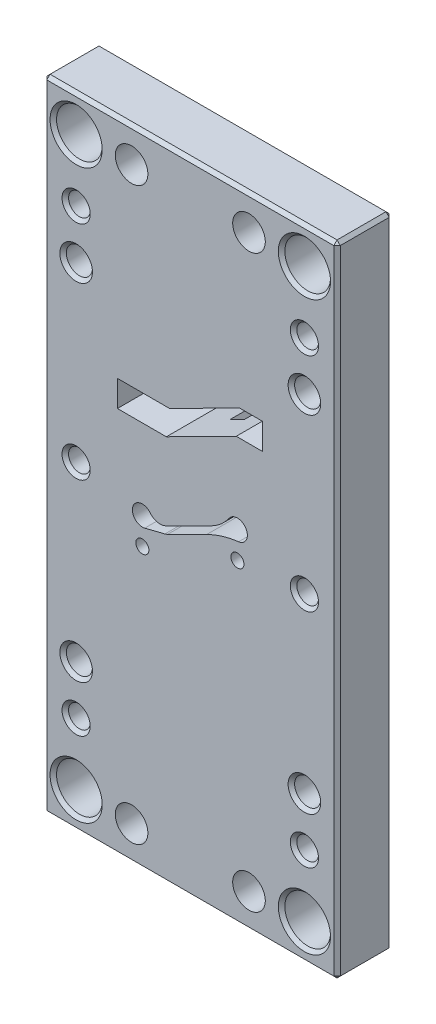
ISO-10303-21;
HEADER;
FILE_DESCRIPTION(('STEP AP214'),'2;1');
FILE_NAME('part.step','',(''),(''),'','','');
FILE_SCHEMA(('AUTOMOTIVE_DESIGN { 1 0 10303 214 1 1 1 1 }'));
ENDSEC;
DATA;
#1=APPLICATION_CONTEXT('core data for automotive mechanical design processes');
#2=APPLICATION_PROTOCOL_DEFINITION('international standard','automotive_design',2000,#1);
#3=PRODUCT_CONTEXT('',#1,'mechanical');
#4=PRODUCT('Part','Part','',(#3));
#5=PRODUCT_RELATED_PRODUCT_CATEGORY('part','',(#4));
#6=PRODUCT_DEFINITION_FORMATION('','',#4);
#7=PRODUCT_DEFINITION_CONTEXT('part definition',#1,'design');
#8=PRODUCT_DEFINITION('design','',#6,#7);
#9=PRODUCT_DEFINITION_SHAPE('','',#8);
#10=(LENGTH_UNIT() NAMED_UNIT(*) SI_UNIT(.MILLI.,.METRE.));
#11=(NAMED_UNIT(*) PLANE_ANGLE_UNIT() SI_UNIT($,.RADIAN.));
#12=(NAMED_UNIT(*) SI_UNIT($,.STERADIAN.) SOLID_ANGLE_UNIT());
#13=UNCERTAINTY_MEASURE_WITH_UNIT(LENGTH_MEASURE(1.E-05),#10,'distance_accuracy_value','');
#14=(GEOMETRIC_REPRESENTATION_CONTEXT(3) GLOBAL_UNCERTAINTY_ASSIGNED_CONTEXT((#13)) GLOBAL_UNIT_ASSIGNED_CONTEXT((#10,
#11,#12)) REPRESENTATION_CONTEXT('',''));
#15=CARTESIAN_POINT('',(0.,0.,0.));
#16=DIRECTION('',(0.,0.,1.));
#17=DIRECTION('',(1.,0.,0.));
#18=AXIS2_PLACEMENT_3D('',#15,#16,#17);
#19=CARTESIAN_POINT('',(0.499999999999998,0.499999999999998,16.));
#20=DIRECTION('',(-0.577350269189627,-0.577350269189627,0.577350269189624));
#21=DIRECTION('',(0.707106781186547,-0.707106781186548,0.));
#22=AXIS2_PLACEMENT_3D('',#19,#20,#21);
#23=PLANE('',#22);
#24=DIRECTION('',(0.707106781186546,0.,0.707106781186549));
#25=VECTOR('',#24,1.);
#26=CARTESIAN_POINT('',(0.499999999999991,0.999999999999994,16.5));
#27=LINE('',#26,#25);
#28=CARTESIAN_POINT('',(0.,0.999999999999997,16.));
#29=VERTEX_POINT('',#28);
#30=CARTESIAN_POINT('',(0.99999999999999,0.999999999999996,17.));
#31=VERTEX_POINT('',#30);
#32=EDGE_CURVE('E870',#29,#31,#27,.T.);
#33=ORIENTED_EDGE('',*,*,#32,.F.);
#34=DIRECTION('',(0.707106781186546,-0.707106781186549,0.));
#35=VECTOR('',#34,1.);
#36=CARTESIAN_POINT('',(0.499999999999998,0.5,16.));
#37=LINE('',#36,#35);
#38=CARTESIAN_POINT('',(0.999999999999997,0.,16.));
#39=VERTEX_POINT('',#38);
#40=EDGE_CURVE('E879',#39,#29,#37,.F.);
#41=ORIENTED_EDGE('',*,*,#40,.F.);
#42=DIRECTION('',(0.,-0.707106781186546,-0.707106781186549));
#43=VECTOR('',#42,1.);
#44=CARTESIAN_POINT('',(1.,0.499999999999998,16.5));
#45=LINE('',#44,#43);
#46=EDGE_CURVE('E868',#31,#39,#45,.T.);
#47=ORIENTED_EDGE('',*,*,#46,.F.);
#48=EDGE_LOOP('',(#33,#41,#47));
#49=FACE_BOUND('',#48,.T.);
#50=ADVANCED_FACE('F17',(#49),#23,.T.);
#51=CARTESIAN_POINT('',(89.5,0.500000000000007,16.));
#52=DIRECTION('',(0.577350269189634,-0.577350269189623,0.577350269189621));
#53=DIRECTION('',(0.707106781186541,0.707106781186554,0.));
#54=AXIS2_PLACEMENT_3D('',#51,#52,#53);
#55=PLANE('',#54);
#56=DIRECTION('',(0.,-0.707106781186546,-0.707106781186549));
#57=VECTOR('',#56,1.);
#58=CARTESIAN_POINT('',(89.,0.499999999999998,16.5));
#59=LINE('',#58,#57);
#60=CARTESIAN_POINT('',(89.,0.,16.));
#61=VERTEX_POINT('',#60);
#62=CARTESIAN_POINT('',(89.,0.999999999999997,17.));
#63=VERTEX_POINT('',#62);
#64=EDGE_CURVE('E866',#61,#63,#59,.F.);
#65=ORIENTED_EDGE('',*,*,#64,.F.);
#66=DIRECTION('',(0.707106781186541,0.707106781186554,0.));
#67=VECTOR('',#66,1.);
#68=CARTESIAN_POINT('',(89.5,0.500000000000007,16.));
#69=LINE('',#68,#67);
#70=CARTESIAN_POINT('',(90.,1.00000000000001,16.));
#71=VERTEX_POINT('',#70);
#72=EDGE_CURVE('E874',#71,#61,#69,.F.);
#73=ORIENTED_EDGE('',*,*,#72,.F.);
#74=DIRECTION('',(0.70710678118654,0.,-0.707106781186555));
#75=VECTOR('',#74,1.);
#76=CARTESIAN_POINT('',(89.5,1.,16.5));
#77=LINE('',#76,#75);
#78=EDGE_CURVE('E864',#63,#71,#77,.T.);
#79=ORIENTED_EDGE('',*,*,#78,.F.);
#80=EDGE_LOOP('',(#65,#73,#79));
#81=FACE_BOUND('',#80,.T.);
#82=ADVANCED_FACE('F1485',(#81),#55,.T.);
#83=CARTESIAN_POINT('',(89.5,195.5,16.));
#84=DIRECTION('',(0.577350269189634,0.577350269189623,0.577350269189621));
#85=DIRECTION('',(-0.707106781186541,0.707106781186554,0.));
#86=AXIS2_PLACEMENT_3D('',#83,#84,#85);
#87=PLANE('',#86);
#88=DIRECTION('',(0.,-0.707106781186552,0.707106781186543));
#89=VECTOR('',#88,1.);
#90=CARTESIAN_POINT('',(89.,195.5,16.5));
#91=LINE('',#90,#89);
#92=CARTESIAN_POINT('',(89.,195.,17.));
#93=VERTEX_POINT('',#92);
#94=CARTESIAN_POINT('',(89.,196.,16.));
#95=VERTEX_POINT('',#94);
#96=EDGE_CURVE('E860',#93,#95,#91,.F.);
#97=ORIENTED_EDGE('',*,*,#96,.F.);
#98=DIRECTION('',(0.70710678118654,0.,-0.707106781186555));
#99=VECTOR('',#98,1.);
#100=CARTESIAN_POINT('',(89.5,195.,16.5));
#101=LINE('',#100,#99);
#102=CARTESIAN_POINT('',(90.,195.,16.));
#103=VERTEX_POINT('',#102);
#104=EDGE_CURVE('E862',#103,#93,#101,.F.);
#105=ORIENTED_EDGE('',*,*,#104,.F.);
#106=DIRECTION('',(-0.707106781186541,0.707106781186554,0.));
#107=VECTOR('',#106,1.);
#108=CARTESIAN_POINT('',(89.5,195.5,16.));
#109=LINE('',#108,#107);
#110=EDGE_CURVE('E889',#95,#103,#109,.F.);
#111=ORIENTED_EDGE('',*,*,#110,.F.);
#112=EDGE_LOOP('',(#97,#105,#111));
#113=FACE_BOUND('',#112,.T.);
#114=ADVANCED_FACE('F1482',(#113),#87,.T.);
#115=CARTESIAN_POINT('',(0.499999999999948,195.5,16.));
#116=DIRECTION('',(-0.57735026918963,0.577350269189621,0.577350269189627));
#117=DIRECTION('',(0.707106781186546,0.,0.707106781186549));
#118=AXIS2_PLACEMENT_3D('',#115,#116,#117);
#119=PLANE('',#118);
#120=DIRECTION('',(0.707106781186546,0.,0.707106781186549));
#121=VECTOR('',#120,1.);
#122=CARTESIAN_POINT('',(0.499999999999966,195.,16.5));
#123=LINE('',#122,#121);
#124=CARTESIAN_POINT('',(0.999999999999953,195.,17.));
#125=VERTEX_POINT('',#124);
#126=CARTESIAN_POINT('',(0.,195.,16.));
#127=VERTEX_POINT('',#126);
#128=EDGE_CURVE('E872',#125,#127,#123,.F.);
#129=ORIENTED_EDGE('',*,*,#128,.F.);
#130=DIRECTION('',(0.,-0.707106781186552,0.707106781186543));
#131=VECTOR('',#130,1.);
#132=CARTESIAN_POINT('',(0.999999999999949,195.5,16.5));
#133=LINE('',#132,#131);
#134=CARTESIAN_POINT('',(0.999999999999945,196.,16.));
#135=VERTEX_POINT('',#134);
#136=EDGE_CURVE('E858',#135,#125,#133,.T.);
#137=ORIENTED_EDGE('',*,*,#136,.F.);
#138=DIRECTION('',(-0.707106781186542,-0.707106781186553,0.));
#139=VECTOR('',#138,1.);
#140=CARTESIAN_POINT('',(0.499999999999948,195.5,16.));
#141=LINE('',#140,#139);
#142=EDGE_CURVE('E884',#127,#135,#141,.F.);
#143=ORIENTED_EDGE('',*,*,#142,.F.);
#144=EDGE_LOOP('',(#129,#137,#143));
#145=FACE_BOUND('',#144,.T.);
#146=ADVANCED_FACE('F1479',(#145),#119,.T.);
#147=CARTESIAN_POINT('',(26.9999999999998,10.5000000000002,9.5));
#148=DIRECTION('',(0.,0.,-1.));
#149=DIRECTION('',(-1.,0.,0.));
#150=AXIS2_PLACEMENT_3D('',#147,#148,#149);
#151=PLANE('',#150);
#152=CARTESIAN_POINT('',(26.9999999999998,10.5000000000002,9.5));
#153=DIRECTION('',(0.,0.,-1.));
#154=DIRECTION('',(-1.,0.,0.));
#155=AXIS2_PLACEMENT_3D('',#152,#153,#154);
#156=CIRCLE('',#155,5.);
#157=CARTESIAN_POINT('',(21.9999999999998,10.5000000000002,9.5));
#158=VERTEX_POINT('',#157);
#159=EDGE_CURVE('E20',#158,#158,#156,.F.);
#160=ORIENTED_EDGE('',*,*,#159,.T.);
#161=EDGE_LOOP('',(#160));
#162=FACE_BOUND('',#161,.T.);
#163=ADVANCED_FACE('F1051',(#162),#151,.F.);
#164=CARTESIAN_POINT('',(26.9999999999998,185.5,9.5));
#165=DIRECTION('',(0.,0.,-1.));
#166=DIRECTION('',(-1.,0.,0.));
#167=AXIS2_PLACEMENT_3D('',#164,#165,#166);
#168=PLANE('',#167);
#169=CARTESIAN_POINT('',(26.9999999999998,185.5,9.5));
#170=DIRECTION('',(0.,0.,-1.));
#171=DIRECTION('',(-1.,0.,0.));
#172=AXIS2_PLACEMENT_3D('',#169,#170,#171);
#173=CIRCLE('',#172,5.);
#174=CARTESIAN_POINT('',(21.9999999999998,185.5,9.5));
#175=VERTEX_POINT('',#174);
#176=EDGE_CURVE('E1044',#175,#175,#173,.F.);
#177=ORIENTED_EDGE('',*,*,#176,.T.);
#178=EDGE_LOOP('',(#177));
#179=FACE_BOUND('',#178,.T.);
#180=ADVANCED_FACE('F1465',(#179),#168,.F.);
#181=CARTESIAN_POINT('',(62.9999999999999,185.5,9.5));
#182=DIRECTION('',(0.,0.,-1.));
#183=DIRECTION('',(-1.,0.,0.));
#184=AXIS2_PLACEMENT_3D('',#181,#182,#183);
#185=PLANE('',#184);
#186=CARTESIAN_POINT('',(62.9999999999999,185.5,9.5));
#187=DIRECTION('',(0.,0.,-1.));
#188=DIRECTION('',(-1.,0.,0.));
#189=AXIS2_PLACEMENT_3D('',#186,#187,#188);
#190=CIRCLE('',#189,5.);
#191=CARTESIAN_POINT('',(57.9999999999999,185.5,9.5));
#192=VERTEX_POINT('',#191);
#193=EDGE_CURVE('E1042',#192,#192,#190,.F.);
#194=ORIENTED_EDGE('',*,*,#193,.T.);
#195=EDGE_LOOP('',(#194));
#196=FACE_BOUND('',#195,.T.);
#197=ADVANCED_FACE('F1462',(#196),#185,.F.);
#198=CARTESIAN_POINT('',(62.9999999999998,10.5000000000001,9.5));
#199=DIRECTION('',(0.,0.,-1.));
#200=DIRECTION('',(-1.,0.,0.));
#201=AXIS2_PLACEMENT_3D('',#198,#199,#200);
#202=PLANE('',#201);
#203=CARTESIAN_POINT('',(62.9999999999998,10.5000000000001,9.5));
#204=DIRECTION('',(0.,0.,-1.));
#205=DIRECTION('',(-1.,0.,0.));
#206=AXIS2_PLACEMENT_3D('',#203,#204,#205);
#207=CIRCLE('',#206,5.);
#208=CARTESIAN_POINT('',(57.9999999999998,10.5000000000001,9.5));
#209=VERTEX_POINT('',#208);
#210=EDGE_CURVE('E855',#209,#209,#207,.F.);
#211=ORIENTED_EDGE('',*,*,#210,.T.);
#212=EDGE_LOOP('',(#211));
#213=FACE_BOUND('',#212,.T.);
#214=ADVANCED_FACE('F1464',(#213),#202,.F.);
#215=CARTESIAN_POINT('',(89.5,195.5,0.));
#216=DIRECTION('',(0.707106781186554,0.707106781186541,0.));
#217=DIRECTION('',(-0.707106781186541,0.707106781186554,0.));
#218=AXIS2_PLACEMENT_3D('',#215,#216,#217);
#219=PLANE('',#218);
#220=DIRECTION('',(-0.707106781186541,0.707106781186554,0.));
#221=VECTOR('',#220,1.);
#222=CARTESIAN_POINT('',(89.5,195.5,1.));
#223=LINE('',#222,#221);
#224=CARTESIAN_POINT('',(90.,195.,1.));
#225=VERTEX_POINT('',#224);
#226=CARTESIAN_POINT('',(89.,196.,0.999999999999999));
#227=VERTEX_POINT('',#226);
#228=EDGE_CURVE('E886',#225,#227,#223,.T.);
#229=ORIENTED_EDGE('',*,*,#228,.T.);
#230=DIRECTION('',(0.,0.,1.));
#231=VECTOR('',#230,1.);
#232=CARTESIAN_POINT('',(89.,196.,0.));
#233=LINE('',#232,#231);
#234=EDGE_CURVE('E834',#95,#227,#233,.F.);
#235=ORIENTED_EDGE('',*,*,#234,.F.);
#236=ORIENTED_EDGE('',*,*,#110,.T.);
#237=DIRECTION('',(0.,0.,-1.));
#238=VECTOR('',#237,1.);
#239=CARTESIAN_POINT('',(90.,195.,0.));
#240=LINE('',#239,#238);
#241=EDGE_CURVE('E846',#225,#103,#240,.F.);
#242=ORIENTED_EDGE('',*,*,#241,.F.);
#243=EDGE_LOOP('',(#229,#235,#236,#242));
#244=FACE_BOUND('',#243,.T.);
#245=ADVANCED_FACE('F1471',(#244),#219,.T.);
#246=CARTESIAN_POINT('',(0.499999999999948,195.5,0.));
#247=DIRECTION('',(-0.707106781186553,0.707106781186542,0.));
#248=DIRECTION('',(-0.707106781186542,-0.707106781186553,0.));
#249=AXIS2_PLACEMENT_3D('',#246,#247,#248);
#250=PLANE('',#249);
#251=DIRECTION('',(-0.707106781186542,-0.707106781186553,0.));
#252=VECTOR('',#251,1.);
#253=CARTESIAN_POINT('',(0.499999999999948,195.5,1.));
#254=LINE('',#253,#252);
#255=CARTESIAN_POINT('',(0.999999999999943,196.,0.999999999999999));
#256=VERTEX_POINT('',#255);
#257=CARTESIAN_POINT('',(0.,195.,0.999999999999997));
#258=VERTEX_POINT('',#257);
#259=EDGE_CURVE('E881',#256,#258,#254,.T.);
#260=ORIENTED_EDGE('',*,*,#259,.T.);
#261=DIRECTION('',(0.,0.,1.));
#262=VECTOR('',#261,1.);
#263=CARTESIAN_POINT('',(0.,195.,0.));
#264=LINE('',#263,#262);
#265=EDGE_CURVE('E828',#127,#258,#264,.F.);
#266=ORIENTED_EDGE('',*,*,#265,.F.);
#267=ORIENTED_EDGE('',*,*,#142,.T.);
#268=DIRECTION('',(0.,0.,1.));
#269=VECTOR('',#268,1.);
#270=CARTESIAN_POINT('',(0.999999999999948,196.,0.));
#271=LINE('',#270,#269);
#272=EDGE_CURVE('E840',#256,#135,#271,.T.);
#273=ORIENTED_EDGE('',*,*,#272,.F.);
#274=EDGE_LOOP('',(#260,#266,#267,#273));
#275=FACE_BOUND('',#274,.T.);
#276=ADVANCED_FACE('F1559',(#275),#250,.T.);
#277=CARTESIAN_POINT('',(0.499999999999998,0.5,0.));
#278=DIRECTION('',(-0.707106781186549,-0.707106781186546,0.));
#279=DIRECTION('',(0.707106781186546,-0.707106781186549,0.));
#280=AXIS2_PLACEMENT_3D('',#277,#278,#279);
#281=PLANE('',#280);
#282=DIRECTION('',(0.707106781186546,-0.707106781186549,0.));
#283=VECTOR('',#282,1.);
#284=CARTESIAN_POINT('',(0.499999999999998,0.5,1.));
#285=LINE('',#284,#283);
#286=CARTESIAN_POINT('',(0.,0.999999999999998,1.));
#287=VERTEX_POINT('',#286);
#288=CARTESIAN_POINT('',(0.999999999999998,0.,1.));
#289=VERTEX_POINT('',#288);
#290=EDGE_CURVE('E876',#287,#289,#285,.T.);
#291=ORIENTED_EDGE('',*,*,#290,.T.);
#292=DIRECTION('',(0.,0.,-1.));
#293=VECTOR('',#292,1.);
#294=CARTESIAN_POINT('',(1.,0.,0.));
#295=LINE('',#294,#293);
#296=EDGE_CURVE('E819',#39,#289,#295,.T.);
#297=ORIENTED_EDGE('',*,*,#296,.F.);
#298=ORIENTED_EDGE('',*,*,#40,.T.);
#299=DIRECTION('',(0.,0.,1.));
#300=VECTOR('',#299,1.);
#301=CARTESIAN_POINT('',(0.,1.,0.));
#302=LINE('',#301,#300);
#303=EDGE_CURVE('E825',#287,#29,#302,.T.);
#304=ORIENTED_EDGE('',*,*,#303,.F.);
#305=EDGE_LOOP('',(#291,#297,#298,#304));
#306=FACE_BOUND('',#305,.T.);
#307=ADVANCED_FACE('F1507',(#306),#281,.T.);
#308=CARTESIAN_POINT('',(89.5,0.500000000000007,0.));
#309=DIRECTION('',(0.707106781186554,-0.707106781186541,0.));
#310=DIRECTION('',(0.707106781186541,0.707106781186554,0.));
#311=AXIS2_PLACEMENT_3D('',#308,#309,#310);
#312=PLANE('',#311);
#313=DIRECTION('',(0.707106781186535,0.70710678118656,0.));
#314=VECTOR('',#313,1.);
#315=CARTESIAN_POINT('',(89.5,0.500000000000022,1.00000000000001));
#316=LINE('',#315,#314);
#317=CARTESIAN_POINT('',(90.,1.00000000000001,0.999999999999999));
#318=VERTEX_POINT('',#317);
#319=CARTESIAN_POINT('',(89.,0.,1.));
#320=VERTEX_POINT('',#319);
#321=EDGE_CURVE('E822',#318,#320,#316,.F.);
#322=ORIENTED_EDGE('',*,*,#321,.F.);
#323=DIRECTION('',(0.,0.,-1.));
#324=VECTOR('',#323,1.);
#325=CARTESIAN_POINT('',(90.,1.,0.));
#326=LINE('',#325,#324);
#327=EDGE_CURVE('E849',#71,#318,#326,.T.);
#328=ORIENTED_EDGE('',*,*,#327,.F.);
#329=ORIENTED_EDGE('',*,*,#72,.T.);
#330=DIRECTION('',(0.,0.,-1.));
#331=VECTOR('',#330,1.);
#332=CARTESIAN_POINT('',(89.,0.,0.));
#333=LINE('',#332,#331);
#334=EDGE_CURVE('E816',#320,#61,#333,.F.);
#335=ORIENTED_EDGE('',*,*,#334,.F.);
#336=EDGE_LOOP('',(#322,#328,#329,#335));
#337=FACE_BOUND('',#336,.T.);
#338=ADVANCED_FACE('F1548',(#337),#312,.T.);
#339=CARTESIAN_POINT('',(0.499999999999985,49.,16.5));
#340=DIRECTION('',(-0.707106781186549,0.,0.707106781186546));
#341=DIRECTION('',(0.707106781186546,0.,0.707106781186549));
#342=AXIS2_PLACEMENT_3D('',#339,#340,#341);
#343=PLANE('',#342);
#344=ORIENTED_EDGE('',*,*,#32,.T.);
#345=DIRECTION('',(0.,1.,0.));
#346=VECTOR('',#345,1.);
#347=CARTESIAN_POINT('',(0.999999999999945,98.,17.));
#348=LINE('',#347,#346);
#349=EDGE_CURVE('E287',#125,#31,#348,.F.);
#350=ORIENTED_EDGE('',*,*,#349,.F.);
#351=ORIENTED_EDGE('',*,*,#128,.T.);
#352=DIRECTION('',(0.,1.,0.));
#353=VECTOR('',#352,1.);
#354=CARTESIAN_POINT('',(0.,0.,16.));
#355=LINE('',#354,#353);
#356=EDGE_CURVE('E831',#29,#127,#355,.T.);
#357=ORIENTED_EDGE('',*,*,#356,.F.);
#358=EDGE_LOOP('',(#344,#350,#351,#357));
#359=FACE_BOUND('',#358,.T.);
#360=ADVANCED_FACE('F1573',(#359),#343,.T.);
#361=CARTESIAN_POINT('',(67.5,0.499999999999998,16.5));
#362=DIRECTION('',(0.,-0.707106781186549,0.707106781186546));
#363=DIRECTION('',(0.,-0.707106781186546,-0.707106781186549));
#364=AXIS2_PLACEMENT_3D('',#361,#362,#363);
#365=PLANE('',#364);
#366=ORIENTED_EDGE('',*,*,#64,.T.);
#367=DIRECTION('',(1.,0.,0.));
#368=VECTOR('',#367,1.);
#369=CARTESIAN_POINT('',(45.,1.,17.));
#370=LINE('',#369,#368);
#371=EDGE_CURVE('E754',#31,#63,#370,.T.);
#372=ORIENTED_EDGE('',*,*,#371,.F.);
#373=ORIENTED_EDGE('',*,*,#46,.T.);
#374=DIRECTION('',(1.,0.,0.));
#375=VECTOR('',#374,1.);
#376=CARTESIAN_POINT('',(90.,0.,16.));
#377=LINE('',#376,#375);
#378=EDGE_CURVE('E288',#61,#39,#377,.F.);
#379=ORIENTED_EDGE('',*,*,#378,.F.);
#380=EDGE_LOOP('',(#366,#372,#373,#379));
#381=FACE_BOUND('',#380,.T.);
#382=ADVANCED_FACE('F1500',(#381),#365,.T.);
#383=CARTESIAN_POINT('',(89.5,147.,16.5));
#384=DIRECTION('',(0.707106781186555,0.,0.70710678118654));
#385=DIRECTION('',(0.70710678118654,0.,-0.707106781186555));
#386=AXIS2_PLACEMENT_3D('',#383,#384,#385);
#387=PLANE('',#386);
#388=ORIENTED_EDGE('',*,*,#104,.T.);
#389=DIRECTION('',(0.,1.,0.));
#390=VECTOR('',#389,1.);
#391=CARTESIAN_POINT('',(89.,98.,17.));
#392=LINE('',#391,#390);
#393=EDGE_CURVE('E751',#63,#93,#392,.T.);
#394=ORIENTED_EDGE('',*,*,#393,.F.);
#395=ORIENTED_EDGE('',*,*,#78,.T.);
#396=DIRECTION('',(0.,1.,0.));
#397=VECTOR('',#396,1.);
#398=CARTESIAN_POINT('',(90.,196.,16.));
#399=LINE('',#398,#397);
#400=EDGE_CURVE('E843',#103,#71,#399,.F.);
#401=ORIENTED_EDGE('',*,*,#400,.F.);
#402=EDGE_LOOP('',(#388,#394,#395,#401));
#403=FACE_BOUND('',#402,.T.);
#404=ADVANCED_FACE('F1570',(#403),#387,.T.);
#405=CARTESIAN_POINT('',(22.5,195.5,16.5));
#406=DIRECTION('',(0.,0.707106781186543,0.707106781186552));
#407=DIRECTION('',(0.,-0.707106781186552,0.707106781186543));
#408=AXIS2_PLACEMENT_3D('',#405,#406,#407);
#409=PLANE('',#408);
#410=ORIENTED_EDGE('',*,*,#136,.T.);
#411=DIRECTION('',(1.,0.,0.));
#412=VECTOR('',#411,1.);
#413=CARTESIAN_POINT('',(45.,195.,17.));
#414=LINE('',#413,#412);
#415=EDGE_CURVE('E748',#93,#125,#414,.F.);
#416=ORIENTED_EDGE('',*,*,#415,.F.);
#417=ORIENTED_EDGE('',*,*,#96,.T.);
#418=DIRECTION('',(1.,0.,0.));
#419=VECTOR('',#418,1.);
#420=CARTESIAN_POINT('',(0.,196.,16.));
#421=LINE('',#420,#419);
#422=EDGE_CURVE('E837',#135,#95,#421,.T.);
#423=ORIENTED_EDGE('',*,*,#422,.F.);
#424=EDGE_LOOP('',(#410,#416,#417,#423));
#425=FACE_BOUND('',#424,.T.);
#426=ADVANCED_FACE('F1067',(#425),#409,.T.);
#427=CARTESIAN_POINT('',(30.3022175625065,85.7648730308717,17.));
#428=DIRECTION('',(0.,0.,-1.));
#429=DIRECTION('',(-1.,0.,0.));
#430=AXIS2_PLACEMENT_3D('',#427,#428,#429);
#431=CYLINDRICAL_SURFACE('',#430,2.00499999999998);
#432=CARTESIAN_POINT('',(30.3022175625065,85.7648730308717,3.50000000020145));
#433=DIRECTION('',(0.,0.,-1.));
#434=DIRECTION('',(1.,0.,0.));
#435=AXIS2_PLACEMENT_3D('',#432,#433,#434);
#436=CIRCLE('',#435,2.00500000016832);
#437=CARTESIAN_POINT('',(32.3072175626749,85.7648730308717,3.50000000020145));
#438=VERTEX_POINT('',#437);
#439=EDGE_CURVE('E852',#438,#438,#436,.T.);
#440=ORIENTED_EDGE('',*,*,#439,.T.);
#441=EDGE_LOOP('',(#440));
#442=FACE_BOUND('',#441,.T.);
#443=CARTESIAN_POINT('',(30.3022175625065,85.7648730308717,17.));
#444=DIRECTION('',(0.,0.,-1.));
#445=DIRECTION('',(-1.,0.,0.));
#446=AXIS2_PLACEMENT_3D('',#443,#444,#445);
#447=CIRCLE('',#446,2.00499999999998);
#448=CARTESIAN_POINT('',(28.2972175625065,85.7648730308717,17.));
#449=VERTEX_POINT('',#448);
#450=EDGE_CURVE('E1036',#449,#449,#447,.T.);
#451=ORIENTED_EDGE('',*,*,#450,.F.);
#452=EDGE_LOOP('',(#451));
#453=FACE_BOUND('',#452,.T.);
#454=ADVANCED_FACE('F1056',(#442,#453),#431,.F.);
#455=CARTESIAN_POINT('',(26.9999999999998,10.5000000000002,17.));
#456=DIRECTION('',(0.,0.,-1.));
#457=DIRECTION('',(-1.,0.,0.));
#458=AXIS2_PLACEMENT_3D('',#455,#456,#457);
#459=CYLINDRICAL_SURFACE('',#458,5.);
#460=CARTESIAN_POINT('',(26.9999999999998,10.5000000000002,17.));
#461=DIRECTION('',(0.,0.,-1.));
#462=DIRECTION('',(-1.,0.,0.));
#463=AXIS2_PLACEMENT_3D('',#460,#461,#462);
#464=CIRCLE('',#463,5.);
#465=CARTESIAN_POINT('',(21.9999999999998,10.5000000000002,17.));
#466=VERTEX_POINT('',#465);
#467=EDGE_CURVE('E1030',#466,#466,#464,.T.);
#468=ORIENTED_EDGE('',*,*,#467,.F.);
#469=EDGE_LOOP('',(#468));
#470=FACE_BOUND('',#469,.T.);
#471=ORIENTED_EDGE('',*,*,#159,.F.);
#472=EDGE_LOOP('',(#471));
#473=FACE_BOUND('',#472,.T.);
#474=ADVANCED_FACE('F1053',(#470,#473),#459,.F.);
#475=CARTESIAN_POINT('',(26.9999999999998,185.5,17.));
#476=DIRECTION('',(0.,0.,-1.));
#477=DIRECTION('',(-1.,0.,0.));
#478=AXIS2_PLACEMENT_3D('',#475,#476,#477);
#479=CYLINDRICAL_SURFACE('',#478,5.);
#480=CARTESIAN_POINT('',(26.9999999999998,185.5,17.));
#481=DIRECTION('',(0.,0.,-1.));
#482=DIRECTION('',(-1.,0.,0.));
#483=AXIS2_PLACEMENT_3D('',#480,#481,#482);
#484=CIRCLE('',#483,5.);
#485=CARTESIAN_POINT('',(21.9999999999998,185.5,17.));
#486=VERTEX_POINT('',#485);
#487=EDGE_CURVE('E1027',#486,#486,#484,.T.);
#488=ORIENTED_EDGE('',*,*,#487,.F.);
#489=EDGE_LOOP('',(#488));
#490=FACE_BOUND('',#489,.T.);
#491=ORIENTED_EDGE('',*,*,#176,.F.);
#492=EDGE_LOOP('',(#491));
#493=FACE_BOUND('',#492,.T.);
#494=ADVANCED_FACE('F1055',(#490,#493),#479,.F.);
#495=CARTESIAN_POINT('',(62.9999999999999,185.5,17.));
#496=DIRECTION('',(0.,0.,-1.));
#497=DIRECTION('',(-1.,0.,0.));
#498=AXIS2_PLACEMENT_3D('',#495,#496,#497);
#499=CYLINDRICAL_SURFACE('',#498,5.);
#500=CARTESIAN_POINT('',(62.9999999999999,185.5,17.));
#501=DIRECTION('',(0.,0.,-1.));
#502=DIRECTION('',(-1.,0.,0.));
#503=AXIS2_PLACEMENT_3D('',#500,#501,#502);
#504=CIRCLE('',#503,5.);
#505=CARTESIAN_POINT('',(57.9999999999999,185.5,17.));
#506=VERTEX_POINT('',#505);
#507=EDGE_CURVE('E1024',#506,#506,#504,.T.);
#508=ORIENTED_EDGE('',*,*,#507,.F.);
#509=EDGE_LOOP('',(#508));
#510=FACE_BOUND('',#509,.T.);
#511=ORIENTED_EDGE('',*,*,#193,.F.);
#512=EDGE_LOOP('',(#511));
#513=FACE_BOUND('',#512,.T.);
#514=ADVANCED_FACE('F1064',(#510,#513),#499,.F.);
#515=CARTESIAN_POINT('',(62.9999999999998,10.5000000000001,17.));
#516=DIRECTION('',(0.,0.,-1.));
#517=DIRECTION('',(-1.,0.,0.));
#518=AXIS2_PLACEMENT_3D('',#515,#516,#517);
#519=CYLINDRICAL_SURFACE('',#518,5.);
#520=CARTESIAN_POINT('',(62.9999999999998,10.5000000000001,17.));
#521=DIRECTION('',(0.,0.,-1.));
#522=DIRECTION('',(-1.,0.,0.));
#523=AXIS2_PLACEMENT_3D('',#520,#521,#522);
#524=CIRCLE('',#523,5.);
#525=CARTESIAN_POINT('',(57.9999999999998,10.5000000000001,17.));
#526=VERTEX_POINT('',#525);
#527=EDGE_CURVE('E1021',#526,#526,#524,.T.);
#528=ORIENTED_EDGE('',*,*,#527,.F.);
#529=EDGE_LOOP('',(#528));
#530=FACE_BOUND('',#529,.T.);
#531=ORIENTED_EDGE('',*,*,#210,.F.);
#532=EDGE_LOOP('',(#531));
#533=FACE_BOUND('',#532,.T.);
#534=ADVANCED_FACE('F1449',(#530,#533),#519,.F.);
#535=CARTESIAN_POINT('',(59.4500000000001,96.6100000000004,17.));
#536=DIRECTION('',(0.,0.,-1.));
#537=DIRECTION('',(-1.,0.,0.));
#538=AXIS2_PLACEMENT_3D('',#535,#536,#537);
#539=CYLINDRICAL_SURFACE('',#538,2.00499999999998);
#540=CARTESIAN_POINT('',(59.4500000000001,96.6100000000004,17.));
#541=DIRECTION('',(0.,0.,-1.));
#542=DIRECTION('',(-1.,0.,0.));
#543=AXIS2_PLACEMENT_3D('',#540,#541,#542);
#544=CIRCLE('',#543,2.00499999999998);
#545=CARTESIAN_POINT('',(57.4450000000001,96.6100000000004,17.));
#546=VERTEX_POINT('',#545);
#547=EDGE_CURVE('E1033',#546,#546,#544,.T.);
#548=ORIENTED_EDGE('',*,*,#547,.F.);
#549=EDGE_LOOP('',(#548));
#550=FACE_BOUND('',#549,.T.);
#551=CARTESIAN_POINT('',(59.4500000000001,96.6100000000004,3.1));
#552=DIRECTION('',(0.,0.,-1.));
#553=DIRECTION('',(-1.,0.,0.));
#554=AXIS2_PLACEMENT_3D('',#551,#552,#553);
#555=CIRCLE('',#554,2.00499999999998);
#556=CARTESIAN_POINT('',(57.4450000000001,96.6100000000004,3.1));
#557=VERTEX_POINT('',#556);
#558=EDGE_CURVE('E976',#557,#557,#555,.T.);
#559=ORIENTED_EDGE('',*,*,#558,.T.);
#560=EDGE_LOOP('',(#559));
#561=FACE_BOUND('',#560,.T.);
#562=ADVANCED_FACE('F1445',(#550,#561),#539,.F.);
#563=CARTESIAN_POINT('',(30.3022175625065,85.7648730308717,3.09999999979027));
#564=DIRECTION('',(0.,0.,-1.));
#565=DIRECTION('',(0.,1.,0.));
#566=AXIS2_PLACEMENT_3D('',#563,#564,#565);
#567=CONICAL_SURFACE('',#566,2.40499999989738,0.785398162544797);
#568=ORIENTED_EDGE('',*,*,#439,.F.);
#569=EDGE_LOOP('',(#568));
#570=FACE_BOUND('',#569,.T.);
#571=CARTESIAN_POINT('',(30.3022175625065,85.7648730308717,3.09999999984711));
#572=DIRECTION('',(0.,0.,-1.));
#573=DIRECTION('',(0.,1.,0.));
#574=AXIS2_PLACEMENT_3D('',#571,#572,#573);
#575=CIRCLE('',#574,2.40499999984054);
#576=CARTESIAN_POINT('',(30.3022175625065,88.1698730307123,3.09999999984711));
#577=VERTEX_POINT('',#576);
#578=EDGE_CURVE('E727',#577,#577,#575,.T.);
#579=ORIENTED_EDGE('',*,*,#578,.T.);
#580=EDGE_LOOP('',(#579));
#581=FACE_BOUND('',#580,.T.);
#582=ADVANCED_FACE('F1441',(#570,#581),#567,.F.);
#583=CARTESIAN_POINT('',(10.,166.,17.0000000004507));
#584=DIRECTION('',(0.,0.,1.));
#585=DIRECTION('',(1.,0.,0.));
#586=AXIS2_PLACEMENT_3D('',#583,#584,#585);
#587=CONICAL_SURFACE('',#586,4.3234999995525,0.785398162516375);
#588=CARTESIAN_POINT('',(10.,166.,17.0000000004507));
#589=DIRECTION('',(0.,0.,1.));
#590=DIRECTION('',(1.,0.,0.));
#591=AXIS2_PLACEMENT_3D('',#588,#589,#590);
#592=CIRCLE('',#591,4.3234999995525);
#593=CARTESIAN_POINT('',(14.3234999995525,166.,17.0000000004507));
#594=VERTEX_POINT('',#593);
#595=EDGE_CURVE('E1012',#594,#594,#592,.F.);
#596=ORIENTED_EDGE('',*,*,#595,.F.);
#597=EDGE_LOOP('',(#596));
#598=FACE_BOUND('',#597,.T.);
#599=CARTESIAN_POINT('',(10.,166.,16.));
#600=DIRECTION('',(0.,0.,-1.));
#601=DIRECTION('',(-1.,0.,0.));
#602=AXIS2_PLACEMENT_3D('',#599,#600,#601);
#603=CIRCLE('',#602,3.3235);
#604=CARTESIAN_POINT('',(6.6765,166.,16.));
#605=VERTEX_POINT('',#604);
#606=EDGE_CURVE('E722',#605,#605,#603,.T.);
#607=ORIENTED_EDGE('',*,*,#606,.T.);
#608=EDGE_LOOP('',(#607));
#609=FACE_BOUND('',#608,.T.);
#610=ADVANCED_FACE('F1437',(#598,#609),#587,.F.);
#611=CARTESIAN_POINT('',(10.,30.,17.0000000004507));
#612=DIRECTION('',(0.,0.,1.));
#613=DIRECTION('',(1.,0.,0.));
#614=AXIS2_PLACEMENT_3D('',#611,#612,#613);
#615=CONICAL_SURFACE('',#614,4.3234999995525,0.785398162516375);
#616=CARTESIAN_POINT('',(10.,30.,17.0000000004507));
#617=DIRECTION('',(0.,0.,1.));
#618=DIRECTION('',(1.,0.,0.));
#619=AXIS2_PLACEMENT_3D('',#616,#617,#618);
#620=CIRCLE('',#619,4.3234999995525);
#621=CARTESIAN_POINT('',(14.3234999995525,30.,17.0000000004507));
#622=VERTEX_POINT('',#621);
#623=EDGE_CURVE('E1009',#622,#622,#620,.F.);
#624=ORIENTED_EDGE('',*,*,#623,.F.);
#625=EDGE_LOOP('',(#624));
#626=FACE_BOUND('',#625,.T.);
#627=CARTESIAN_POINT('',(10.,30.,16.));
#628=DIRECTION('',(0.,0.,-1.));
#629=DIRECTION('',(-1.,0.,0.));
#630=AXIS2_PLACEMENT_3D('',#627,#628,#629);
#631=CIRCLE('',#630,3.3235);
#632=CARTESIAN_POINT('',(6.6765,30.,16.));
#633=VERTEX_POINT('',#632);
#634=EDGE_CURVE('E717',#633,#633,#631,.T.);
#635=ORIENTED_EDGE('',*,*,#634,.T.);
#636=EDGE_LOOP('',(#635));
#637=FACE_BOUND('',#636,.T.);
#638=ADVANCED_FACE('F1433',(#626,#637),#615,.F.);
#639=CARTESIAN_POINT('',(10.,98.,17.0000000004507));
#640=DIRECTION('',(0.,0.,1.));
#641=DIRECTION('',(1.,0.,0.));
#642=AXIS2_PLACEMENT_3D('',#639,#640,#641);
#643=CONICAL_SURFACE('',#642,4.3234999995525,0.785398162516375);
#644=CARTESIAN_POINT('',(10.,98.,17.0000000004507));
#645=DIRECTION('',(0.,0.,1.));
#646=DIRECTION('',(1.,0.,0.));
#647=AXIS2_PLACEMENT_3D('',#644,#645,#646);
#648=CIRCLE('',#647,4.3234999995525);
#649=CARTESIAN_POINT('',(14.3234999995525,98.,17.0000000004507));
#650=VERTEX_POINT('',#649);
#651=EDGE_CURVE('E1006',#650,#650,#648,.F.);
#652=ORIENTED_EDGE('',*,*,#651,.F.);
#653=EDGE_LOOP('',(#652));
#654=FACE_BOUND('',#653,.T.);
#655=CARTESIAN_POINT('',(10.,98.,16.));
#656=DIRECTION('',(0.,0.,-1.));
#657=DIRECTION('',(-1.,0.,0.));
#658=AXIS2_PLACEMENT_3D('',#655,#656,#657);
#659=CIRCLE('',#658,3.3235);
#660=CARTESIAN_POINT('',(6.6765,98.,16.));
#661=VERTEX_POINT('',#660);
#662=EDGE_CURVE('E712',#661,#661,#659,.T.);
#663=ORIENTED_EDGE('',*,*,#662,.T.);
#664=EDGE_LOOP('',(#663));
#665=FACE_BOUND('',#664,.T.);
#666=ADVANCED_FACE('F1429',(#654,#665),#643,.F.);
#667=CARTESIAN_POINT('',(80.,166.,17.0000000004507));
#668=DIRECTION('',(0.,0.,1.));
#669=DIRECTION('',(1.,0.,0.));
#670=AXIS2_PLACEMENT_3D('',#667,#668,#669);
#671=CONICAL_SURFACE('',#670,4.32349999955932,0.785398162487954);
#672=CARTESIAN_POINT('',(80.,166.,17.0000000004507));
#673=DIRECTION('',(0.,0.,1.));
#674=DIRECTION('',(1.,0.,0.));
#675=AXIS2_PLACEMENT_3D('',#672,#673,#674);
#676=CIRCLE('',#675,4.32349999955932);
#677=CARTESIAN_POINT('',(84.3234999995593,166.,17.0000000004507));
#678=VERTEX_POINT('',#677);
#679=EDGE_CURVE('E1003',#678,#678,#676,.F.);
#680=ORIENTED_EDGE('',*,*,#679,.F.);
#681=EDGE_LOOP('',(#680));
#682=FACE_BOUND('',#681,.T.);
#683=CARTESIAN_POINT('',(80.,166.,16.));
#684=DIRECTION('',(0.,0.,-1.));
#685=DIRECTION('',(-1.,0.,0.));
#686=AXIS2_PLACEMENT_3D('',#683,#684,#685);
#687=CIRCLE('',#686,3.3235);
#688=CARTESIAN_POINT('',(76.6765,166.,16.));
#689=VERTEX_POINT('',#688);
#690=EDGE_CURVE('E707',#689,#689,#687,.T.);
#691=ORIENTED_EDGE('',*,*,#690,.T.);
#692=EDGE_LOOP('',(#691));
#693=FACE_BOUND('',#692,.T.);
#694=ADVANCED_FACE('F1425',(#682,#693),#671,.F.);
#695=CARTESIAN_POINT('',(80.,30.,17.0000000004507));
#696=DIRECTION('',(0.,0.,1.));
#697=DIRECTION('',(1.,0.,0.));
#698=AXIS2_PLACEMENT_3D('',#695,#696,#697);
#699=CONICAL_SURFACE('',#698,4.32349999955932,0.785398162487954);
#700=CARTESIAN_POINT('',(80.,30.,17.0000000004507));
#701=DIRECTION('',(0.,0.,1.));
#702=DIRECTION('',(1.,0.,0.));
#703=AXIS2_PLACEMENT_3D('',#700,#701,#702);
#704=CIRCLE('',#703,4.32349999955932);
#705=CARTESIAN_POINT('',(84.3234999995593,30.,17.0000000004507));
#706=VERTEX_POINT('',#705);
#707=EDGE_CURVE('E1000',#706,#706,#704,.F.);
#708=ORIENTED_EDGE('',*,*,#707,.F.);
#709=EDGE_LOOP('',(#708));
#710=FACE_BOUND('',#709,.T.);
#711=CARTESIAN_POINT('',(80.,30.,16.));
#712=DIRECTION('',(0.,0.,-1.));
#713=DIRECTION('',(-1.,0.,0.));
#714=AXIS2_PLACEMENT_3D('',#711,#712,#713);
#715=CIRCLE('',#714,3.3235);
#716=CARTESIAN_POINT('',(76.6765,30.,16.));
#717=VERTEX_POINT('',#716);
#718=EDGE_CURVE('E702',#717,#717,#715,.T.);
#719=ORIENTED_EDGE('',*,*,#718,.T.);
#720=EDGE_LOOP('',(#719));
#721=FACE_BOUND('',#720,.T.);
#722=ADVANCED_FACE('F1421',(#710,#721),#699,.F.);
#723=CARTESIAN_POINT('',(10.,45.,17.0000000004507));
#724=DIRECTION('',(0.,0.,1.));
#725=DIRECTION('',(1.,0.,0.));
#726=AXIS2_PLACEMENT_3D('',#723,#724,#725);
#727=CONICAL_SURFACE('',#726,4.9999999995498,0.785398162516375);
#728=CARTESIAN_POINT('',(10.,45.,17.0000000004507));
#729=DIRECTION('',(0.,0.,1.));
#730=DIRECTION('',(1.,0.,0.));
#731=AXIS2_PLACEMENT_3D('',#728,#729,#730);
#732=CIRCLE('',#731,4.9999999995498);
#733=CARTESIAN_POINT('',(14.9999999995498,45.,17.0000000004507));
#734=VERTEX_POINT('',#733);
#735=EDGE_CURVE('E982',#734,#734,#732,.F.);
#736=ORIENTED_EDGE('',*,*,#735,.F.);
#737=EDGE_LOOP('',(#736));
#738=FACE_BOUND('',#737,.T.);
#739=CARTESIAN_POINT('',(10.,45.,16.));
#740=DIRECTION('',(0.,0.,-1.));
#741=DIRECTION('',(-1.,0.,0.));
#742=AXIS2_PLACEMENT_3D('',#739,#740,#741);
#743=CIRCLE('',#742,4.);
#744=CARTESIAN_POINT('',(6.,45.,16.));
#745=VERTEX_POINT('',#744);
#746=EDGE_CURVE('E697',#745,#745,#743,.T.);
#747=ORIENTED_EDGE('',*,*,#746,.T.);
#748=EDGE_LOOP('',(#747));
#749=FACE_BOUND('',#748,.T.);
#750=ADVANCED_FACE('F1417',(#738,#749),#727,.F.);
#751=CARTESIAN_POINT('',(10.,151.,17.0000000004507));
#752=DIRECTION('',(0.,0.,1.));
#753=DIRECTION('',(1.,0.,0.));
#754=AXIS2_PLACEMENT_3D('',#751,#752,#753);
#755=CONICAL_SURFACE('',#754,4.9999999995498,0.785398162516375);
#756=CARTESIAN_POINT('',(10.,151.,17.0000000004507));
#757=DIRECTION('',(0.,0.,1.));
#758=DIRECTION('',(1.,0.,0.));
#759=AXIS2_PLACEMENT_3D('',#756,#757,#758);
#760=CIRCLE('',#759,4.9999999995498);
#761=CARTESIAN_POINT('',(14.9999999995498,151.,17.0000000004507));
#762=VERTEX_POINT('',#761);
#763=EDGE_CURVE('E979',#762,#762,#760,.F.);
#764=ORIENTED_EDGE('',*,*,#763,.F.);
#765=EDGE_LOOP('',(#764));
#766=FACE_BOUND('',#765,.T.);
#767=CARTESIAN_POINT('',(10.,151.,16.));
#768=DIRECTION('',(0.,0.,-1.));
#769=DIRECTION('',(-1.,0.,0.));
#770=AXIS2_PLACEMENT_3D('',#767,#768,#769);
#771=CIRCLE('',#770,4.);
#772=CARTESIAN_POINT('',(6.,151.,16.));
#773=VERTEX_POINT('',#772);
#774=EDGE_CURVE('E692',#773,#773,#771,.T.);
#775=ORIENTED_EDGE('',*,*,#774,.T.);
#776=EDGE_LOOP('',(#775));
#777=FACE_BOUND('',#776,.T.);
#778=ADVANCED_FACE('F1413',(#766,#777),#755,.F.);
#779=CARTESIAN_POINT('',(80.,45.,17.000000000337));
#780=DIRECTION('',(0.,0.,1.));
#781=DIRECTION('',(1.,0.,0.));
#782=AXIS2_PLACEMENT_3D('',#779,#780,#781);
#783=CONICAL_SURFACE('',#782,4.99999999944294,0.785398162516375);
#784=CARTESIAN_POINT('',(80.,45.,17.0000000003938));
#785=DIRECTION('',(0.,0.,1.));
#786=DIRECTION('',(1.,0.,0.));
#787=AXIS2_PLACEMENT_3D('',#784,#785,#786);
#788=CIRCLE('',#787,4.99999999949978);
#789=CARTESIAN_POINT('',(84.9999999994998,45.,17.0000000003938));
#790=VERTEX_POINT('',#789);
#791=EDGE_CURVE('E1018',#790,#790,#788,.F.);
#792=ORIENTED_EDGE('',*,*,#791,.F.);
#793=EDGE_LOOP('',(#792));
#794=FACE_BOUND('',#793,.T.);
#795=CARTESIAN_POINT('',(80.,45.,16.));
#796=DIRECTION('',(0.,0.,-1.));
#797=DIRECTION('',(-1.,0.,0.));
#798=AXIS2_PLACEMENT_3D('',#795,#796,#797);
#799=CIRCLE('',#798,4.);
#800=CARTESIAN_POINT('',(76.,45.,16.));
#801=VERTEX_POINT('',#800);
#802=EDGE_CURVE('E687',#801,#801,#799,.T.);
#803=ORIENTED_EDGE('',*,*,#802,.T.);
#804=EDGE_LOOP('',(#803));
#805=FACE_BOUND('',#804,.T.);
#806=ADVANCED_FACE('F1409',(#794,#805),#783,.F.);
#807=CARTESIAN_POINT('',(80.,151.,17.000000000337));
#808=DIRECTION('',(0.,0.,1.));
#809=DIRECTION('',(1.,0.,0.));
#810=AXIS2_PLACEMENT_3D('',#807,#808,#809);
#811=CONICAL_SURFACE('',#810,4.99999999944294,0.785398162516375);
#812=CARTESIAN_POINT('',(80.,151.,17.0000000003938));
#813=DIRECTION('',(0.,0.,1.));
#814=DIRECTION('',(1.,0.,0.));
#815=AXIS2_PLACEMENT_3D('',#812,#813,#814);
#816=CIRCLE('',#815,4.99999999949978);
#817=CARTESIAN_POINT('',(84.9999999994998,151.,17.0000000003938));
#818=VERTEX_POINT('',#817);
#819=EDGE_CURVE('E985',#818,#818,#816,.F.);
#820=ORIENTED_EDGE('',*,*,#819,.F.);
#821=EDGE_LOOP('',(#820));
#822=FACE_BOUND('',#821,.T.);
#823=CARTESIAN_POINT('',(80.,151.,16.));
#824=DIRECTION('',(0.,0.,-1.));
#825=DIRECTION('',(-1.,0.,0.));
#826=AXIS2_PLACEMENT_3D('',#823,#824,#825);
#827=CIRCLE('',#826,4.);
#828=CARTESIAN_POINT('',(76.,151.,16.));
#829=VERTEX_POINT('',#828);
#830=EDGE_CURVE('E682',#829,#829,#827,.T.);
#831=ORIENTED_EDGE('',*,*,#830,.T.);
#832=EDGE_LOOP('',(#831));
#833=FACE_BOUND('',#832,.T.);
#834=ADVANCED_FACE('F1405',(#822,#833),#811,.F.);
#835=CARTESIAN_POINT('',(10.,11.,17.0000000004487));
#836=DIRECTION('',(0.,0.,1.));
#837=DIRECTION('',(1.,0.,0.));
#838=AXIS2_PLACEMENT_3D('',#835,#836,#837);
#839=CONICAL_SURFACE('',#838,7.99999999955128,0.785398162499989);
#840=CARTESIAN_POINT('',(10.,11.,17.0000000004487));
#841=DIRECTION('',(0.,0.,1.));
#842=DIRECTION('',(1.,0.,0.));
#843=AXIS2_PLACEMENT_3D('',#840,#841,#842);
#844=CIRCLE('',#843,7.99999999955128);
#845=CARTESIAN_POINT('',(17.9999999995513,11.,17.0000000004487));
#846=VERTEX_POINT('',#845);
#847=EDGE_CURVE('E994',#846,#846,#844,.F.);
#848=ORIENTED_EDGE('',*,*,#847,.F.);
#849=EDGE_LOOP('',(#848));
#850=FACE_BOUND('',#849,.T.);
#851=CARTESIAN_POINT('',(10.,11.,16.));
#852=DIRECTION('',(0.,0.,-1.));
#853=DIRECTION('',(-1.,0.,0.));
#854=AXIS2_PLACEMENT_3D('',#851,#852,#853);
#855=CIRCLE('',#854,7.);
#856=CARTESIAN_POINT('',(3.,11.,16.));
#857=VERTEX_POINT('',#856);
#858=EDGE_CURVE('E677',#857,#857,#855,.T.);
#859=ORIENTED_EDGE('',*,*,#858,.T.);
#860=EDGE_LOOP('',(#859));
#861=FACE_BOUND('',#860,.T.);
#862=ADVANCED_FACE('F1401',(#850,#861),#839,.F.);
#863=CARTESIAN_POINT('',(80.,185.,17.0000000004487));
#864=DIRECTION('',(0.,0.,1.));
#865=DIRECTION('',(1.,0.,0.));
#866=AXIS2_PLACEMENT_3D('',#863,#864,#865);
#867=CONICAL_SURFACE('',#866,7.99999999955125,0.785398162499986);
#868=CARTESIAN_POINT('',(80.,185.,17.0000000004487));
#869=DIRECTION('',(0.,0.,1.));
#870=DIRECTION('',(1.,0.,0.));
#871=AXIS2_PLACEMENT_3D('',#868,#869,#870);
#872=CIRCLE('',#871,7.99999999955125);
#873=CARTESIAN_POINT('',(87.9999999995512,185.,17.0000000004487));
#874=VERTEX_POINT('',#873);
#875=EDGE_CURVE('E997',#874,#874,#872,.F.);
#876=ORIENTED_EDGE('',*,*,#875,.F.);
#877=EDGE_LOOP('',(#876));
#878=FACE_BOUND('',#877,.T.);
#879=CARTESIAN_POINT('',(80.,185.,16.));
#880=DIRECTION('',(0.,0.,-1.));
#881=DIRECTION('',(-1.,0.,0.));
#882=AXIS2_PLACEMENT_3D('',#879,#880,#881);
#883=CIRCLE('',#882,7.);
#884=CARTESIAN_POINT('',(73.,185.,16.));
#885=VERTEX_POINT('',#884);
#886=EDGE_CURVE('E672',#885,#885,#883,.T.);
#887=ORIENTED_EDGE('',*,*,#886,.T.);
#888=EDGE_LOOP('',(#887));
#889=FACE_BOUND('',#888,.T.);
#890=ADVANCED_FACE('F1397',(#878,#889),#867,.F.);
#891=CARTESIAN_POINT('',(10.,185.,17.0000000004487));
#892=DIRECTION('',(0.,0.,1.));
#893=DIRECTION('',(1.,0.,0.));
#894=AXIS2_PLACEMENT_3D('',#891,#892,#893);
#895=CONICAL_SURFACE('',#894,7.99999999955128,0.785398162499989);
#896=CARTESIAN_POINT('',(10.,185.,17.0000000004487));
#897=DIRECTION('',(0.,0.,1.));
#898=DIRECTION('',(1.,0.,0.));
#899=AXIS2_PLACEMENT_3D('',#896,#897,#898);
#900=CIRCLE('',#899,7.99999999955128);
#901=CARTESIAN_POINT('',(17.9999999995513,185.,17.0000000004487));
#902=VERTEX_POINT('',#901);
#903=EDGE_CURVE('E991',#902,#902,#900,.F.);
#904=ORIENTED_EDGE('',*,*,#903,.F.);
#905=EDGE_LOOP('',(#904));
#906=FACE_BOUND('',#905,.T.);
#907=CARTESIAN_POINT('',(10.,185.,16.));
#908=DIRECTION('',(0.,0.,-1.));
#909=DIRECTION('',(-1.,0.,0.));
#910=AXIS2_PLACEMENT_3D('',#907,#908,#909);
#911=CIRCLE('',#910,7.);
#912=CARTESIAN_POINT('',(3.,185.,16.));
#913=VERTEX_POINT('',#912);
#914=EDGE_CURVE('E667',#913,#913,#911,.T.);
#915=ORIENTED_EDGE('',*,*,#914,.T.);
#916=EDGE_LOOP('',(#915));
#917=FACE_BOUND('',#916,.T.);
#918=ADVANCED_FACE('F1393',(#906,#917),#895,.F.);
#919=CARTESIAN_POINT('',(80.,11.,17.0000000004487));
#920=DIRECTION('',(0.,0.,1.));
#921=DIRECTION('',(1.,0.,0.));
#922=AXIS2_PLACEMENT_3D('',#919,#920,#921);
#923=CONICAL_SURFACE('',#922,7.99999999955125,0.785398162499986);
#924=CARTESIAN_POINT('',(80.,11.,17.0000000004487));
#925=DIRECTION('',(0.,0.,1.));
#926=DIRECTION('',(1.,0.,0.));
#927=AXIS2_PLACEMENT_3D('',#924,#925,#926);
#928=CIRCLE('',#927,7.99999999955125);
#929=CARTESIAN_POINT('',(87.9999999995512,11.,17.0000000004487));
#930=VERTEX_POINT('',#929);
#931=EDGE_CURVE('E988',#930,#930,#928,.F.);
#932=ORIENTED_EDGE('',*,*,#931,.F.);
#933=EDGE_LOOP('',(#932));
#934=FACE_BOUND('',#933,.T.);
#935=CARTESIAN_POINT('',(80.,11.,16.));
#936=DIRECTION('',(0.,0.,-1.));
#937=DIRECTION('',(-1.,0.,0.));
#938=AXIS2_PLACEMENT_3D('',#935,#936,#937);
#939=CIRCLE('',#938,7.);
#940=CARTESIAN_POINT('',(73.,11.,16.));
#941=VERTEX_POINT('',#940);
#942=EDGE_CURVE('E662',#941,#941,#939,.T.);
#943=ORIENTED_EDGE('',*,*,#942,.T.);
#944=EDGE_LOOP('',(#943));
#945=FACE_BOUND('',#944,.T.);
#946=ADVANCED_FACE('F1389',(#934,#945),#923,.F.);
#947=CARTESIAN_POINT('',(80.,98.,17.0000000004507));
#948=DIRECTION('',(0.,0.,1.));
#949=DIRECTION('',(1.,0.,0.));
#950=AXIS2_PLACEMENT_3D('',#947,#948,#949);
#951=CONICAL_SURFACE('',#950,4.32349999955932,0.785398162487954);
#952=CARTESIAN_POINT('',(80.,98.,17.0000000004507));
#953=DIRECTION('',(0.,0.,1.));
#954=DIRECTION('',(1.,0.,0.));
#955=AXIS2_PLACEMENT_3D('',#952,#953,#954);
#956=CIRCLE('',#955,4.32349999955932);
#957=CARTESIAN_POINT('',(84.3234999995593,98.,17.0000000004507));
#958=VERTEX_POINT('',#957);
#959=EDGE_CURVE('E1015',#958,#958,#956,.F.);
#960=ORIENTED_EDGE('',*,*,#959,.F.);
#961=EDGE_LOOP('',(#960));
#962=FACE_BOUND('',#961,.T.);
#963=CARTESIAN_POINT('',(80.,98.,16.));
#964=DIRECTION('',(0.,0.,-1.));
#965=DIRECTION('',(-1.,0.,0.));
#966=AXIS2_PLACEMENT_3D('',#963,#964,#965);
#967=CIRCLE('',#966,3.3235);
#968=CARTESIAN_POINT('',(76.6765,98.,16.));
#969=VERTEX_POINT('',#968);
#970=EDGE_CURVE('E659',#969,#969,#967,.T.);
#971=ORIENTED_EDGE('',*,*,#970,.T.);
#972=EDGE_LOOP('',(#971));
#973=FACE_BOUND('',#972,.T.);
#974=ADVANCED_FACE('F1385',(#962,#973),#951,.F.);
#975=CARTESIAN_POINT('',(90.,196.,0.));
#976=DIRECTION('',(1.,0.,0.));
#977=DIRECTION('',(0.,0.,-1.));
#978=AXIS2_PLACEMENT_3D('',#975,#976,#977);
#979=PLANE('',#978);
#980=ORIENTED_EDGE('',*,*,#241,.T.);
#981=ORIENTED_EDGE('',*,*,#400,.T.);
#982=ORIENTED_EDGE('',*,*,#327,.T.);
#983=DIRECTION('',(0.,1.,0.));
#984=VECTOR('',#983,1.);
#985=CARTESIAN_POINT('',(90.,147.,1.));
#986=LINE('',#985,#984);
#987=EDGE_CURVE('E653',#225,#318,#986,.F.);
#988=ORIENTED_EDGE('',*,*,#987,.F.);
#989=EDGE_LOOP('',(#980,#981,#982,#988));
#990=FACE_BOUND('',#989,.T.);
#991=ADVANCED_FACE('F1381',(#990),#979,.T.);
#992=CARTESIAN_POINT('',(0.,196.,0.));
#993=DIRECTION('',(0.,1.,0.));
#994=DIRECTION('',(0.,0.,1.));
#995=AXIS2_PLACEMENT_3D('',#992,#993,#994);
#996=PLANE('',#995);
#997=ORIENTED_EDGE('',*,*,#234,.T.);
#998=DIRECTION('',(1.,0.,0.));
#999=VECTOR('',#998,1.);
#1000=CARTESIAN_POINT('',(22.5,196.,0.999999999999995));
#1001=LINE('',#1000,#999);
#1002=EDGE_CURVE('E644',#256,#227,#1001,.T.);
#1003=ORIENTED_EDGE('',*,*,#1002,.F.);
#1004=ORIENTED_EDGE('',*,*,#272,.T.);
#1005=ORIENTED_EDGE('',*,*,#422,.T.);
#1006=EDGE_LOOP('',(#997,#1003,#1004,#1005));
#1007=FACE_BOUND('',#1006,.T.);
#1008=ADVANCED_FACE('F1377',(#1007),#996,.T.);
#1009=CARTESIAN_POINT('',(89.5,195.,0.5));
#1010=DIRECTION('',(0.577350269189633,0.577350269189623,-0.577350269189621));
#1011=DIRECTION('',(-0.707106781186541,0.707106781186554,0.));
#1012=AXIS2_PLACEMENT_3D('',#1009,#1010,#1011);
#1013=PLANE('',#1012);
#1014=DIRECTION('',(0.,0.707106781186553,0.707106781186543));
#1015=VECTOR('',#1014,1.);
#1016=CARTESIAN_POINT('',(89.,195.5,0.5));
#1017=LINE('',#1016,#1015);
#1018=CARTESIAN_POINT('',(89.,195.,0.));
#1019=VERTEX_POINT('',#1018);
#1020=EDGE_CURVE('E641',#227,#1019,#1017,.F.);
#1021=ORIENTED_EDGE('',*,*,#1020,.F.);
#1022=ORIENTED_EDGE('',*,*,#228,.F.);
#1023=DIRECTION('',(-0.70710678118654,0.,-0.707106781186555));
#1024=VECTOR('',#1023,1.);
#1025=CARTESIAN_POINT('',(89.5,195.,0.500000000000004));
#1026=LINE('',#1025,#1024);
#1027=EDGE_CURVE('E656',#1019,#225,#1026,.F.);
#1028=ORIENTED_EDGE('',*,*,#1027,.F.);
#1029=EDGE_LOOP('',(#1021,#1022,#1028));
#1030=FACE_BOUND('',#1029,.T.);
#1031=ADVANCED_FACE('F1373',(#1030),#1013,.T.);
#1032=CARTESIAN_POINT('',(0.,0.,0.));
#1033=DIRECTION('',(-1.,0.,0.));
#1034=DIRECTION('',(0.,0.,1.));
#1035=AXIS2_PLACEMENT_3D('',#1032,#1033,#1034);
#1036=PLANE('',#1035);
#1037=DIRECTION('',(0.,1.,0.));
#1038=VECTOR('',#1037,1.);
#1039=CARTESIAN_POINT('',(0.,49.,0.999999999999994));
#1040=LINE('',#1039,#1038);
#1041=EDGE_CURVE('E635',#287,#258,#1040,.T.);
#1042=ORIENTED_EDGE('',*,*,#1041,.F.);
#1043=ORIENTED_EDGE('',*,*,#303,.T.);
#1044=ORIENTED_EDGE('',*,*,#356,.T.);
#1045=ORIENTED_EDGE('',*,*,#265,.T.);
#1046=EDGE_LOOP('',(#1042,#1043,#1044,#1045));
#1047=FACE_BOUND('',#1046,.T.);
#1048=ADVANCED_FACE('F1369',(#1047),#1036,.T.);
#1049=CARTESIAN_POINT('',(0.999999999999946,195.5,0.5));
#1050=DIRECTION('',(-0.57735026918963,0.577350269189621,-0.577350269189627));
#1051=DIRECTION('',(-0.707106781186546,0.,0.707106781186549));
#1052=AXIS2_PLACEMENT_3D('',#1049,#1050,#1051);
#1053=PLANE('',#1052);
#1054=ORIENTED_EDGE('',*,*,#259,.F.);
#1055=DIRECTION('',(0.,0.707106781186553,0.707106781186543));
#1056=VECTOR('',#1055,1.);
#1057=CARTESIAN_POINT('',(0.999999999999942,195.5,0.5));
#1058=LINE('',#1057,#1056);
#1059=CARTESIAN_POINT('',(0.999999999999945,195.,0.));
#1060=VERTEX_POINT('',#1059);
#1061=EDGE_CURVE('E647',#1060,#256,#1058,.T.);
#1062=ORIENTED_EDGE('',*,*,#1061,.F.);
#1063=DIRECTION('',(-0.707106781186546,0.,0.707106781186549));
#1064=VECTOR('',#1063,1.);
#1065=CARTESIAN_POINT('',(0.499999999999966,195.,0.499999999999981));
#1066=LINE('',#1065,#1064);
#1067=EDGE_CURVE('E632',#258,#1060,#1066,.F.);
#1068=ORIENTED_EDGE('',*,*,#1067,.F.);
#1069=EDGE_LOOP('',(#1054,#1062,#1068));
#1070=FACE_BOUND('',#1069,.T.);
#1071=ADVANCED_FACE('F1365',(#1070),#1053,.T.);
#1072=CARTESIAN_POINT('',(89.,0.999999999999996,0.));
#1073=DIRECTION('',(0.577350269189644,-0.577350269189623,-0.577350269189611));
#1074=DIRECTION('',(0.707106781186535,0.70710678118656,0.));
#1075=AXIS2_PLACEMENT_3D('',#1072,#1073,#1074);
#1076=PLANE('',#1075);
#1077=DIRECTION('',(0.,0.707106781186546,-0.707106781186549));
#1078=VECTOR('',#1077,1.);
#1079=CARTESIAN_POINT('',(89.,0.499999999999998,0.5));
#1080=LINE('',#1079,#1078);
#1081=CARTESIAN_POINT('',(89.,0.999999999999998,0.));
#1082=VERTEX_POINT('',#1081);
#1083=EDGE_CURVE('E629',#1082,#320,#1080,.F.);
#1084=ORIENTED_EDGE('',*,*,#1083,.F.);
#1085=DIRECTION('',(-0.70710678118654,0.,-0.707106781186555));
#1086=VECTOR('',#1085,1.);
#1087=CARTESIAN_POINT('',(89.5,1.,0.499999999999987));
#1088=LINE('',#1087,#1086);
#1089=EDGE_CURVE('E650',#318,#1082,#1088,.T.);
#1090=ORIENTED_EDGE('',*,*,#1089,.F.);
#1091=ORIENTED_EDGE('',*,*,#321,.T.);
#1092=EDGE_LOOP('',(#1084,#1090,#1091));
#1093=FACE_BOUND('',#1092,.T.);
#1094=ADVANCED_FACE('F1361',(#1093),#1076,.T.);
#1095=CARTESIAN_POINT('',(90.,0.,0.));
#1096=DIRECTION('',(0.,-1.,0.));
#1097=DIRECTION('',(0.,0.,-1.));
#1098=AXIS2_PLACEMENT_3D('',#1095,#1096,#1097);
#1099=PLANE('',#1098);
#1100=ORIENTED_EDGE('',*,*,#334,.T.);
#1101=ORIENTED_EDGE('',*,*,#378,.T.);
#1102=ORIENTED_EDGE('',*,*,#296,.T.);
#1103=DIRECTION('',(1.,0.,0.));
#1104=VECTOR('',#1103,1.);
#1105=CARTESIAN_POINT('',(67.5,0.,1.));
#1106=LINE('',#1105,#1104);
#1107=EDGE_CURVE('E626',#320,#289,#1106,.F.);
#1108=ORIENTED_EDGE('',*,*,#1107,.F.);
#1109=EDGE_LOOP('',(#1100,#1101,#1102,#1108));
#1110=FACE_BOUND('',#1109,.T.);
#1111=ADVANCED_FACE('F1357',(#1110),#1099,.T.);
#1112=CARTESIAN_POINT('',(0.999999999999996,0.499999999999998,0.5));
#1113=DIRECTION('',(-0.577350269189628,-0.577350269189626,-0.577350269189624));
#1114=DIRECTION('',(0.707106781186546,-0.707106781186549,0.));
#1115=AXIS2_PLACEMENT_3D('',#1112,#1113,#1114);
#1116=PLANE('',#1115);
#1117=ORIENTED_EDGE('',*,*,#290,.F.);
#1118=DIRECTION('',(-0.707106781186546,0.,0.707106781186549));
#1119=VECTOR('',#1118,1.);
#1120=CARTESIAN_POINT('',(0.499999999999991,0.999999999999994,0.500000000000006));
#1121=LINE('',#1120,#1119);
#1122=CARTESIAN_POINT('',(0.999999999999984,0.999999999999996,0.));
#1123=VERTEX_POINT('',#1122);
#1124=EDGE_CURVE('E638',#1123,#287,#1121,.T.);
#1125=ORIENTED_EDGE('',*,*,#1124,.F.);
#1126=DIRECTION('',(0.,0.707106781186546,-0.707106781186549));
#1127=VECTOR('',#1126,1.);
#1128=CARTESIAN_POINT('',(1.,0.499999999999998,0.5));
#1129=LINE('',#1128,#1127);
#1130=EDGE_CURVE('E623',#289,#1123,#1129,.T.);
#1131=ORIENTED_EDGE('',*,*,#1130,.F.);
#1132=EDGE_LOOP('',(#1117,#1125,#1131));
#1133=FACE_BOUND('',#1132,.T.);
#1134=ADVANCED_FACE('F1353',(#1133),#1116,.T.);
#1135=CARTESIAN_POINT('',(43.7928968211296,96.836046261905,8.));
#1136=DIRECTION('',(0.,0.,1.));
#1137=DIRECTION('',(1.,0.,0.));
#1138=AXIS2_PLACEMENT_3D('',#1135,#1136,#1137);
#1139=PLANE('',#1138);
#1140=DIRECTION('',(-0.446197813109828,0.894934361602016,0.));
#1141=VECTOR('',#1140,1.);
#1142=CARTESIAN_POINT('',(48.2612217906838,93.4768689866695,8.));
#1143=LINE('',#1142,#1141);
#1144=CARTESIAN_POINT('',(46.4831235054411,97.0431824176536,8.));
#1145=VERTEX_POINT('',#1144);
#1146=CARTESIAN_POINT('',(48.2612217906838,93.4768689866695,8.));
#1147=VERTEX_POINT('',#1146);
#1148=EDGE_CURVE('E593',#1145,#1147,#1143,.F.);
#1149=ORIENTED_EDGE('',*,*,#1148,.T.);
#1150=CARTESIAN_POINT('',(46.0238858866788,92.361374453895,8.));
#1151=DIRECTION('',(0.,0.,1.));
#1152=DIRECTION('',(1.,0.,0.));
#1153=AXIS2_PLACEMENT_3D('',#1150,#1151,#1152);
#1154=CIRCLE('',#1153,2.5);
#1155=CARTESIAN_POINT('',(43.7865499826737,91.2458799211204,8.));
#1156=VERTEX_POINT('',#1155);
#1157=EDGE_CURVE('E589',#1147,#1156,#1154,.F.);
#1158=ORIENTED_EDGE('',*,*,#1157,.T.);
#1159=DIRECTION('',(0.44619781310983,-0.894934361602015,0.));
#1160=VECTOR('',#1159,1.);
#1161=CARTESIAN_POINT('',(39.3245718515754,100.195223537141,8.));
#1162=LINE('',#1161,#1160);
#1163=CARTESIAN_POINT('',(42.0084516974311,94.8121933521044,8.));
#1164=VERTEX_POINT('',#1163);
#1165=EDGE_CURVE('E588',#1156,#1164,#1162,.F.);
#1166=ORIENTED_EDGE('',*,*,#1165,.T.);
#1167=DIRECTION('',(0.894934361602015,0.446197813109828,0.));
#1168=VECTOR('',#1167,1.);
#1169=CARTESIAN_POINT('',(50.0780627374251,98.8355530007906,8.));
#1170=LINE('',#1169,#1168);
#1171=EDGE_CURVE('E599',#1164,#1145,#1170,.T.);
#1172=ORIENTED_EDGE('',*,*,#1171,.T.);
#1173=EDGE_LOOP('',(#1149,#1158,#1166,#1172));
#1174=FACE_BOUND('',#1173,.T.);
#1175=ADVANCED_FACE('F1350',(#1174),#1139,.F.);
#1176=CARTESIAN_POINT('',(36.2650298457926,96.3791213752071,17.));
#1177=DIRECTION('',(0.,0.,-1.));
#1178=DIRECTION('',(-1.,0.,0.));
#1179=AXIS2_PLACEMENT_3D('',#1176,#1177,#1178);
#1180=CYLINDRICAL_SURFACE('',#1179,3.96499999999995);
#1181=DIRECTION('',(0.,0.,1.));
#1182=VECTOR('',#1181,1.);
#1183=CARTESIAN_POINT('',(37.2242501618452,92.5318988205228,17.));
#1184=LINE('',#1183,#1182);
#1185=CARTESIAN_POINT('',(37.2242501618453,92.5318988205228,0.));
#1186=VERTEX_POINT('',#1185);
#1187=CARTESIAN_POINT('',(37.2242501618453,92.5318988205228,17.));
#1188=VERTEX_POINT('',#1187);
#1189=EDGE_CURVE('E580',#1186,#1188,#1184,.T.);
#1190=ORIENTED_EDGE('',*,*,#1189,.T.);
#1191=CARTESIAN_POINT('',(36.2650298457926,96.3791213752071,17.));
#1192=DIRECTION('',(0.,0.,-1.));
#1193=DIRECTION('',(-1.,0.,0.));
#1194=AXIS2_PLACEMENT_3D('',#1191,#1192,#1193);
#1195=CIRCLE('',#1194,3.96499999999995);
#1196=CARTESIAN_POINT('',(38.034204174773,92.8307066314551,17.));
#1197=VERTEX_POINT('',#1196);
#1198=EDGE_CURVE('E293',#1197,#1188,#1195,.T.);
#1199=ORIENTED_EDGE('',*,*,#1198,.F.);
#1200=DIRECTION('',(0.,0.,1.));
#1201=VECTOR('',#1200,1.);
#1202=CARTESIAN_POINT('',(38.034204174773,92.8307066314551,17.));
#1203=LINE('',#1202,#1201);
#1204=CARTESIAN_POINT('',(38.034204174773,92.8307066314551,0.));
#1205=VERTEX_POINT('',#1204);
#1206=EDGE_CURVE('E291',#1197,#1205,#1203,.F.);
#1207=ORIENTED_EDGE('',*,*,#1206,.T.);
#1208=CARTESIAN_POINT('',(36.2650298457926,96.3791213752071,0.));
#1209=DIRECTION('',(0.,0.,-1.));
#1210=DIRECTION('',(-1.,0.,0.));
#1211=AXIS2_PLACEMENT_3D('',#1208,#1209,#1210);
#1212=CIRCLE('',#1211,3.96499999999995);
#1213=EDGE_CURVE('E272',#1186,#1205,#1212,.F.);
#1214=ORIENTED_EDGE('',*,*,#1213,.F.);
#1215=EDGE_LOOP('',(#1190,#1199,#1207,#1214));
#1216=FACE_BOUND('',#1215,.T.);
#1217=ADVANCED_FACE('F292',(#1216),#1180,.F.);
#1218=CARTESIAN_POINT('',(43.7928968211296,96.836046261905,8.));
#1219=DIRECTION('',(0.,0.,1.));
#1220=DIRECTION('',(1.,0.,0.));
#1221=AXIS2_PLACEMENT_3D('',#1218,#1219,#1220);
#1222=PLANE('',#1221);
#1223=DIRECTION('',(0.44619781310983,-0.894934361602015,0.));
#1224=VECTOR('',#1223,1.);
#1225=CARTESIAN_POINT('',(39.3245718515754,100.195223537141,8.));
#1226=LINE('',#1225,#1224);
#1227=CARTESIAN_POINT('',(41.1026701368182,96.6289101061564,8.));
#1228=VERTEX_POINT('',#1227);
#1229=CARTESIAN_POINT('',(39.3245718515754,100.195223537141,8.));
#1230=VERTEX_POINT('',#1229);
#1231=EDGE_CURVE('E563',#1228,#1230,#1226,.F.);
#1232=ORIENTED_EDGE('',*,*,#1231,.T.);
#1233=CARTESIAN_POINT('',(41.5619077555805,101.310718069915,8.));
#1234=DIRECTION('',(0.,0.,1.));
#1235=DIRECTION('',(1.,0.,0.));
#1236=AXIS2_PLACEMENT_3D('',#1233,#1234,#1235);
#1237=CIRCLE('',#1236,2.5);
#1238=CARTESIAN_POINT('',(43.7992436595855,102.42621260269,8.));
#1239=VERTEX_POINT('',#1238);
#1240=EDGE_CURVE('E622',#1230,#1239,#1237,.F.);
#1241=ORIENTED_EDGE('',*,*,#1240,.T.);
#1242=DIRECTION('',(-0.446197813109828,0.894934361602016,0.));
#1243=VECTOR('',#1242,1.);
#1244=CARTESIAN_POINT('',(48.2612217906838,93.4768689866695,8.));
#1245=LINE('',#1244,#1243);
#1246=CARTESIAN_POINT('',(45.5773419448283,98.8598991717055,8.));
#1247=VERTEX_POINT('',#1246);
#1248=EDGE_CURVE('E621',#1239,#1247,#1245,.F.);
#1249=ORIENTED_EDGE('',*,*,#1248,.T.);
#1250=DIRECTION('',(-0.894934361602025,-0.446197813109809,0.));
#1251=VECTOR('',#1250,1.);
#1252=CARTESIAN_POINT('',(37.5077309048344,94.8365395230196,8.));
#1253=LINE('',#1252,#1251);
#1254=EDGE_CURVE('E615',#1247,#1228,#1253,.T.);
#1255=ORIENTED_EDGE('',*,*,#1254,.T.);
#1256=EDGE_LOOP('',(#1232,#1241,#1249,#1255));
#1257=FACE_BOUND('',#1256,.T.);
#1258=ADVANCED_FACE('F1343',(#1257),#1222,.F.);
#1259=CARTESIAN_POINT('',(48.8761087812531,127.987436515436,8.));
#1260=DIRECTION('',(0.,0.,1.));
#1261=DIRECTION('',(1.,0.,0.));
#1262=AXIS2_PLACEMENT_3D('',#1259,#1260,#1261);
#1263=PLANE('',#1262);
#1264=DIRECTION('',(-0.451632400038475,0.89220411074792,0.));
#1265=VECTOR('',#1264,1.);
#1266=CARTESIAN_POINT('',(53.8164134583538,123.763292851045,8.));
#1267=LINE('',#1266,#1265);
#1268=CARTESIAN_POINT('',(52.618684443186,126.129417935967,8.));
#1269=VERTEX_POINT('',#1268);
#1270=CARTESIAN_POINT('',(53.8164134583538,123.763292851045,8.));
#1271=VERTEX_POINT('',#1270);
#1272=EDGE_CURVE('E493',#1269,#1271,#1267,.F.);
#1273=ORIENTED_EDGE('',*,*,#1272,.T.);
#1274=CARTESIAN_POINT('',(51.585903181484,122.634211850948,8.));
#1275=DIRECTION('',(0.,0.,1.));
#1276=DIRECTION('',(1.,0.,0.));
#1277=AXIS2_PLACEMENT_3D('',#1274,#1275,#1276);
#1278=CIRCLE('',#1277,2.5);
#1279=CARTESIAN_POINT('',(49.3553929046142,121.505130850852,8.));
#1280=VERTEX_POINT('',#1279);
#1281=EDGE_CURVE('E489',#1271,#1280,#1278,.F.);
#1282=ORIENTED_EDGE('',*,*,#1281,.T.);
#1283=DIRECTION('',(0.451632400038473,-0.892204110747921,0.));
#1284=VECTOR('',#1283,1.);
#1285=CARTESIAN_POINT('',(43.9358041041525,132.211580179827,8.));
#1286=LINE('',#1285,#1284);
#1287=CARTESIAN_POINT('',(48.1576638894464,123.871255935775,8.));
#1288=VERTEX_POINT('',#1287);
#1289=EDGE_CURVE('E488',#1280,#1288,#1286,.F.);
#1290=ORIENTED_EDGE('',*,*,#1289,.T.);
#1291=DIRECTION('',(0.89220411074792,0.451632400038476,0.));
#1292=VECTOR('',#1291,1.);
#1293=CARTESIAN_POINT('',(59.0896280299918,129.405,8.));
#1294=LINE('',#1293,#1292);
#1295=EDGE_CURVE('E504',#1288,#1269,#1294,.T.);
#1296=ORIENTED_EDGE('',*,*,#1295,.T.);
#1297=EDGE_LOOP('',(#1273,#1282,#1290,#1296));
#1298=FACE_BOUND('',#1297,.T.);
#1299=ADVANCED_FACE('F1339',(#1298),#1263,.F.);
#1300=CARTESIAN_POINT('',(45.,98.,17.));
#1301=DIRECTION('',(0.,0.,1.));
#1302=DIRECTION('',(1.,0.,0.));
#1303=AXIS2_PLACEMENT_3D('',#1300,#1301,#1302);
#1304=PLANE('',#1303);
#1305=ORIENTED_EDGE('',*,*,#763,.T.);
#1306=EDGE_LOOP('',(#1305));
#1307=FACE_BOUND('',#1306,.T.);
#1308=ORIENTED_EDGE('',*,*,#735,.T.);
#1309=EDGE_LOOP('',(#1308));
#1310=FACE_BOUND('',#1309,.T.);
#1311=ORIENTED_EDGE('',*,*,#819,.T.);
#1312=EDGE_LOOP('',(#1311));
#1313=FACE_BOUND('',#1312,.T.);
#1314=ORIENTED_EDGE('',*,*,#931,.T.);
#1315=EDGE_LOOP('',(#1314));
#1316=FACE_BOUND('',#1315,.T.);
#1317=ORIENTED_EDGE('',*,*,#903,.T.);
#1318=EDGE_LOOP('',(#1317));
#1319=FACE_BOUND('',#1318,.T.);
#1320=ORIENTED_EDGE('',*,*,#847,.T.);
#1321=EDGE_LOOP('',(#1320));
#1322=FACE_BOUND('',#1321,.T.);
#1323=ORIENTED_EDGE('',*,*,#875,.T.);
#1324=EDGE_LOOP('',(#1323));
#1325=FACE_BOUND('',#1324,.T.);
#1326=ORIENTED_EDGE('',*,*,#707,.T.);
#1327=EDGE_LOOP('',(#1326));
#1328=FACE_BOUND('',#1327,.T.);
#1329=ORIENTED_EDGE('',*,*,#679,.T.);
#1330=EDGE_LOOP('',(#1329));
#1331=FACE_BOUND('',#1330,.T.);
#1332=ORIENTED_EDGE('',*,*,#651,.T.);
#1333=EDGE_LOOP('',(#1332));
#1334=FACE_BOUND('',#1333,.T.);
#1335=ORIENTED_EDGE('',*,*,#623,.T.);
#1336=EDGE_LOOP('',(#1335));
#1337=FACE_BOUND('',#1336,.T.);
#1338=ORIENTED_EDGE('',*,*,#595,.T.);
#1339=EDGE_LOOP('',(#1338));
#1340=FACE_BOUND('',#1339,.T.);
#1341=ORIENTED_EDGE('',*,*,#959,.T.);
#1342=EDGE_LOOP('',(#1341));
#1343=FACE_BOUND('',#1342,.T.);
#1344=ORIENTED_EDGE('',*,*,#791,.T.);
#1345=EDGE_LOOP('',(#1344));
#1346=FACE_BOUND('',#1345,.T.);
#1347=ORIENTED_EDGE('',*,*,#527,.T.);
#1348=EDGE_LOOP('',(#1347));
#1349=FACE_BOUND('',#1348,.T.);
#1350=ORIENTED_EDGE('',*,*,#507,.T.);
#1351=EDGE_LOOP('',(#1350));
#1352=FACE_BOUND('',#1351,.T.);
#1353=ORIENTED_EDGE('',*,*,#487,.T.);
#1354=EDGE_LOOP('',(#1353));
#1355=FACE_BOUND('',#1354,.T.);
#1356=ORIENTED_EDGE('',*,*,#467,.T.);
#1357=EDGE_LOOP('',(#1356));
#1358=FACE_BOUND('',#1357,.T.);
#1359=DIRECTION('',(0.89220411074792,0.451632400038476,0.));
#1360=VECTOR('',#1359,1.);
#1361=CARTESIAN_POINT('',(59.0896280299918,129.405,17.));
#1362=LINE('',#1361,#1360);
#1363=CARTESIAN_POINT('',(59.0896280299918,129.405,17.));
#1364=VERTEX_POINT('',#1363);
#1365=CARTESIAN_POINT('',(37.6649763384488,118.559873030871,17.));
#1366=VERTEX_POINT('',#1365);
#1367=EDGE_CURVE('E482',#1364,#1366,#1362,.F.);
#1368=ORIENTED_EDGE('',*,*,#1367,.T.);
#1369=DIRECTION('',(1.,0.,0.));
#1370=VECTOR('',#1369,1.);
#1371=CARTESIAN_POINT('',(37.6649763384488,118.559873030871,17.));
#1372=LINE('',#1371,#1370);
#1373=CARTESIAN_POINT('',(22.6587829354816,118.559873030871,17.));
#1374=VERTEX_POINT('',#1373);
#1375=EDGE_CURVE('E461',#1366,#1374,#1372,.F.);
#1376=ORIENTED_EDGE('',*,*,#1375,.T.);
#1377=DIRECTION('',(0.,1.,0.));
#1378=VECTOR('',#1377,1.);
#1379=CARTESIAN_POINT('',(22.6587829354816,118.559873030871,17.));
#1380=LINE('',#1379,#1378);
#1381=CARTESIAN_POINT('',(22.6587829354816,126.569873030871,17.));
#1382=VERTEX_POINT('',#1381);
#1383=EDGE_CURVE('E450',#1374,#1382,#1380,.T.);
#1384=ORIENTED_EDGE('',*,*,#1383,.T.);
#1385=DIRECTION('',(1.,0.,0.));
#1386=VECTOR('',#1385,1.);
#1387=CARTESIAN_POINT('',(22.6587829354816,126.569873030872,17.));
#1388=LINE('',#1387,#1386);
#1389=CARTESIAN_POINT('',(38.6625895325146,126.569873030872,17.));
#1390=VERTEX_POINT('',#1389);
#1391=EDGE_CURVE('E439',#1382,#1390,#1388,.T.);
#1392=ORIENTED_EDGE('',*,*,#1391,.T.);
#1393=DIRECTION('',(-0.892204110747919,-0.451632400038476,0.));
#1394=VECTOR('',#1393,1.);
#1395=CARTESIAN_POINT('',(38.6625895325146,126.569873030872,17.));
#1396=LINE('',#1395,#1394);
#1397=CARTESIAN_POINT('',(60.0872412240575,137.415,17.));
#1398=VERTEX_POINT('',#1397);
#1399=EDGE_CURVE('E438',#1390,#1398,#1396,.F.);
#1400=ORIENTED_EDGE('',*,*,#1399,.T.);
#1401=DIRECTION('',(1.,0.,0.));
#1402=VECTOR('',#1401,1.);
#1403=CARTESIAN_POINT('',(60.0872412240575,137.415,17.));
#1404=LINE('',#1403,#1402);
#1405=CARTESIAN_POINT('',(67.0934346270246,137.415,17.));
#1406=VERTEX_POINT('',#1405);
#1407=EDGE_CURVE('E531',#1398,#1406,#1404,.T.);
#1408=ORIENTED_EDGE('',*,*,#1407,.T.);
#1409=DIRECTION('',(0.,1.,0.));
#1410=VECTOR('',#1409,1.);
#1411=CARTESIAN_POINT('',(67.0934346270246,137.415,17.));
#1412=LINE('',#1411,#1410);
#1413=CARTESIAN_POINT('',(67.0934346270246,129.405,17.));
#1414=VERTEX_POINT('',#1413);
#1415=EDGE_CURVE('E520',#1406,#1414,#1412,.F.);
#1416=ORIENTED_EDGE('',*,*,#1415,.T.);
#1417=DIRECTION('',(1.,0.,0.));
#1418=VECTOR('',#1417,1.);
#1419=CARTESIAN_POINT('',(67.0934346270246,129.405,17.));
#1420=LINE('',#1419,#1418);
#1421=EDGE_CURVE('E519',#1414,#1364,#1420,.F.);
#1422=ORIENTED_EDGE('',*,*,#1421,.T.);
#1423=EDGE_LOOP('',(#1368,#1376,#1384,#1392,#1400,#1408,#1416,#1422));
#1424=FACE_BOUND('',#1423,.T.);
#1425=ORIENTED_EDGE('',*,*,#547,.T.);
#1426=EDGE_LOOP('',(#1425));
#1427=FACE_BOUND('',#1426,.T.);
#1428=ORIENTED_EDGE('',*,*,#450,.T.);
#1429=EDGE_LOOP('',(#1428));
#1430=FACE_BOUND('',#1429,.T.);
#1431=DIRECTION('',(0.894934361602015,0.446197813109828,0.));
#1432=VECTOR('',#1431,1.);
#1433=CARTESIAN_POINT('',(50.0780627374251,98.8355530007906,17.));
#1434=LINE('',#1433,#1432);
#1435=CARTESIAN_POINT('',(50.0780627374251,98.8355530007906,17.));
#1436=VERTEX_POINT('',#1435);
#1437=EDGE_CURVE('E298',#1436,#1197,#1434,.F.);
#1438=ORIENTED_EDGE('',*,*,#1437,.T.);
#1439=ORIENTED_EDGE('',*,*,#1198,.T.);
#1440=DIRECTION('',(0.970295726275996,0.241921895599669,0.));
#1441=VECTOR('',#1440,1.);
#1442=CARTESIAN_POINT('',(37.2242501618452,92.5318988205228,17.));
#1443=LINE('',#1442,#1441);
#1444=CARTESIAN_POINT('',(31.0437081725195,90.9909166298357,17.));
#1445=VERTEX_POINT('',#1444);
#1446=EDGE_CURVE('E579',#1188,#1445,#1443,.F.);
#1447=ORIENTED_EDGE('',*,*,#1446,.T.);
#1448=CARTESIAN_POINT('',(30.3022175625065,93.9648730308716,17.));
#1449=DIRECTION('',(0.,0.,-1.));
#1450=DIRECTION('',(-1.,0.,0.));
#1451=AXIS2_PLACEMENT_3D('',#1448,#1449,#1450);
#1452=CIRCLE('',#1451,3.06499999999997);
#1453=CARTESIAN_POINT('',(32.6884185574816,95.8884815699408,17.));
#1454=VERTEX_POINT('',#1453);
#1455=EDGE_CURVE('E578',#1445,#1454,#1452,.T.);
#1456=ORIENTED_EDGE('',*,*,#1455,.T.);
#1457=CARTESIAN_POINT('',(35.7519425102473,98.3581062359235,17.));
#1458=DIRECTION('',(0.,0.,-1.));
#1459=DIRECTION('',(-1.,0.,0.));
#1460=AXIS2_PLACEMENT_3D('',#1457,#1458,#1459);
#1461=CIRCLE('',#1460,3.93499999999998);
#1462=CARTESIAN_POINT('',(37.5077309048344,94.8365395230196,17.));
#1463=VERTEX_POINT('',#1462);
#1464=EDGE_CURVE('E574',#1463,#1454,#1461,.T.);
#1465=ORIENTED_EDGE('',*,*,#1464,.F.);
#1466=DIRECTION('',(-0.894934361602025,-0.446197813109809,0.));
#1467=VECTOR('',#1466,1.);
#1468=CARTESIAN_POINT('',(37.5077309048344,94.8365395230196,17.));
#1469=LINE('',#1468,#1467);
#1470=CARTESIAN_POINT('',(51.324020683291,101.725087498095,17.));
#1471=VERTEX_POINT('',#1470);
#1472=EDGE_CURVE('E571',#1463,#1471,#1469,.F.);
#1473=ORIENTED_EDGE('',*,*,#1472,.T.);
#1474=CARTESIAN_POINT('',(44.6154365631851,115.180425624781,17.));
#1475=DIRECTION('',(0.,0.,-1.));
#1476=DIRECTION('',(-1.,0.,0.));
#1477=AXIS2_PLACEMENT_3D('',#1474,#1475,#1476);
#1478=CIRCLE('',#1477,15.0349999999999);
#1479=CARTESIAN_POINT('',(56.9379592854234,106.566096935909,17.));
#1480=VERTEX_POINT('',#1479);
#1481=EDGE_CURVE('E609',#1480,#1471,#1478,.T.);
#1482=ORIENTED_EDGE('',*,*,#1481,.F.);
#1483=CARTESIAN_POINT('',(59.4500000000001,104.81,17.));
#1484=DIRECTION('',(0.,0.,-1.));
#1485=DIRECTION('',(-1.,0.,0.));
#1486=AXIS2_PLACEMENT_3D('',#1483,#1484,#1485);
#1487=CIRCLE('',#1486,3.06499999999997);
#1488=CARTESIAN_POINT('',(59.8231349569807,101.767797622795,17.));
#1489=VERTEX_POINT('',#1488);
#1490=EDGE_CURVE('E608',#1480,#1489,#1487,.T.);
#1491=ORIENTED_EDGE('',*,*,#1490,.T.);
#1492=CARTESIAN_POINT('',(63.4796140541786,71.9561994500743,17.));
#1493=DIRECTION('',(0.,0.,-1.));
#1494=DIRECTION('',(-1.,0.,0.));
#1495=AXIS2_PLACEMENT_3D('',#1492,#1493,#1494);
#1496=CIRCLE('',#1495,30.0349999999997);
#1497=EDGE_CURVE('E604',#1436,#1489,#1496,.T.);
#1498=ORIENTED_EDGE('',*,*,#1497,.F.);
#1499=EDGE_LOOP('',(#1438,#1439,#1447,#1456,#1465,#1473,#1482,#1491,#1498));
#1500=FACE_BOUND('',#1499,.T.);
#1501=ORIENTED_EDGE('',*,*,#393,.T.);
#1502=ORIENTED_EDGE('',*,*,#415,.T.);
#1503=ORIENTED_EDGE('',*,*,#349,.T.);
#1504=ORIENTED_EDGE('',*,*,#371,.T.);
#1505=EDGE_LOOP('',(#1501,#1502,#1503,#1504));
#1506=FACE_BOUND('',#1505,.T.);
#1507=ADVANCED_FACE('F1335',(#1307,#1310,#1313,#1316,#1319,#1322,#1325,#1328,#1331,#1334,#1337,
#1340,#1343,#1346,#1349,#1352,#1355,#1358,#1424,#1427,#1430,#1500,#1506),#1304,.T.);
#1508=CARTESIAN_POINT('',(48.8761087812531,127.987436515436,8.));
#1509=DIRECTION('',(0.,0.,1.));
#1510=DIRECTION('',(1.,0.,0.));
#1511=AXIS2_PLACEMENT_3D('',#1508,#1509,#1510);
#1512=PLANE('',#1511);
#1513=DIRECTION('',(0.451632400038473,-0.892204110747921,0.));
#1514=VECTOR('',#1513,1.);
#1515=CARTESIAN_POINT('',(43.9358041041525,132.211580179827,8.));
#1516=LINE('',#1515,#1514);
#1517=CARTESIAN_POINT('',(45.1335331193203,129.845455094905,8.));
#1518=VERTEX_POINT('',#1517);
#1519=CARTESIAN_POINT('',(43.9358041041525,132.211580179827,8.));
#1520=VERTEX_POINT('',#1519);
#1521=EDGE_CURVE('E423',#1518,#1520,#1516,.F.);
#1522=ORIENTED_EDGE('',*,*,#1521,.T.);
#1523=CARTESIAN_POINT('',(46.1663143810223,133.340661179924,8.));
#1524=DIRECTION('',(0.,0.,1.));
#1525=DIRECTION('',(1.,0.,0.));
#1526=AXIS2_PLACEMENT_3D('',#1523,#1524,#1525);
#1527=CIRCLE('',#1526,2.5);
#1528=CARTESIAN_POINT('',(48.3968246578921,134.46974218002,8.));
#1529=VERTEX_POINT('',#1528);
#1530=EDGE_CURVE('E558',#1520,#1529,#1527,.F.);
#1531=ORIENTED_EDGE('',*,*,#1530,.T.);
#1532=DIRECTION('',(-0.451632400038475,0.89220411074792,0.));
#1533=VECTOR('',#1532,1.);
#1534=CARTESIAN_POINT('',(53.8164134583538,123.763292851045,8.));
#1535=LINE('',#1534,#1533);
#1536=CARTESIAN_POINT('',(49.5945536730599,132.103617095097,8.));
#1537=VERTEX_POINT('',#1536);
#1538=EDGE_CURVE('E557',#1529,#1537,#1535,.F.);
#1539=ORIENTED_EDGE('',*,*,#1538,.T.);
#1540=DIRECTION('',(-0.892204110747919,-0.451632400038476,0.));
#1541=VECTOR('',#1540,1.);
#1542=CARTESIAN_POINT('',(38.6625895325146,126.569873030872,8.));
#1543=LINE('',#1542,#1541);
#1544=EDGE_CURVE('E551',#1537,#1518,#1543,.T.);
#1545=ORIENTED_EDGE('',*,*,#1544,.T.);
#1546=EDGE_LOOP('',(#1522,#1531,#1539,#1545));
#1547=FACE_BOUND('',#1546,.T.);
#1548=ADVANCED_FACE('F1331',(#1547),#1512,.F.);
#1549=CARTESIAN_POINT('',(59.4500000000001,96.6100000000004,3.1));
#1550=DIRECTION('',(0.,0.,1.));
#1551=DIRECTION('',(1.,0.,0.));
#1552=AXIS2_PLACEMENT_3D('',#1549,#1550,#1551);
#1553=PLANE('',#1552);
#1554=ORIENTED_EDGE('',*,*,#558,.F.);
#1555=EDGE_LOOP('',(#1554));
#1556=FACE_BOUND('',#1555,.T.);
#1557=CARTESIAN_POINT('',(59.4500000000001,96.6100000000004,3.1));
#1558=DIRECTION('',(0.,0.,1.));
#1559=DIRECTION('',(1.,0.,0.));
#1560=AXIS2_PLACEMENT_3D('',#1557,#1558,#1559);
#1561=CIRCLE('',#1560,3.5);
#1562=CARTESIAN_POINT('',(62.9500000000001,96.6100000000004,3.1));
#1563=VERTEX_POINT('',#1562);
#1564=EDGE_CURVE('E425',#1563,#1563,#1561,.F.);
#1565=ORIENTED_EDGE('',*,*,#1564,.T.);
#1566=EDGE_LOOP('',(#1565));
#1567=FACE_BOUND('',#1566,.T.);
#1568=ADVANCED_FACE('F1327',(#1556,#1567),#1553,.F.);
#1569=CARTESIAN_POINT('',(30.3022175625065,85.7648730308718,3.1));
#1570=DIRECTION('',(0.,0.,1.));
#1571=DIRECTION('',(1.,0.,0.));
#1572=AXIS2_PLACEMENT_3D('',#1569,#1570,#1571);
#1573=PLANE('',#1572);
#1574=ORIENTED_EDGE('',*,*,#578,.F.);
#1575=EDGE_LOOP('',(#1574));
#1576=FACE_BOUND('',#1575,.T.);
#1577=CARTESIAN_POINT('',(30.3022175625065,85.7648730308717,3.1));
#1578=DIRECTION('',(0.,0.,1.));
#1579=DIRECTION('',(1.,0.,0.));
#1580=AXIS2_PLACEMENT_3D('',#1577,#1578,#1579);
#1581=CIRCLE('',#1580,3.5);
#1582=CARTESIAN_POINT('',(33.8022175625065,85.7648730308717,3.1));
#1583=VERTEX_POINT('',#1582);
#1584=EDGE_CURVE('E417',#1583,#1583,#1581,.F.);
#1585=ORIENTED_EDGE('',*,*,#1584,.T.);
#1586=EDGE_LOOP('',(#1585));
#1587=FACE_BOUND('',#1586,.T.);
#1588=ADVANCED_FACE('F1323',(#1576,#1587),#1573,.F.);
#1589=CARTESIAN_POINT('',(10.,166.,216.344632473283));
#1590=DIRECTION('',(0.,0.,-1.));
#1591=DIRECTION('',(-1.,0.,0.));
#1592=AXIS2_PLACEMENT_3D('',#1589,#1590,#1591);
#1593=CYLINDRICAL_SURFACE('',#1592,3.3235);
#1594=ORIENTED_EDGE('',*,*,#606,.F.);
#1595=EDGE_LOOP('',(#1594));
#1596=FACE_BOUND('',#1595,.T.);
#1597=CARTESIAN_POINT('',(10.,166.,1.0000000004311));
#1598=DIRECTION('',(0.,0.,-1.));
#1599=DIRECTION('',(1.,0.,0.));
#1600=AXIS2_PLACEMENT_3D('',#1597,#1598,#1599);
#1601=CIRCLE('',#1600,3.3235000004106);
#1602=CARTESIAN_POINT('',(13.3235000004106,166.,1.0000000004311));
#1603=VERTEX_POINT('',#1602);
#1604=EDGE_CURVE('E412',#1603,#1603,#1601,.T.);
#1605=ORIENTED_EDGE('',*,*,#1604,.T.);
#1606=EDGE_LOOP('',(#1605));
#1607=FACE_BOUND('',#1606,.T.);
#1608=ADVANCED_FACE('F1319',(#1596,#1607),#1593,.F.);
#1609=CARTESIAN_POINT('',(10.,30.,216.344632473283));
#1610=DIRECTION('',(0.,0.,-1.));
#1611=DIRECTION('',(-1.,0.,0.));
#1612=AXIS2_PLACEMENT_3D('',#1609,#1610,#1611);
#1613=CYLINDRICAL_SURFACE('',#1612,3.3235);
#1614=ORIENTED_EDGE('',*,*,#634,.F.);
#1615=EDGE_LOOP('',(#1614));
#1616=FACE_BOUND('',#1615,.T.);
#1617=CARTESIAN_POINT('',(10.,30.,1.0000000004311));
#1618=DIRECTION('',(0.,0.,-1.));
#1619=DIRECTION('',(1.,0.,0.));
#1620=AXIS2_PLACEMENT_3D('',#1617,#1618,#1619);
#1621=CIRCLE('',#1620,3.3235000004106);
#1622=CARTESIAN_POINT('',(13.3235000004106,30.,1.0000000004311));
#1623=VERTEX_POINT('',#1622);
#1624=EDGE_CURVE('E407',#1623,#1623,#1621,.T.);
#1625=ORIENTED_EDGE('',*,*,#1624,.T.);
#1626=EDGE_LOOP('',(#1625));
#1627=FACE_BOUND('',#1626,.T.);
#1628=ADVANCED_FACE('F1315',(#1616,#1627),#1613,.F.);
#1629=CARTESIAN_POINT('',(10.,98.,216.344632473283));
#1630=DIRECTION('',(0.,0.,-1.));
#1631=DIRECTION('',(-1.,0.,0.));
#1632=AXIS2_PLACEMENT_3D('',#1629,#1630,#1631);
#1633=CYLINDRICAL_SURFACE('',#1632,3.3235);
#1634=ORIENTED_EDGE('',*,*,#662,.F.);
#1635=EDGE_LOOP('',(#1634));
#1636=FACE_BOUND('',#1635,.T.);
#1637=CARTESIAN_POINT('',(10.,98.,1.0000000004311));
#1638=DIRECTION('',(0.,0.,-1.));
#1639=DIRECTION('',(1.,0.,0.));
#1640=AXIS2_PLACEMENT_3D('',#1637,#1638,#1639);
#1641=CIRCLE('',#1640,3.3235000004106);
#1642=CARTESIAN_POINT('',(13.3235000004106,98.,1.0000000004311));
#1643=VERTEX_POINT('',#1642);
#1644=EDGE_CURVE('E402',#1643,#1643,#1641,.T.);
#1645=ORIENTED_EDGE('',*,*,#1644,.T.);
#1646=EDGE_LOOP('',(#1645));
#1647=FACE_BOUND('',#1646,.T.);
#1648=ADVANCED_FACE('F1311',(#1636,#1647),#1633,.F.);
#1649=CARTESIAN_POINT('',(80.,166.,216.344632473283));
#1650=DIRECTION('',(0.,0.,-1.));
#1651=DIRECTION('',(-1.,0.,0.));
#1652=AXIS2_PLACEMENT_3D('',#1649,#1650,#1651);
#1653=CYLINDRICAL_SURFACE('',#1652,3.3235);
#1654=ORIENTED_EDGE('',*,*,#690,.F.);
#1655=EDGE_LOOP('',(#1654));
#1656=FACE_BOUND('',#1655,.T.);
#1657=CARTESIAN_POINT('',(80.,166.,1.00000000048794));
#1658=DIRECTION('',(0.,0.,-1.));
#1659=DIRECTION('',(1.,0.,0.));
#1660=AXIS2_PLACEMENT_3D('',#1657,#1658,#1659);
#1661=CIRCLE('',#1660,3.32350000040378);
#1662=CARTESIAN_POINT('',(83.3235000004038,166.,1.00000000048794));
#1663=VERTEX_POINT('',#1662);
#1664=EDGE_CURVE('E397',#1663,#1663,#1661,.T.);
#1665=ORIENTED_EDGE('',*,*,#1664,.T.);
#1666=EDGE_LOOP('',(#1665));
#1667=FACE_BOUND('',#1666,.T.);
#1668=ADVANCED_FACE('F1307',(#1656,#1667),#1653,.F.);
#1669=CARTESIAN_POINT('',(80.,30.,216.344632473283));
#1670=DIRECTION('',(0.,0.,-1.));
#1671=DIRECTION('',(-1.,0.,0.));
#1672=AXIS2_PLACEMENT_3D('',#1669,#1670,#1671);
#1673=CYLINDRICAL_SURFACE('',#1672,3.3235);
#1674=ORIENTED_EDGE('',*,*,#718,.F.);
#1675=EDGE_LOOP('',(#1674));
#1676=FACE_BOUND('',#1675,.T.);
#1677=CARTESIAN_POINT('',(80.,30.,1.00000000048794));
#1678=DIRECTION('',(0.,0.,-1.));
#1679=DIRECTION('',(1.,0.,0.));
#1680=AXIS2_PLACEMENT_3D('',#1677,#1678,#1679);
#1681=CIRCLE('',#1680,3.32350000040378);
#1682=CARTESIAN_POINT('',(83.3235000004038,30.,1.00000000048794));
#1683=VERTEX_POINT('',#1682);
#1684=EDGE_CURVE('E392',#1683,#1683,#1681,.T.);
#1685=ORIENTED_EDGE('',*,*,#1684,.T.);
#1686=EDGE_LOOP('',(#1685));
#1687=FACE_BOUND('',#1686,.T.);
#1688=ADVANCED_FACE('F1303',(#1676,#1687),#1673,.F.);
#1689=CARTESIAN_POINT('',(10.,45.,216.344632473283));
#1690=DIRECTION('',(0.,0.,-1.));
#1691=DIRECTION('',(-1.,0.,0.));
#1692=AXIS2_PLACEMENT_3D('',#1689,#1690,#1691);
#1693=CYLINDRICAL_SURFACE('',#1692,4.);
#1694=ORIENTED_EDGE('',*,*,#746,.F.);
#1695=EDGE_LOOP('',(#1694));
#1696=FACE_BOUND('',#1695,.T.);
#1697=CARTESIAN_POINT('',(10.,45.,0.50000000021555));
#1698=DIRECTION('',(0.,0.,-1.));
#1699=DIRECTION('',(1.,0.,0.));
#1700=AXIS2_PLACEMENT_3D('',#1697,#1698,#1699);
#1701=CIRCLE('',#1700,4.00000000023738);
#1702=CARTESIAN_POINT('',(14.0000000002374,45.,0.50000000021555));
#1703=VERTEX_POINT('',#1702);
#1704=EDGE_CURVE('E387',#1703,#1703,#1701,.T.);
#1705=ORIENTED_EDGE('',*,*,#1704,.T.);
#1706=EDGE_LOOP('',(#1705));
#1707=FACE_BOUND('',#1706,.T.);
#1708=ADVANCED_FACE('F1299',(#1696,#1707),#1693,.F.);
#1709=CARTESIAN_POINT('',(10.,151.,216.344632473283));
#1710=DIRECTION('',(0.,0.,-1.));
#1711=DIRECTION('',(-1.,0.,0.));
#1712=AXIS2_PLACEMENT_3D('',#1709,#1710,#1711);
#1713=CYLINDRICAL_SURFACE('',#1712,4.);
#1714=ORIENTED_EDGE('',*,*,#774,.F.);
#1715=EDGE_LOOP('',(#1714));
#1716=FACE_BOUND('',#1715,.T.);
#1717=CARTESIAN_POINT('',(10.,151.,0.50000000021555));
#1718=DIRECTION('',(0.,0.,-1.));
#1719=DIRECTION('',(1.,0.,0.));
#1720=AXIS2_PLACEMENT_3D('',#1717,#1718,#1719);
#1721=CIRCLE('',#1720,4.00000000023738);
#1722=CARTESIAN_POINT('',(14.0000000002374,151.,0.50000000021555));
#1723=VERTEX_POINT('',#1722);
#1724=EDGE_CURVE('E382',#1723,#1723,#1721,.T.);
#1725=ORIENTED_EDGE('',*,*,#1724,.T.);
#1726=EDGE_LOOP('',(#1725));
#1727=FACE_BOUND('',#1726,.T.);
#1728=ADVANCED_FACE('F1295',(#1716,#1727),#1713,.F.);
#1729=CARTESIAN_POINT('',(80.,45.,216.344632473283));
#1730=DIRECTION('',(0.,0.,-1.));
#1731=DIRECTION('',(-1.,0.,0.));
#1732=AXIS2_PLACEMENT_3D('',#1729,#1730,#1731);
#1733=CYLINDRICAL_SURFACE('',#1732,4.);
#1734=ORIENTED_EDGE('',*,*,#802,.F.);
#1735=EDGE_LOOP('',(#1734));
#1736=FACE_BOUND('',#1735,.T.);
#1737=CARTESIAN_POINT('',(80.,45.,0.50000000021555));
#1738=DIRECTION('',(0.,0.,-1.));
#1739=DIRECTION('',(1.,0.,0.));
#1740=AXIS2_PLACEMENT_3D('',#1737,#1738,#1739);
#1741=CIRCLE('',#1740,4.00000000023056);
#1742=CARTESIAN_POINT('',(84.0000000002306,45.,0.50000000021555));
#1743=VERTEX_POINT('',#1742);
#1744=EDGE_CURVE('E377',#1743,#1743,#1741,.T.);
#1745=ORIENTED_EDGE('',*,*,#1744,.T.);
#1746=EDGE_LOOP('',(#1745));
#1747=FACE_BOUND('',#1746,.T.);
#1748=ADVANCED_FACE('F1291',(#1736,#1747),#1733,.F.);
#1749=CARTESIAN_POINT('',(80.,151.,216.344632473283));
#1750=DIRECTION('',(0.,0.,-1.));
#1751=DIRECTION('',(-1.,0.,0.));
#1752=AXIS2_PLACEMENT_3D('',#1749,#1750,#1751);
#1753=CYLINDRICAL_SURFACE('',#1752,4.);
#1754=ORIENTED_EDGE('',*,*,#830,.F.);
#1755=EDGE_LOOP('',(#1754));
#1756=FACE_BOUND('',#1755,.T.);
#1757=CARTESIAN_POINT('',(80.,151.,0.50000000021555));
#1758=DIRECTION('',(0.,0.,-1.));
#1759=DIRECTION('',(1.,0.,0.));
#1760=AXIS2_PLACEMENT_3D('',#1757,#1758,#1759);
#1761=CIRCLE('',#1760,4.00000000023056);
#1762=CARTESIAN_POINT('',(84.0000000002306,151.,0.50000000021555));
#1763=VERTEX_POINT('',#1762);
#1764=EDGE_CURVE('E372',#1763,#1763,#1761,.T.);
#1765=ORIENTED_EDGE('',*,*,#1764,.T.);
#1766=EDGE_LOOP('',(#1765));
#1767=FACE_BOUND('',#1766,.T.);
#1768=ADVANCED_FACE('F1287',(#1756,#1767),#1753,.F.);
#1769=CARTESIAN_POINT('',(10.,11.,216.344632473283));
#1770=DIRECTION('',(0.,0.,-1.));
#1771=DIRECTION('',(-1.,0.,0.));
#1772=AXIS2_PLACEMENT_3D('',#1769,#1770,#1771);
#1773=CYLINDRICAL_SURFACE('',#1772,7.);
#1774=ORIENTED_EDGE('',*,*,#858,.F.);
#1775=EDGE_LOOP('',(#1774));
#1776=FACE_BOUND('',#1775,.T.);
#1777=CARTESIAN_POINT('',(10.,11.,1.00000000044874));
#1778=DIRECTION('',(0.,0.,-1.));
#1779=DIRECTION('',(1.,0.,0.));
#1780=AXIS2_PLACEMENT_3D('',#1777,#1778,#1779);
#1781=CIRCLE('',#1780,7.00000000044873);
#1782=CARTESIAN_POINT('',(17.0000000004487,11.,1.00000000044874));
#1783=VERTEX_POINT('',#1782);
#1784=EDGE_CURVE('E367',#1783,#1783,#1781,.T.);
#1785=ORIENTED_EDGE('',*,*,#1784,.T.);
#1786=EDGE_LOOP('',(#1785));
#1787=FACE_BOUND('',#1786,.T.);
#1788=ADVANCED_FACE('F1283',(#1776,#1787),#1773,.F.);
#1789=CARTESIAN_POINT('',(80.,185.,216.344632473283));
#1790=DIRECTION('',(0.,0.,-1.));
#1791=DIRECTION('',(-1.,0.,0.));
#1792=AXIS2_PLACEMENT_3D('',#1789,#1790,#1791);
#1793=CYLINDRICAL_SURFACE('',#1792,7.);
#1794=ORIENTED_EDGE('',*,*,#886,.F.);
#1795=EDGE_LOOP('',(#1794));
#1796=FACE_BOUND('',#1795,.T.);
#1797=CARTESIAN_POINT('',(80.,185.,1.00000000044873));
#1798=DIRECTION('',(0.,0.,-1.));
#1799=DIRECTION('',(1.,0.,0.));
#1800=AXIS2_PLACEMENT_3D('',#1797,#1798,#1799);
#1801=CIRCLE('',#1800,7.00000000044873);
#1802=CARTESIAN_POINT('',(87.0000000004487,185.,1.00000000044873));
#1803=VERTEX_POINT('',#1802);
#1804=EDGE_CURVE('E362',#1803,#1803,#1801,.T.);
#1805=ORIENTED_EDGE('',*,*,#1804,.T.);
#1806=EDGE_LOOP('',(#1805));
#1807=FACE_BOUND('',#1806,.T.);
#1808=ADVANCED_FACE('F1279',(#1796,#1807),#1793,.F.);
#1809=CARTESIAN_POINT('',(10.,185.,216.344632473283));
#1810=DIRECTION('',(0.,0.,-1.));
#1811=DIRECTION('',(-1.,0.,0.));
#1812=AXIS2_PLACEMENT_3D('',#1809,#1810,#1811);
#1813=CYLINDRICAL_SURFACE('',#1812,7.);
#1814=ORIENTED_EDGE('',*,*,#914,.F.);
#1815=EDGE_LOOP('',(#1814));
#1816=FACE_BOUND('',#1815,.T.);
#1817=CARTESIAN_POINT('',(10.,185.,1.00000000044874));
#1818=DIRECTION('',(0.,0.,-1.));
#1819=DIRECTION('',(1.,0.,0.));
#1820=AXIS2_PLACEMENT_3D('',#1817,#1818,#1819);
#1821=CIRCLE('',#1820,7.00000000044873);
#1822=CARTESIAN_POINT('',(17.0000000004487,185.,1.00000000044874));
#1823=VERTEX_POINT('',#1822);
#1824=EDGE_CURVE('E357',#1823,#1823,#1821,.T.);
#1825=ORIENTED_EDGE('',*,*,#1824,.T.);
#1826=EDGE_LOOP('',(#1825));
#1827=FACE_BOUND('',#1826,.T.);
#1828=ADVANCED_FACE('F1275',(#1816,#1827),#1813,.F.);
#1829=CARTESIAN_POINT('',(80.,11.,216.344632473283));
#1830=DIRECTION('',(0.,0.,-1.));
#1831=DIRECTION('',(-1.,0.,0.));
#1832=AXIS2_PLACEMENT_3D('',#1829,#1830,#1831);
#1833=CYLINDRICAL_SURFACE('',#1832,7.);
#1834=ORIENTED_EDGE('',*,*,#942,.F.);
#1835=EDGE_LOOP('',(#1834));
#1836=FACE_BOUND('',#1835,.T.);
#1837=CARTESIAN_POINT('',(80.,11.,1.00000000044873));
#1838=DIRECTION('',(0.,0.,-1.));
#1839=DIRECTION('',(1.,0.,0.));
#1840=AXIS2_PLACEMENT_3D('',#1837,#1838,#1839);
#1841=CIRCLE('',#1840,7.00000000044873);
#1842=CARTESIAN_POINT('',(87.0000000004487,11.,1.00000000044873));
#1843=VERTEX_POINT('',#1842);
#1844=EDGE_CURVE('E352',#1843,#1843,#1841,.T.);
#1845=ORIENTED_EDGE('',*,*,#1844,.T.);
#1846=EDGE_LOOP('',(#1845));
#1847=FACE_BOUND('',#1846,.T.);
#1848=ADVANCED_FACE('F1271',(#1836,#1847),#1833,.F.);
#1849=CARTESIAN_POINT('',(80.,98.,216.344632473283));
#1850=DIRECTION('',(0.,0.,-1.));
#1851=DIRECTION('',(-1.,0.,0.));
#1852=AXIS2_PLACEMENT_3D('',#1849,#1850,#1851);
#1853=CYLINDRICAL_SURFACE('',#1852,3.3235);
#1854=ORIENTED_EDGE('',*,*,#970,.F.);
#1855=EDGE_LOOP('',(#1854));
#1856=FACE_BOUND('',#1855,.T.);
#1857=CARTESIAN_POINT('',(80.,98.,1.00000000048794));
#1858=DIRECTION('',(0.,0.,-1.));
#1859=DIRECTION('',(1.,0.,0.));
#1860=AXIS2_PLACEMENT_3D('',#1857,#1858,#1859);
#1861=CIRCLE('',#1860,3.32350000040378);
#1862=CARTESIAN_POINT('',(83.3235000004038,98.,1.00000000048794));
#1863=VERTEX_POINT('',#1862);
#1864=EDGE_CURVE('E349',#1863,#1863,#1861,.T.);
#1865=ORIENTED_EDGE('',*,*,#1864,.T.);
#1866=EDGE_LOOP('',(#1865));
#1867=FACE_BOUND('',#1866,.T.);
#1868=ADVANCED_FACE('F1267',(#1856,#1867),#1853,.F.);
#1869=CARTESIAN_POINT('',(89.5,147.,0.5));
#1870=DIRECTION('',(0.707106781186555,0.,-0.70710678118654));
#1871=DIRECTION('',(-0.70710678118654,0.,-0.707106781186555));
#1872=AXIS2_PLACEMENT_3D('',#1869,#1870,#1871);
#1873=PLANE('',#1872);
#1874=ORIENTED_EDGE('',*,*,#1089,.T.);
#1875=DIRECTION('',(0.,1.,0.));
#1876=VECTOR('',#1875,1.);
#1877=CARTESIAN_POINT('',(89.,98.,0.));
#1878=LINE('',#1877,#1876);
#1879=EDGE_CURVE('E346',#1082,#1019,#1878,.T.);
#1880=ORIENTED_EDGE('',*,*,#1879,.T.);
#1881=ORIENTED_EDGE('',*,*,#1027,.T.);
#1882=ORIENTED_EDGE('',*,*,#987,.T.);
#1883=EDGE_LOOP('',(#1874,#1880,#1881,#1882));
#1884=FACE_BOUND('',#1883,.T.);
#1885=ADVANCED_FACE('F1263',(#1884),#1873,.T.);
#1886=CARTESIAN_POINT('',(22.5,195.5,0.5));
#1887=DIRECTION('',(0.,0.707106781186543,-0.707106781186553));
#1888=DIRECTION('',(0.,0.707106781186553,0.707106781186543));
#1889=AXIS2_PLACEMENT_3D('',#1886,#1887,#1888);
#1890=PLANE('',#1889);
#1891=ORIENTED_EDGE('',*,*,#1020,.T.);
#1892=DIRECTION('',(1.,0.,0.));
#1893=VECTOR('',#1892,1.);
#1894=CARTESIAN_POINT('',(45.,195.,0.));
#1895=LINE('',#1894,#1893);
#1896=EDGE_CURVE('E343',#1019,#1060,#1895,.F.);
#1897=ORIENTED_EDGE('',*,*,#1896,.T.);
#1898=ORIENTED_EDGE('',*,*,#1061,.T.);
#1899=ORIENTED_EDGE('',*,*,#1002,.T.);
#1900=EDGE_LOOP('',(#1891,#1897,#1898,#1899));
#1901=FACE_BOUND('',#1900,.T.);
#1902=ADVANCED_FACE('F1259',(#1901),#1890,.T.);
#1903=CARTESIAN_POINT('',(0.499999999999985,49.,0.5));
#1904=DIRECTION('',(-0.707106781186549,0.,-0.707106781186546));
#1905=DIRECTION('',(-0.707106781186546,0.,0.707106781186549));
#1906=AXIS2_PLACEMENT_3D('',#1903,#1904,#1905);
#1907=PLANE('',#1906);
#1908=ORIENTED_EDGE('',*,*,#1067,.T.);
#1909=DIRECTION('',(0.,1.,0.));
#1910=VECTOR('',#1909,1.);
#1911=CARTESIAN_POINT('',(0.999999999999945,98.,0.));
#1912=LINE('',#1911,#1910);
#1913=EDGE_CURVE('E340',#1060,#1123,#1912,.F.);
#1914=ORIENTED_EDGE('',*,*,#1913,.T.);
#1915=ORIENTED_EDGE('',*,*,#1124,.T.);
#1916=ORIENTED_EDGE('',*,*,#1041,.T.);
#1917=EDGE_LOOP('',(#1908,#1914,#1915,#1916));
#1918=FACE_BOUND('',#1917,.T.);
#1919=ADVANCED_FACE('F1255',(#1918),#1907,.T.);
#1920=CARTESIAN_POINT('',(67.5,0.499999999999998,0.5));
#1921=DIRECTION('',(0.,-0.707106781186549,-0.707106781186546));
#1922=DIRECTION('',(0.,0.707106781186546,-0.707106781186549));
#1923=AXIS2_PLACEMENT_3D('',#1920,#1921,#1922);
#1924=PLANE('',#1923);
#1925=ORIENTED_EDGE('',*,*,#1130,.T.);
#1926=DIRECTION('',(1.,0.,0.));
#1927=VECTOR('',#1926,1.);
#1928=CARTESIAN_POINT('',(45.,1.,0.));
#1929=LINE('',#1928,#1927);
#1930=EDGE_CURVE('E337',#1123,#1082,#1929,.T.);
#1931=ORIENTED_EDGE('',*,*,#1930,.T.);
#1932=ORIENTED_EDGE('',*,*,#1083,.T.);
#1933=ORIENTED_EDGE('',*,*,#1107,.T.);
#1934=EDGE_LOOP('',(#1925,#1931,#1932,#1933));
#1935=FACE_BOUND('',#1934,.T.);
#1936=ADVANCED_FACE('F1251',(#1935),#1924,.T.);
#1937=CARTESIAN_POINT('',(41.5619077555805,101.310718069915,0.));
#1938=DIRECTION('',(0.,0.,1.));
#1939=DIRECTION('',(1.,0.,0.));
#1940=AXIS2_PLACEMENT_3D('',#1937,#1938,#1939);
#1941=CYLINDRICAL_SURFACE('',#1940,2.5);
#1942=DIRECTION('',(0.,0.,1.));
#1943=VECTOR('',#1942,1.);
#1944=CARTESIAN_POINT('',(43.7992436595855,102.42621260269,0.));
#1945=LINE('',#1944,#1943);
#1946=CARTESIAN_POINT('',(43.7992436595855,102.42621260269,0.));
#1947=VERTEX_POINT('',#1946);
#1948=EDGE_CURVE('E618',#1947,#1239,#1945,.T.);
#1949=ORIENTED_EDGE('',*,*,#1948,.T.);
#1950=ORIENTED_EDGE('',*,*,#1240,.F.);
#1951=DIRECTION('',(0.,0.,1.));
#1952=VECTOR('',#1951,1.);
#1953=CARTESIAN_POINT('',(39.3245718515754,100.195223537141,0.));
#1954=LINE('',#1953,#1952);
#1955=CARTESIAN_POINT('',(39.3245718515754,100.195223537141,0.));
#1956=VERTEX_POINT('',#1955);
#1957=EDGE_CURVE('E559',#1230,#1956,#1954,.F.);
#1958=ORIENTED_EDGE('',*,*,#1957,.T.);
#1959=CARTESIAN_POINT('',(41.5619077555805,101.310718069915,0.));
#1960=DIRECTION('',(0.,0.,1.));
#1961=DIRECTION('',(1.,0.,0.));
#1962=AXIS2_PLACEMENT_3D('',#1959,#1960,#1961);
#1963=CIRCLE('',#1962,2.5);
#1964=EDGE_CURVE('E334',#1956,#1947,#1963,.F.);
#1965=ORIENTED_EDGE('',*,*,#1964,.T.);
#1966=EDGE_LOOP('',(#1949,#1950,#1958,#1965));
#1967=FACE_BOUND('',#1966,.T.);
#1968=ADVANCED_FACE('F1247',(#1967),#1941,.F.);
#1969=CARTESIAN_POINT('',(48.2612217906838,93.4768689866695,0.));
#1970=DIRECTION('',(0.894934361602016,0.446197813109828,0.));
#1971=DIRECTION('',(-0.446197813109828,0.894934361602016,0.));
#1972=AXIS2_PLACEMENT_3D('',#1969,#1970,#1971);
#1973=PLANE('',#1972);
#1974=ORIENTED_EDGE('',*,*,#1248,.F.);
#1975=ORIENTED_EDGE('',*,*,#1948,.F.);
#1976=DIRECTION('',(0.446197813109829,-0.894934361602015,0.));
#1977=VECTOR('',#1976,1.);
#1978=CARTESIAN_POINT('',(43.7992436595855,102.42621260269,0.));
#1979=LINE('',#1978,#1977);
#1980=CARTESIAN_POINT('',(45.5773419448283,98.8598991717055,0.));
#1981=VERTEX_POINT('',#1980);
#1982=EDGE_CURVE('E329',#1947,#1981,#1979,.T.);
#1983=ORIENTED_EDGE('',*,*,#1982,.T.);
#1984=DIRECTION('',(0.,0.,1.));
#1985=VECTOR('',#1984,1.);
#1986=CARTESIAN_POINT('',(45.5773419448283,98.8598991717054,17.));
#1987=LINE('',#1986,#1985);
#1988=EDGE_CURVE('E612',#1981,#1247,#1987,.T.);
#1989=ORIENTED_EDGE('',*,*,#1988,.T.);
#1990=EDGE_LOOP('',(#1974,#1975,#1983,#1989));
#1991=FACE_BOUND('',#1990,.T.);
#1992=ADVANCED_FACE('F1243',(#1991),#1973,.F.);
#1993=CARTESIAN_POINT('',(44.6154365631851,115.180425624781,17.));
#1994=DIRECTION('',(0.,0.,-1.));
#1995=DIRECTION('',(-1.,0.,0.));
#1996=AXIS2_PLACEMENT_3D('',#1993,#1994,#1995);
#1997=CYLINDRICAL_SURFACE('',#1996,15.0349999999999);
#1998=ORIENTED_EDGE('',*,*,#1481,.T.);
#1999=DIRECTION('',(0.,0.,1.));
#2000=VECTOR('',#1999,1.);
#2001=CARTESIAN_POINT('',(51.324020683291,101.725087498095,17.));
#2002=LINE('',#2001,#2000);
#2003=CARTESIAN_POINT('',(51.324020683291,101.725087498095,0.));
#2004=VERTEX_POINT('',#2003);
#2005=EDGE_CURVE('E610',#1471,#2004,#2002,.F.);
#2006=ORIENTED_EDGE('',*,*,#2005,.T.);
#2007=CARTESIAN_POINT('',(44.6154365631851,115.180425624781,0.));
#2008=DIRECTION('',(0.,0.,-1.));
#2009=DIRECTION('',(-1.,0.,0.));
#2010=AXIS2_PLACEMENT_3D('',#2007,#2008,#2009);
#2011=CIRCLE('',#2010,15.0349999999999);
#2012=CARTESIAN_POINT('',(56.9379592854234,106.566096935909,0.));
#2013=VERTEX_POINT('',#2012);
#2014=EDGE_CURVE('E328',#2004,#2013,#2011,.F.);
#2015=ORIENTED_EDGE('',*,*,#2014,.T.);
#2016=DIRECTION('',(0.,0.,-1.));
#2017=VECTOR('',#2016,1.);
#2018=CARTESIAN_POINT('',(56.9379592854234,106.566096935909,17.));
#2019=LINE('',#2018,#2017);
#2020=EDGE_CURVE('E605',#2013,#1480,#2019,.F.);
#2021=ORIENTED_EDGE('',*,*,#2020,.T.);
#2022=EDGE_LOOP('',(#1998,#2006,#2015,#2021));
#2023=FACE_BOUND('',#2022,.T.);
#2024=ADVANCED_FACE('F1239',(#2023),#1997,.T.);
#2025=CARTESIAN_POINT('',(59.4500000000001,104.81,17.));
#2026=DIRECTION('',(0.,0.,-1.));
#2027=DIRECTION('',(-1.,0.,0.));
#2028=AXIS2_PLACEMENT_3D('',#2025,#2026,#2027);
#2029=CYLINDRICAL_SURFACE('',#2028,3.06499999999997);
#2030=DIRECTION('',(0.,0.,-1.));
#2031=VECTOR('',#2030,1.);
#2032=CARTESIAN_POINT('',(59.8231349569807,101.767797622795,17.));
#2033=LINE('',#2032,#2031);
#2034=CARTESIAN_POINT('',(59.8231349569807,101.767797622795,0.));
#2035=VERTEX_POINT('',#2034);
#2036=EDGE_CURVE('E602',#1489,#2035,#2033,.T.);
#2037=ORIENTED_EDGE('',*,*,#2036,.F.);
#2038=ORIENTED_EDGE('',*,*,#1490,.F.);
#2039=ORIENTED_EDGE('',*,*,#2020,.F.);
#2040=CARTESIAN_POINT('',(59.4500000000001,104.81,0.));
#2041=DIRECTION('',(0.,0.,-1.));
#2042=DIRECTION('',(-1.,0.,0.));
#2043=AXIS2_PLACEMENT_3D('',#2040,#2041,#2042);
#2044=CIRCLE('',#2043,3.06499999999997);
#2045=EDGE_CURVE('E952',#2013,#2035,#2044,.T.);
#2046=ORIENTED_EDGE('',*,*,#2045,.T.);
#2047=EDGE_LOOP('',(#2037,#2038,#2039,#2046));
#2048=FACE_BOUND('',#2047,.T.);
#2049=ADVANCED_FACE('F1235',(#2048),#2029,.F.);
#2050=CARTESIAN_POINT('',(63.4796140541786,71.9561994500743,17.));
#2051=DIRECTION('',(0.,0.,-1.));
#2052=DIRECTION('',(-1.,0.,0.));
#2053=AXIS2_PLACEMENT_3D('',#2050,#2051,#2052);
#2054=CYLINDRICAL_SURFACE('',#2053,30.0349999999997);
#2055=ORIENTED_EDGE('',*,*,#1497,.T.);
#2056=ORIENTED_EDGE('',*,*,#2036,.T.);
#2057=CARTESIAN_POINT('',(63.4796140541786,71.9561994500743,0.));
#2058=DIRECTION('',(0.,0.,-1.));
#2059=DIRECTION('',(-1.,0.,0.));
#2060=AXIS2_PLACEMENT_3D('',#2057,#2058,#2059);
#2061=CIRCLE('',#2060,30.0349999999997);
#2062=CARTESIAN_POINT('',(50.0780627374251,98.8355530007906,0.));
#2063=VERTEX_POINT('',#2062);
#2064=EDGE_CURVE('E322',#2035,#2063,#2061,.F.);
#2065=ORIENTED_EDGE('',*,*,#2064,.T.);
#2066=DIRECTION('',(0.,0.,1.));
#2067=VECTOR('',#2066,1.);
#2068=CARTESIAN_POINT('',(50.0780627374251,98.8355530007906,17.));
#2069=LINE('',#2068,#2067);
#2070=EDGE_CURVE('E594',#2063,#1436,#2069,.T.);
#2071=ORIENTED_EDGE('',*,*,#2070,.T.);
#2072=EDGE_LOOP('',(#2055,#2056,#2065,#2071));
#2073=FACE_BOUND('',#2072,.T.);
#2074=ADVANCED_FACE('F1231',(#2073),#2054,.T.);
#2075=CARTESIAN_POINT('',(48.2612217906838,93.4768689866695,0.));
#2076=DIRECTION('',(0.894934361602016,0.446197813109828,0.));
#2077=DIRECTION('',(-0.446197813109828,0.894934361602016,0.));
#2078=AXIS2_PLACEMENT_3D('',#2075,#2076,#2077);
#2079=PLANE('',#2078);
#2080=DIRECTION('',(0.446197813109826,-0.894934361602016,0.));
#2081=VECTOR('',#2080,1.);
#2082=CARTESIAN_POINT('',(46.4831235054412,97.0431824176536,0.));
#2083=LINE('',#2082,#2081);
#2084=CARTESIAN_POINT('',(46.4831235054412,97.0431824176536,0.));
#2085=VERTEX_POINT('',#2084);
#2086=CARTESIAN_POINT('',(48.2612217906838,93.4768689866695,0.));
#2087=VERTEX_POINT('',#2086);
#2088=EDGE_CURVE('E314',#2085,#2087,#2083,.T.);
#2089=ORIENTED_EDGE('',*,*,#2088,.T.);
#2090=DIRECTION('',(0.,0.,1.));
#2091=VECTOR('',#2090,1.);
#2092=CARTESIAN_POINT('',(48.2612217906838,93.4768689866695,0.));
#2093=LINE('',#2092,#2091);
#2094=EDGE_CURVE('E590',#2087,#1147,#2093,.T.);
#2095=ORIENTED_EDGE('',*,*,#2094,.T.);
#2096=ORIENTED_EDGE('',*,*,#1148,.F.);
#2097=DIRECTION('',(0.,0.,1.));
#2098=VECTOR('',#2097,1.);
#2099=CARTESIAN_POINT('',(46.4831235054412,97.0431824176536,17.));
#2100=LINE('',#2099,#2098);
#2101=EDGE_CURVE('E597',#1145,#2085,#2100,.F.);
#2102=ORIENTED_EDGE('',*,*,#2101,.T.);
#2103=EDGE_LOOP('',(#2089,#2095,#2096,#2102));
#2104=FACE_BOUND('',#2103,.T.);
#2105=ADVANCED_FACE('F1227',(#2104),#2079,.F.);
#2106=CARTESIAN_POINT('',(46.0238858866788,92.361374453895,0.));
#2107=DIRECTION('',(0.,0.,1.));
#2108=DIRECTION('',(1.,0.,0.));
#2109=AXIS2_PLACEMENT_3D('',#2106,#2107,#2108);
#2110=CYLINDRICAL_SURFACE('',#2109,2.5);
#2111=DIRECTION('',(0.,0.,1.));
#2112=VECTOR('',#2111,1.);
#2113=CARTESIAN_POINT('',(43.7865499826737,91.2458799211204,0.));
#2114=LINE('',#2113,#2112);
#2115=CARTESIAN_POINT('',(43.7865499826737,91.2458799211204,0.));
#2116=VERTEX_POINT('',#2115);
#2117=EDGE_CURVE('E585',#2116,#1156,#2114,.T.);
#2118=ORIENTED_EDGE('',*,*,#2117,.T.);
#2119=ORIENTED_EDGE('',*,*,#1157,.F.);
#2120=ORIENTED_EDGE('',*,*,#2094,.F.);
#2121=CARTESIAN_POINT('',(46.0238858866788,92.361374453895,0.));
#2122=DIRECTION('',(0.,0.,1.));
#2123=DIRECTION('',(1.,0.,0.));
#2124=AXIS2_PLACEMENT_3D('',#2121,#2122,#2123);
#2125=CIRCLE('',#2124,2.5);
#2126=EDGE_CURVE('E306',#2087,#2116,#2125,.F.);
#2127=ORIENTED_EDGE('',*,*,#2126,.T.);
#2128=EDGE_LOOP('',(#2118,#2119,#2120,#2127));
#2129=FACE_BOUND('',#2128,.T.);
#2130=ADVANCED_FACE('F1223',(#2129),#2110,.F.);
#2131=CARTESIAN_POINT('',(39.3245718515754,100.195223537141,0.));
#2132=DIRECTION('',(-0.894934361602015,-0.44619781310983,0.));
#2133=DIRECTION('',(0.44619781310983,-0.894934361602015,0.));
#2134=AXIS2_PLACEMENT_3D('',#2131,#2132,#2133);
#2135=PLANE('',#2134);
#2136=ORIENTED_EDGE('',*,*,#1165,.F.);
#2137=ORIENTED_EDGE('',*,*,#2117,.F.);
#2138=DIRECTION('',(-0.446197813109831,0.894934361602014,0.));
#2139=VECTOR('',#2138,1.);
#2140=CARTESIAN_POINT('',(43.7865499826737,91.2458799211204,0.));
#2141=LINE('',#2140,#2139);
#2142=CARTESIAN_POINT('',(42.0084516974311,94.8121933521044,0.));
#2143=VERTEX_POINT('',#2142);
#2144=EDGE_CURVE('E302',#2116,#2143,#2141,.T.);
#2145=ORIENTED_EDGE('',*,*,#2144,.T.);
#2146=DIRECTION('',(0.,0.,1.));
#2147=VECTOR('',#2146,1.);
#2148=CARTESIAN_POINT('',(42.0084516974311,94.8121933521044,17.));
#2149=LINE('',#2148,#2147);
#2150=EDGE_CURVE('E297',#2143,#1164,#2149,.T.);
#2151=ORIENTED_EDGE('',*,*,#2150,.T.);
#2152=EDGE_LOOP('',(#2136,#2137,#2145,#2151));
#2153=FACE_BOUND('',#2152,.T.);
#2154=ADVANCED_FACE('F1220',(#2153),#2135,.F.);
#2155=CARTESIAN_POINT('',(50.0780627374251,98.8355530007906,17.));
#2156=DIRECTION('',(0.446197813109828,-0.894934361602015,0.));
#2157=DIRECTION('',(0.894934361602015,0.446197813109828,0.));
#2158=AXIS2_PLACEMENT_3D('',#2155,#2156,#2157);
#2159=PLANE('',#2158);
#2160=DIRECTION('',(-0.894934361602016,-0.446197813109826,0.));
#2161=VECTOR('',#2160,1.);
#2162=CARTESIAN_POINT('',(42.0084516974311,94.8121933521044,0.));
#2163=LINE('',#2162,#2161);
#2164=EDGE_CURVE('E282',#2143,#1205,#2163,.T.);
#2165=ORIENTED_EDGE('',*,*,#2164,.T.);
#2166=ORIENTED_EDGE('',*,*,#1206,.F.);
#2167=ORIENTED_EDGE('',*,*,#1437,.F.);
#2168=ORIENTED_EDGE('',*,*,#2070,.F.);
#2169=DIRECTION('',(-0.894934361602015,-0.446197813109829,0.));
#2170=VECTOR('',#2169,1.);
#2171=CARTESIAN_POINT('',(50.0780627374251,98.8355530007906,0.));
#2172=LINE('',#2171,#2170);
#2173=EDGE_CURVE('E317',#2063,#2085,#2172,.T.);
#2174=ORIENTED_EDGE('',*,*,#2173,.T.);
#2175=ORIENTED_EDGE('',*,*,#2101,.F.);
#2176=ORIENTED_EDGE('',*,*,#1171,.F.);
#2177=ORIENTED_EDGE('',*,*,#2150,.F.);
#2178=EDGE_LOOP('',(#2165,#2166,#2167,#2168,#2174,#2175,#2176,#2177));
#2179=FACE_BOUND('',#2178,.T.);
#2180=ADVANCED_FACE('F300',(#2179),#2159,.F.);
#2181=CARTESIAN_POINT('',(37.2242501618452,92.5318988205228,17.));
#2182=DIRECTION('',(0.241921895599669,-0.970295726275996,0.));
#2183=DIRECTION('',(0.970295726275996,0.241921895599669,0.));
#2184=AXIS2_PLACEMENT_3D('',#2181,#2182,#2183);
#2185=PLANE('',#2184);
#2186=DIRECTION('',(0.,0.,-1.));
#2187=VECTOR('',#2186,1.);
#2188=CARTESIAN_POINT('',(31.0437081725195,90.9909166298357,17.));
#2189=LINE('',#2188,#2187);
#2190=CARTESIAN_POINT('',(31.0437081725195,90.9909166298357,0.));
#2191=VERTEX_POINT('',#2190);
#2192=EDGE_CURVE('E575',#2191,#1445,#2189,.F.);
#2193=ORIENTED_EDGE('',*,*,#2192,.T.);
#2194=ORIENTED_EDGE('',*,*,#1446,.F.);
#2195=ORIENTED_EDGE('',*,*,#1189,.F.);
#2196=DIRECTION('',(-0.970295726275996,-0.241921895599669,0.));
#2197=VECTOR('',#2196,1.);
#2198=CARTESIAN_POINT('',(37.2242501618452,92.5318988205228,0.));
#2199=LINE('',#2198,#2197);
#2200=EDGE_CURVE('E286',#1186,#2191,#2199,.T.);
#2201=ORIENTED_EDGE('',*,*,#2200,.T.);
#2202=EDGE_LOOP('',(#2193,#2194,#2195,#2201));
#2203=FACE_BOUND('',#2202,.T.);
#2204=ADVANCED_FACE('F1213',(#2203),#2185,.F.);
#2205=CARTESIAN_POINT('',(30.3022175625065,93.9648730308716,17.));
#2206=DIRECTION('',(0.,0.,-1.));
#2207=DIRECTION('',(-1.,0.,0.));
#2208=AXIS2_PLACEMENT_3D('',#2205,#2206,#2207);
#2209=CYLINDRICAL_SURFACE('',#2208,3.06499999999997);
#2210=DIRECTION('',(0.,0.,-1.));
#2211=VECTOR('',#2210,1.);
#2212=CARTESIAN_POINT('',(32.6884185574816,95.8884815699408,17.));
#2213=LINE('',#2212,#2211);
#2214=CARTESIAN_POINT('',(32.6884185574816,95.8884815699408,0.));
#2215=VERTEX_POINT('',#2214);
#2216=EDGE_CURVE('E572',#1454,#2215,#2213,.T.);
#2217=ORIENTED_EDGE('',*,*,#2216,.F.);
#2218=ORIENTED_EDGE('',*,*,#1455,.F.);
#2219=ORIENTED_EDGE('',*,*,#2192,.F.);
#2220=CARTESIAN_POINT('',(30.3022175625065,93.9648730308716,0.));
#2221=DIRECTION('',(0.,0.,-1.));
#2222=DIRECTION('',(-1.,0.,0.));
#2223=AXIS2_PLACEMENT_3D('',#2220,#2221,#2222);
#2224=CIRCLE('',#2223,3.06499999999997);
#2225=EDGE_CURVE('E304',#2191,#2215,#2224,.T.);
#2226=ORIENTED_EDGE('',*,*,#2225,.T.);
#2227=EDGE_LOOP('',(#2217,#2218,#2219,#2226));
#2228=FACE_BOUND('',#2227,.T.);
#2229=ADVANCED_FACE('F1209',(#2228),#2209,.F.);
#2230=CARTESIAN_POINT('',(35.7519425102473,98.3581062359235,17.));
#2231=DIRECTION('',(0.,0.,-1.));
#2232=DIRECTION('',(-1.,0.,0.));
#2233=AXIS2_PLACEMENT_3D('',#2230,#2231,#2232);
#2234=CYLINDRICAL_SURFACE('',#2233,3.93499999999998);
#2235=ORIENTED_EDGE('',*,*,#1464,.T.);
#2236=ORIENTED_EDGE('',*,*,#2216,.T.);
#2237=CARTESIAN_POINT('',(35.7519425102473,98.3581062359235,0.));
#2238=DIRECTION('',(0.,0.,-1.));
#2239=DIRECTION('',(-1.,0.,0.));
#2240=AXIS2_PLACEMENT_3D('',#2237,#2238,#2239);
#2241=CIRCLE('',#2240,3.93499999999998);
#2242=CARTESIAN_POINT('',(37.5077309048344,94.8365395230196,0.));
#2243=VERTEX_POINT('',#2242);
#2244=EDGE_CURVE('E942',#2215,#2243,#2241,.F.);
#2245=ORIENTED_EDGE('',*,*,#2244,.T.);
#2246=DIRECTION('',(0.,0.,1.));
#2247=VECTOR('',#2246,1.);
#2248=CARTESIAN_POINT('',(37.5077309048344,94.8365395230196,17.));
#2249=LINE('',#2248,#2247);
#2250=EDGE_CURVE('E568',#2243,#1463,#2249,.T.);
#2251=ORIENTED_EDGE('',*,*,#2250,.T.);
#2252=EDGE_LOOP('',(#2235,#2236,#2245,#2251));
#2253=FACE_BOUND('',#2252,.T.);
#2254=ADVANCED_FACE('F1205',(#2253),#2234,.T.);
#2255=CARTESIAN_POINT('',(37.5077309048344,94.8365395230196,17.));
#2256=DIRECTION('',(-0.446197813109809,0.894934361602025,0.));
#2257=DIRECTION('',(-0.894934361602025,-0.446197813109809,0.));
#2258=AXIS2_PLACEMENT_3D('',#2255,#2256,#2257);
#2259=PLANE('',#2258);
#2260=ORIENTED_EDGE('',*,*,#1254,.F.);
#2261=ORIENTED_EDGE('',*,*,#1988,.F.);
#2262=DIRECTION('',(0.894934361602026,0.446197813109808,0.));
#2263=VECTOR('',#2262,1.);
#2264=CARTESIAN_POINT('',(45.5773419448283,98.8598991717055,0.));
#2265=LINE('',#2264,#2263);
#2266=EDGE_CURVE('E325',#1981,#2004,#2265,.T.);
#2267=ORIENTED_EDGE('',*,*,#2266,.T.);
#2268=ORIENTED_EDGE('',*,*,#2005,.F.);
#2269=ORIENTED_EDGE('',*,*,#1472,.F.);
#2270=ORIENTED_EDGE('',*,*,#2250,.F.);
#2271=DIRECTION('',(0.894934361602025,0.446197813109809,0.));
#2272=VECTOR('',#2271,1.);
#2273=CARTESIAN_POINT('',(37.5077309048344,94.8365395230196,0.));
#2274=LINE('',#2273,#2272);
#2275=CARTESIAN_POINT('',(41.1026701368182,96.6289101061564,0.));
#2276=VERTEX_POINT('',#2275);
#2277=EDGE_CURVE('E945',#2243,#2276,#2274,.T.);
#2278=ORIENTED_EDGE('',*,*,#2277,.T.);
#2279=DIRECTION('',(0.,0.,1.));
#2280=VECTOR('',#2279,1.);
#2281=CARTESIAN_POINT('',(41.1026701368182,96.6289101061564,0.));
#2282=LINE('',#2281,#2280);
#2283=EDGE_CURVE('E562',#2276,#1228,#2282,.T.);
#2284=ORIENTED_EDGE('',*,*,#2283,.T.);
#2285=EDGE_LOOP('',(#2260,#2261,#2267,#2268,#2269,#2270,#2278,#2284));
#2286=FACE_BOUND('',#2285,.T.);
#2287=ADVANCED_FACE('F1201',(#2286),#2259,.F.);
#2288=CARTESIAN_POINT('',(39.3245718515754,100.195223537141,0.));
#2289=DIRECTION('',(-0.894934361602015,-0.44619781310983,0.));
#2290=DIRECTION('',(0.44619781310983,-0.894934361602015,0.));
#2291=AXIS2_PLACEMENT_3D('',#2288,#2289,#2290);
#2292=PLANE('',#2291);
#2293=DIRECTION('',(-0.446197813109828,0.894934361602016,0.));
#2294=VECTOR('',#2293,1.);
#2295=CARTESIAN_POINT('',(41.1026701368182,96.6289101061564,0.));
#2296=LINE('',#2295,#2294);
#2297=EDGE_CURVE('E941',#2276,#1956,#2296,.T.);
#2298=ORIENTED_EDGE('',*,*,#2297,.T.);
#2299=ORIENTED_EDGE('',*,*,#1957,.F.);
#2300=ORIENTED_EDGE('',*,*,#1231,.F.);
#2301=ORIENTED_EDGE('',*,*,#2283,.F.);
#2302=EDGE_LOOP('',(#2298,#2299,#2300,#2301));
#2303=FACE_BOUND('',#2302,.T.);
#2304=ADVANCED_FACE('F1197',(#2303),#2292,.F.);
#2305=CARTESIAN_POINT('',(46.1663143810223,133.340661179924,0.));
#2306=DIRECTION('',(0.,0.,1.));
#2307=DIRECTION('',(1.,0.,0.));
#2308=AXIS2_PLACEMENT_3D('',#2305,#2306,#2307);
#2309=CYLINDRICAL_SURFACE('',#2308,2.5);
#2310=DIRECTION('',(0.,0.,1.));
#2311=VECTOR('',#2310,1.);
#2312=CARTESIAN_POINT('',(48.3968246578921,134.46974218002,0.));
#2313=LINE('',#2312,#2311);
#2314=CARTESIAN_POINT('',(48.3968246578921,134.46974218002,0.));
#2315=VERTEX_POINT('',#2314);
#2316=EDGE_CURVE('E554',#2315,#1529,#2313,.T.);
#2317=ORIENTED_EDGE('',*,*,#2316,.T.);
#2318=ORIENTED_EDGE('',*,*,#1530,.F.);
#2319=DIRECTION('',(0.,0.,1.));
#2320=VECTOR('',#2319,1.);
#2321=CARTESIAN_POINT('',(43.9358041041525,132.211580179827,0.));
#2322=LINE('',#2321,#2320);
#2323=CARTESIAN_POINT('',(43.9358041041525,132.211580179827,0.));
#2324=VERTEX_POINT('',#2323);
#2325=EDGE_CURVE('E420',#1520,#2324,#2322,.F.);
#2326=ORIENTED_EDGE('',*,*,#2325,.T.);
#2327=CARTESIAN_POINT('',(46.1663143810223,133.340661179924,0.));
#2328=DIRECTION('',(0.,0.,1.));
#2329=DIRECTION('',(1.,0.,0.));
#2330=AXIS2_PLACEMENT_3D('',#2327,#2328,#2329);
#2331=CIRCLE('',#2330,2.5);
#2332=EDGE_CURVE('E938',#2324,#2315,#2331,.F.);
#2333=ORIENTED_EDGE('',*,*,#2332,.T.);
#2334=EDGE_LOOP('',(#2317,#2318,#2326,#2333));
#2335=FACE_BOUND('',#2334,.T.);
#2336=ADVANCED_FACE('F1193',(#2335),#2309,.F.);
#2337=CARTESIAN_POINT('',(53.8164134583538,123.763292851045,0.));
#2338=DIRECTION('',(0.89220411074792,0.451632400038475,0.));
#2339=DIRECTION('',(-0.451632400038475,0.89220411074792,0.));
#2340=AXIS2_PLACEMENT_3D('',#2337,#2338,#2339);
#2341=PLANE('',#2340);
#2342=ORIENTED_EDGE('',*,*,#1538,.F.);
#2343=ORIENTED_EDGE('',*,*,#2316,.F.);
#2344=DIRECTION('',(0.451632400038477,-0.892204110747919,0.));
#2345=VECTOR('',#2344,1.);
#2346=CARTESIAN_POINT('',(48.3968246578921,134.46974218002,0.));
#2347=LINE('',#2346,#2345);
#2348=CARTESIAN_POINT('',(49.5945536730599,132.103617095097,0.));
#2349=VERTEX_POINT('',#2348);
#2350=EDGE_CURVE('E541',#2315,#2349,#2347,.T.);
#2351=ORIENTED_EDGE('',*,*,#2350,.T.);
#2352=DIRECTION('',(0.,0.,1.));
#2353=VECTOR('',#2352,1.);
#2354=CARTESIAN_POINT('',(49.5945536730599,132.103617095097,17.));
#2355=LINE('',#2354,#2353);
#2356=EDGE_CURVE('E546',#2349,#1537,#2355,.T.);
#2357=ORIENTED_EDGE('',*,*,#2356,.T.);
#2358=EDGE_LOOP('',(#2342,#2343,#2351,#2357));
#2359=FACE_BOUND('',#2358,.T.);
#2360=ADVANCED_FACE('F1189',(#2359),#2341,.F.);
#2361=CARTESIAN_POINT('',(60.0872412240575,137.415,17.));
#2362=DIRECTION('',(0.,1.,0.));
#2363=DIRECTION('',(0.,0.,1.));
#2364=AXIS2_PLACEMENT_3D('',#2361,#2362,#2363);
#2365=PLANE('',#2364);
#2366=DIRECTION('',(0.,0.,-1.));
#2367=VECTOR('',#2366,1.);
#2368=CARTESIAN_POINT('',(67.0934346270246,137.415,17.));
#2369=LINE('',#2368,#2367);
#2370=CARTESIAN_POINT('',(67.0934346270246,137.415,0.));
#2371=VERTEX_POINT('',#2370);
#2372=EDGE_CURVE('E528',#2371,#1406,#2369,.F.);
#2373=ORIENTED_EDGE('',*,*,#2372,.T.);
#2374=ORIENTED_EDGE('',*,*,#1407,.F.);
#2375=DIRECTION('',(0.,0.,1.));
#2376=VECTOR('',#2375,1.);
#2377=CARTESIAN_POINT('',(60.0872412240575,137.415,17.));
#2378=LINE('',#2377,#2376);
#2379=CARTESIAN_POINT('',(60.0872412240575,137.415,0.));
#2380=VERTEX_POINT('',#2379);
#2381=EDGE_CURVE('E544',#1398,#2380,#2378,.F.);
#2382=ORIENTED_EDGE('',*,*,#2381,.T.);
#2383=DIRECTION('',(1.,0.,0.));
#2384=VECTOR('',#2383,1.);
#2385=CARTESIAN_POINT('',(45.,137.415,0.));
#2386=LINE('',#2385,#2384);
#2387=EDGE_CURVE('E525',#2380,#2371,#2386,.T.);
#2388=ORIENTED_EDGE('',*,*,#2387,.T.);
#2389=EDGE_LOOP('',(#2373,#2374,#2382,#2388));
#2390=FACE_BOUND('',#2389,.T.);
#2391=ADVANCED_FACE('F1185',(#2390),#2365,.F.);
#2392=CARTESIAN_POINT('',(67.0934346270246,137.415,17.));
#2393=DIRECTION('',(1.,0.,0.));
#2394=DIRECTION('',(0.,0.,-1.));
#2395=AXIS2_PLACEMENT_3D('',#2392,#2393,#2394);
#2396=PLANE('',#2395);
#2397=DIRECTION('',(0.,0.,-1.));
#2398=VECTOR('',#2397,1.);
#2399=CARTESIAN_POINT('',(67.0934346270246,129.405,17.));
#2400=LINE('',#2399,#2398);
#2401=CARTESIAN_POINT('',(67.0934346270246,129.405,0.));
#2402=VERTEX_POINT('',#2401);
#2403=EDGE_CURVE('E516',#2402,#1414,#2400,.F.);
#2404=ORIENTED_EDGE('',*,*,#2403,.T.);
#2405=ORIENTED_EDGE('',*,*,#1415,.F.);
#2406=ORIENTED_EDGE('',*,*,#2372,.F.);
#2407=DIRECTION('',(0.,1.,0.));
#2408=VECTOR('',#2407,1.);
#2409=CARTESIAN_POINT('',(67.0934346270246,98.,0.));
#2410=LINE('',#2409,#2408);
#2411=EDGE_CURVE('E513',#2371,#2402,#2410,.F.);
#2412=ORIENTED_EDGE('',*,*,#2411,.T.);
#2413=EDGE_LOOP('',(#2404,#2405,#2406,#2412));
#2414=FACE_BOUND('',#2413,.T.);
#2415=ADVANCED_FACE('F1181',(#2414),#2396,.F.);
#2416=CARTESIAN_POINT('',(67.0934346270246,129.405,17.));
#2417=DIRECTION('',(0.,-1.,0.));
#2418=DIRECTION('',(0.,0.,-1.));
#2419=AXIS2_PLACEMENT_3D('',#2416,#2417,#2418);
#2420=PLANE('',#2419);
#2421=DIRECTION('',(0.,0.,1.));
#2422=VECTOR('',#2421,1.);
#2423=CARTESIAN_POINT('',(59.0896280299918,129.405,17.));
#2424=LINE('',#2423,#2422);
#2425=CARTESIAN_POINT('',(59.0896280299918,129.405,0.));
#2426=VERTEX_POINT('',#2425);
#2427=EDGE_CURVE('E503',#2426,#1364,#2424,.T.);
#2428=ORIENTED_EDGE('',*,*,#2427,.T.);
#2429=ORIENTED_EDGE('',*,*,#1421,.F.);
#2430=ORIENTED_EDGE('',*,*,#2403,.F.);
#2431=DIRECTION('',(1.,0.,0.));
#2432=VECTOR('',#2431,1.);
#2433=CARTESIAN_POINT('',(45.,129.405,0.));
#2434=LINE('',#2433,#2432);
#2435=EDGE_CURVE('E498',#2402,#2426,#2434,.F.);
#2436=ORIENTED_EDGE('',*,*,#2435,.T.);
#2437=EDGE_LOOP('',(#2428,#2429,#2430,#2436));
#2438=FACE_BOUND('',#2437,.T.);
#2439=ADVANCED_FACE('F1177',(#2438),#2420,.F.);
#2440=CARTESIAN_POINT('',(53.8164134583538,123.763292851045,0.));
#2441=DIRECTION('',(0.89220411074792,0.451632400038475,0.));
#2442=DIRECTION('',(-0.451632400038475,0.89220411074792,0.));
#2443=AXIS2_PLACEMENT_3D('',#2440,#2441,#2442);
#2444=PLANE('',#2443);
#2445=DIRECTION('',(0.451632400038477,-0.892204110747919,0.));
#2446=VECTOR('',#2445,1.);
#2447=CARTESIAN_POINT('',(52.618684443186,126.129417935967,0.));
#2448=LINE('',#2447,#2446);
#2449=CARTESIAN_POINT('',(52.618684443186,126.129417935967,0.));
#2450=VERTEX_POINT('',#2449);
#2451=CARTESIAN_POINT('',(53.8164134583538,123.763292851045,0.));
#2452=VERTEX_POINT('',#2451);
#2453=EDGE_CURVE('E497',#2450,#2452,#2448,.T.);
#2454=ORIENTED_EDGE('',*,*,#2453,.T.);
#2455=DIRECTION('',(0.,0.,1.));
#2456=VECTOR('',#2455,1.);
#2457=CARTESIAN_POINT('',(53.8164134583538,123.763292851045,0.));
#2458=LINE('',#2457,#2456);
#2459=EDGE_CURVE('E490',#2452,#1271,#2458,.T.);
#2460=ORIENTED_EDGE('',*,*,#2459,.T.);
#2461=ORIENTED_EDGE('',*,*,#1272,.F.);
#2462=DIRECTION('',(0.,0.,1.));
#2463=VECTOR('',#2462,1.);
#2464=CARTESIAN_POINT('',(52.618684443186,126.129417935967,17.));
#2465=LINE('',#2464,#2463);
#2466=EDGE_CURVE('E501',#1269,#2450,#2465,.F.);
#2467=ORIENTED_EDGE('',*,*,#2466,.T.);
#2468=EDGE_LOOP('',(#2454,#2460,#2461,#2467));
#2469=FACE_BOUND('',#2468,.T.);
#2470=ADVANCED_FACE('F1173',(#2469),#2444,.F.);
#2471=CARTESIAN_POINT('',(51.585903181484,122.634211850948,0.));
#2472=DIRECTION('',(0.,0.,1.));
#2473=DIRECTION('',(1.,0.,0.));
#2474=AXIS2_PLACEMENT_3D('',#2471,#2472,#2473);
#2475=CYLINDRICAL_SURFACE('',#2474,2.5);
#2476=DIRECTION('',(0.,0.,1.));
#2477=VECTOR('',#2476,1.);
#2478=CARTESIAN_POINT('',(49.3553929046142,121.505130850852,0.));
#2479=LINE('',#2478,#2477);
#2480=CARTESIAN_POINT('',(49.3553929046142,121.505130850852,0.));
#2481=VERTEX_POINT('',#2480);
#2482=EDGE_CURVE('E485',#2481,#1280,#2479,.T.);
#2483=ORIENTED_EDGE('',*,*,#2482,.T.);
#2484=ORIENTED_EDGE('',*,*,#1281,.F.);
#2485=ORIENTED_EDGE('',*,*,#2459,.F.);
#2486=CARTESIAN_POINT('',(51.585903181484,122.634211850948,0.));
#2487=DIRECTION('',(0.,0.,1.));
#2488=DIRECTION('',(1.,0.,0.));
#2489=AXIS2_PLACEMENT_3D('',#2486,#2487,#2488);
#2490=CIRCLE('',#2489,2.5);
#2491=EDGE_CURVE('E935',#2452,#2481,#2490,.F.);
#2492=ORIENTED_EDGE('',*,*,#2491,.T.);
#2493=EDGE_LOOP('',(#2483,#2484,#2485,#2492));
#2494=FACE_BOUND('',#2493,.T.);
#2495=ADVANCED_FACE('F1169',(#2494),#2475,.F.);
#2496=CARTESIAN_POINT('',(43.9358041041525,132.211580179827,0.));
#2497=DIRECTION('',(-0.892204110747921,-0.451632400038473,0.));
#2498=DIRECTION('',(0.451632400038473,-0.892204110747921,0.));
#2499=AXIS2_PLACEMENT_3D('',#2496,#2497,#2498);
#2500=PLANE('',#2499);
#2501=ORIENTED_EDGE('',*,*,#1289,.F.);
#2502=ORIENTED_EDGE('',*,*,#2482,.F.);
#2503=DIRECTION('',(-0.451632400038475,0.89220411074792,0.));
#2504=VECTOR('',#2503,1.);
#2505=CARTESIAN_POINT('',(49.3553929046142,121.505130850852,0.));
#2506=LINE('',#2505,#2504);
#2507=CARTESIAN_POINT('',(48.1576638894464,123.871255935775,0.));
#2508=VERTEX_POINT('',#2507);
#2509=EDGE_CURVE('E477',#2481,#2508,#2506,.T.);
#2510=ORIENTED_EDGE('',*,*,#2509,.T.);
#2511=DIRECTION('',(0.,0.,1.));
#2512=VECTOR('',#2511,1.);
#2513=CARTESIAN_POINT('',(48.1576638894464,123.871255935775,17.));
#2514=LINE('',#2513,#2512);
#2515=EDGE_CURVE('E472',#2508,#1288,#2514,.T.);
#2516=ORIENTED_EDGE('',*,*,#2515,.T.);
#2517=EDGE_LOOP('',(#2501,#2502,#2510,#2516));
#2518=FACE_BOUND('',#2517,.T.);
#2519=ADVANCED_FACE('F1165',(#2518),#2500,.F.);
#2520=CARTESIAN_POINT('',(59.0896280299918,129.405,17.));
#2521=DIRECTION('',(0.451632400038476,-0.89220411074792,0.));
#2522=DIRECTION('',(0.89220411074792,0.451632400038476,0.));
#2523=AXIS2_PLACEMENT_3D('',#2520,#2521,#2522);
#2524=PLANE('',#2523);
#2525=DIRECTION('',(-0.892204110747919,-0.451632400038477,0.));
#2526=VECTOR('',#2525,1.);
#2527=CARTESIAN_POINT('',(48.1576638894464,123.871255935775,0.));
#2528=LINE('',#2527,#2526);
#2529=CARTESIAN_POINT('',(37.6649763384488,118.559873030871,0.));
#2530=VERTEX_POINT('',#2529);
#2531=EDGE_CURVE('E466',#2508,#2530,#2528,.T.);
#2532=ORIENTED_EDGE('',*,*,#2531,.T.);
#2533=DIRECTION('',(0.,0.,-1.));
#2534=VECTOR('',#2533,1.);
#2535=CARTESIAN_POINT('',(37.6649763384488,118.559873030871,17.));
#2536=LINE('',#2535,#2534);
#2537=EDGE_CURVE('E469',#2530,#1366,#2536,.F.);
#2538=ORIENTED_EDGE('',*,*,#2537,.T.);
#2539=ORIENTED_EDGE('',*,*,#1367,.F.);
#2540=ORIENTED_EDGE('',*,*,#2427,.F.);
#2541=DIRECTION('',(-0.892204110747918,-0.451632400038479,0.));
#2542=VECTOR('',#2541,1.);
#2543=CARTESIAN_POINT('',(59.0896280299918,129.405,0.));
#2544=LINE('',#2543,#2542);
#2545=EDGE_CURVE('E494',#2426,#2450,#2544,.T.);
#2546=ORIENTED_EDGE('',*,*,#2545,.T.);
#2547=ORIENTED_EDGE('',*,*,#2466,.F.);
#2548=ORIENTED_EDGE('',*,*,#1295,.F.);
#2549=ORIENTED_EDGE('',*,*,#2515,.F.);
#2550=EDGE_LOOP('',(#2532,#2538,#2539,#2540,#2546,#2547,#2548,#2549));
#2551=FACE_BOUND('',#2550,.T.);
#2552=ADVANCED_FACE('F1161',(#2551),#2524,.F.);
#2553=CARTESIAN_POINT('',(37.6649763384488,118.559873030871,17.));
#2554=DIRECTION('',(0.,-1.,0.));
#2555=DIRECTION('',(0.,0.,-1.));
#2556=AXIS2_PLACEMENT_3D('',#2553,#2554,#2555);
#2557=PLANE('',#2556);
#2558=DIRECTION('',(0.,0.,1.));
#2559=VECTOR('',#2558,1.);
#2560=CARTESIAN_POINT('',(22.6587829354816,118.559873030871,17.));
#2561=LINE('',#2560,#2559);
#2562=CARTESIAN_POINT('',(22.6587829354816,118.559873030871,0.));
#2563=VERTEX_POINT('',#2562);
#2564=EDGE_CURVE('E458',#2563,#1374,#2561,.T.);
#2565=ORIENTED_EDGE('',*,*,#2564,.T.);
#2566=ORIENTED_EDGE('',*,*,#1375,.F.);
#2567=ORIENTED_EDGE('',*,*,#2537,.F.);
#2568=DIRECTION('',(1.,0.,0.));
#2569=VECTOR('',#2568,1.);
#2570=CARTESIAN_POINT('',(45.,118.559873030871,0.));
#2571=LINE('',#2570,#2569);
#2572=EDGE_CURVE('E455',#2530,#2563,#2571,.F.);
#2573=ORIENTED_EDGE('',*,*,#2572,.T.);
#2574=EDGE_LOOP('',(#2565,#2566,#2567,#2573));
#2575=FACE_BOUND('',#2574,.T.);
#2576=ADVANCED_FACE('F1157',(#2575),#2557,.F.);
#2577=CARTESIAN_POINT('',(22.6587829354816,118.559873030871,17.));
#2578=DIRECTION('',(-1.,0.,0.));
#2579=DIRECTION('',(0.,0.,1.));
#2580=AXIS2_PLACEMENT_3D('',#2577,#2578,#2579);
#2581=PLANE('',#2580);
#2582=DIRECTION('',(0.,0.,1.));
#2583=VECTOR('',#2582,1.);
#2584=CARTESIAN_POINT('',(22.6587829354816,126.569873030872,17.));
#2585=LINE('',#2584,#2583);
#2586=CARTESIAN_POINT('',(22.6587829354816,126.569873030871,0.));
#2587=VERTEX_POINT('',#2586);
#2588=EDGE_CURVE('E447',#2587,#1382,#2585,.T.);
#2589=ORIENTED_EDGE('',*,*,#2588,.T.);
#2590=ORIENTED_EDGE('',*,*,#1383,.F.);
#2591=ORIENTED_EDGE('',*,*,#2564,.F.);
#2592=DIRECTION('',(0.,1.,0.));
#2593=VECTOR('',#2592,1.);
#2594=CARTESIAN_POINT('',(22.6587829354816,98.,0.));
#2595=LINE('',#2594,#2593);
#2596=EDGE_CURVE('E444',#2563,#2587,#2595,.T.);
#2597=ORIENTED_EDGE('',*,*,#2596,.T.);
#2598=EDGE_LOOP('',(#2589,#2590,#2591,#2597));
#2599=FACE_BOUND('',#2598,.T.);
#2600=ADVANCED_FACE('F1153',(#2599),#2581,.F.);
#2601=CARTESIAN_POINT('',(22.6587829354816,126.569873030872,17.));
#2602=DIRECTION('',(0.,1.,0.));
#2603=DIRECTION('',(0.,0.,1.));
#2604=AXIS2_PLACEMENT_3D('',#2601,#2602,#2603);
#2605=PLANE('',#2604);
#2606=DIRECTION('',(0.,0.,1.));
#2607=VECTOR('',#2606,1.);
#2608=CARTESIAN_POINT('',(38.6625895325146,126.569873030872,17.));
#2609=LINE('',#2608,#2607);
#2610=CARTESIAN_POINT('',(38.6625895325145,126.569873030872,0.));
#2611=VERTEX_POINT('',#2610);
#2612=EDGE_CURVE('E435',#2611,#1390,#2609,.T.);
#2613=ORIENTED_EDGE('',*,*,#2612,.T.);
#2614=ORIENTED_EDGE('',*,*,#1391,.F.);
#2615=ORIENTED_EDGE('',*,*,#2588,.F.);
#2616=DIRECTION('',(1.,0.,0.));
#2617=VECTOR('',#2616,1.);
#2618=CARTESIAN_POINT('',(45.,126.569873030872,0.));
#2619=LINE('',#2618,#2617);
#2620=EDGE_CURVE('E432',#2587,#2611,#2619,.T.);
#2621=ORIENTED_EDGE('',*,*,#2620,.T.);
#2622=EDGE_LOOP('',(#2613,#2614,#2615,#2621));
#2623=FACE_BOUND('',#2622,.T.);
#2624=ADVANCED_FACE('F1149',(#2623),#2605,.F.);
#2625=CARTESIAN_POINT('',(38.6625895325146,126.569873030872,17.));
#2626=DIRECTION('',(-0.451632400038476,0.892204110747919,0.));
#2627=DIRECTION('',(-0.892204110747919,-0.451632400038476,0.));
#2628=AXIS2_PLACEMENT_3D('',#2625,#2626,#2627);
#2629=PLANE('',#2628);
#2630=ORIENTED_EDGE('',*,*,#1544,.F.);
#2631=ORIENTED_EDGE('',*,*,#2356,.F.);
#2632=DIRECTION('',(0.89220411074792,0.451632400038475,0.));
#2633=VECTOR('',#2632,1.);
#2634=CARTESIAN_POINT('',(49.5945536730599,132.103617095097,0.));
#2635=LINE('',#2634,#2633);
#2636=EDGE_CURVE('E536',#2349,#2380,#2635,.T.);
#2637=ORIENTED_EDGE('',*,*,#2636,.T.);
#2638=ORIENTED_EDGE('',*,*,#2381,.F.);
#2639=ORIENTED_EDGE('',*,*,#1399,.F.);
#2640=ORIENTED_EDGE('',*,*,#2612,.F.);
#2641=DIRECTION('',(0.892204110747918,0.451632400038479,0.));
#2642=VECTOR('',#2641,1.);
#2643=CARTESIAN_POINT('',(38.6625895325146,126.569873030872,0.));
#2644=LINE('',#2643,#2642);
#2645=CARTESIAN_POINT('',(45.1335331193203,129.845455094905,0.));
#2646=VERTEX_POINT('',#2645);
#2647=EDGE_CURVE('E428',#2611,#2646,#2644,.T.);
#2648=ORIENTED_EDGE('',*,*,#2647,.T.);
#2649=DIRECTION('',(0.,0.,1.));
#2650=VECTOR('',#2649,1.);
#2651=CARTESIAN_POINT('',(45.1335331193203,129.845455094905,0.));
#2652=LINE('',#2651,#2650);
#2653=EDGE_CURVE('E35',#2646,#1518,#2652,.T.);
#2654=ORIENTED_EDGE('',*,*,#2653,.T.);
#2655=EDGE_LOOP('',(#2630,#2631,#2637,#2638,#2639,#2640,#2648,#2654));
#2656=FACE_BOUND('',#2655,.T.);
#2657=ADVANCED_FACE('F1146',(#2656),#2629,.F.);
#2658=CARTESIAN_POINT('',(43.9358041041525,132.211580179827,0.));
#2659=DIRECTION('',(-0.892204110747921,-0.451632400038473,0.));
#2660=DIRECTION('',(0.451632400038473,-0.892204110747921,0.));
#2661=AXIS2_PLACEMENT_3D('',#2658,#2659,#2660);
#2662=PLANE('',#2661);
#2663=DIRECTION('',(-0.451632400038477,0.892204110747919,0.));
#2664=VECTOR('',#2663,1.);
#2665=CARTESIAN_POINT('',(45.1335331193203,129.845455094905,0.));
#2666=LINE('',#2665,#2664);
#2667=EDGE_CURVE('E431',#2646,#2324,#2666,.T.);
#2668=ORIENTED_EDGE('',*,*,#2667,.T.);
#2669=ORIENTED_EDGE('',*,*,#2325,.F.);
#2670=ORIENTED_EDGE('',*,*,#1521,.F.);
#2671=ORIENTED_EDGE('',*,*,#2653,.F.);
#2672=EDGE_LOOP('',(#2668,#2669,#2670,#2671));
#2673=FACE_BOUND('',#2672,.T.);
#2674=ADVANCED_FACE('F1142',(#2673),#2662,.F.);
#2675=CARTESIAN_POINT('',(59.4500000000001,96.6100000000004,0.));
#2676=DIRECTION('',(0.,0.,1.));
#2677=DIRECTION('',(1.,0.,0.));
#2678=AXIS2_PLACEMENT_3D('',#2675,#2676,#2677);
#2679=CYLINDRICAL_SURFACE('',#2678,3.5);
#2680=CARTESIAN_POINT('',(59.4500000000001,96.6100000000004,0.));
#2681=DIRECTION('',(0.,0.,1.));
#2682=DIRECTION('',(1.,0.,0.));
#2683=AXIS2_PLACEMENT_3D('',#2680,#2681,#2682);
#2684=CIRCLE('',#2683,3.5);
#2685=CARTESIAN_POINT('',(62.9500000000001,96.6100000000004,0.));
#2686=VERTEX_POINT('',#2685);
#2687=EDGE_CURVE('E932',#2686,#2686,#2684,.F.);
#2688=ORIENTED_EDGE('',*,*,#2687,.T.);
#2689=EDGE_LOOP('',(#2688));
#2690=FACE_BOUND('',#2689,.T.);
#2691=ORIENTED_EDGE('',*,*,#1564,.F.);
#2692=EDGE_LOOP('',(#2691));
#2693=FACE_BOUND('',#2692,.T.);
#2694=ADVANCED_FACE('F1138',(#2690,#2693),#2679,.F.);
#2695=CARTESIAN_POINT('',(30.3022175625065,85.7648730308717,0.));
#2696=DIRECTION('',(0.,0.,1.));
#2697=DIRECTION('',(1.,0.,0.));
#2698=AXIS2_PLACEMENT_3D('',#2695,#2696,#2697);
#2699=CYLINDRICAL_SURFACE('',#2698,3.5);
#2700=CARTESIAN_POINT('',(30.3022175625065,85.7648730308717,0.));
#2701=DIRECTION('',(0.,0.,1.));
#2702=DIRECTION('',(1.,0.,0.));
#2703=AXIS2_PLACEMENT_3D('',#2700,#2701,#2702);
#2704=CIRCLE('',#2703,3.5);
#2705=CARTESIAN_POINT('',(33.8022175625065,85.7648730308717,0.));
#2706=VERTEX_POINT('',#2705);
#2707=EDGE_CURVE('E929',#2706,#2706,#2704,.F.);
#2708=ORIENTED_EDGE('',*,*,#2707,.T.);
#2709=EDGE_LOOP('',(#2708));
#2710=FACE_BOUND('',#2709,.T.);
#2711=ORIENTED_EDGE('',*,*,#1584,.F.);
#2712=EDGE_LOOP('',(#2711));
#2713=FACE_BOUND('',#2712,.T.);
#2714=ADVANCED_FACE('F1134',(#2710,#2713),#2699,.F.);
#2715=CARTESIAN_POINT('',(10.,166.,-3.97903932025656E-10));
#2716=DIRECTION('',(0.,0.,-1.));
#2717=DIRECTION('',(0.,1.,0.));
#2718=AXIS2_PLACEMENT_3D('',#2715,#2716,#2717);
#2719=CONICAL_SURFACE('',#2718,4.32349999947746,0.785398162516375);
#2720=CARTESIAN_POINT('',(10.,166.,-4.54747350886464E-10));
#2721=DIRECTION('',(0.,0.,-1.));
#2722=DIRECTION('',(0.,1.,0.));
#2723=AXIS2_PLACEMENT_3D('',#2720,#2721,#2722);
#2724=CIRCLE('',#2723,4.32349999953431);
#2725=CARTESIAN_POINT('',(10.,170.323499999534,-4.54747350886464E-10));
#2726=VERTEX_POINT('',#2725);
#2727=EDGE_CURVE('E926',#2726,#2726,#2724,.T.);
#2728=ORIENTED_EDGE('',*,*,#2727,.T.);
#2729=EDGE_LOOP('',(#2728));
#2730=FACE_BOUND('',#2729,.T.);
#2731=ORIENTED_EDGE('',*,*,#1604,.F.);
#2732=EDGE_LOOP('',(#2731));
#2733=FACE_BOUND('',#2732,.T.);
#2734=ADVANCED_FACE('F1130',(#2730,#2733),#2719,.F.);
#2735=CARTESIAN_POINT('',(10.,30.,-3.97903932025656E-10));
#2736=DIRECTION('',(0.,0.,-1.));
#2737=DIRECTION('',(0.,1.,0.));
#2738=AXIS2_PLACEMENT_3D('',#2735,#2736,#2737);
#2739=CONICAL_SURFACE('',#2738,4.32349999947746,0.785398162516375);
#2740=CARTESIAN_POINT('',(10.,30.,-4.54747350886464E-10));
#2741=DIRECTION('',(0.,0.,-1.));
#2742=DIRECTION('',(0.,1.,0.));
#2743=AXIS2_PLACEMENT_3D('',#2740,#2741,#2742);
#2744=CIRCLE('',#2743,4.32349999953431);
#2745=CARTESIAN_POINT('',(10.,34.3234999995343,-4.54747350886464E-10));
#2746=VERTEX_POINT('',#2745);
#2747=EDGE_CURVE('E923',#2746,#2746,#2744,.T.);
#2748=ORIENTED_EDGE('',*,*,#2747,.T.);
#2749=EDGE_LOOP('',(#2748));
#2750=FACE_BOUND('',#2749,.T.);
#2751=ORIENTED_EDGE('',*,*,#1624,.F.);
#2752=EDGE_LOOP('',(#2751));
#2753=FACE_BOUND('',#2752,.T.);
#2754=ADVANCED_FACE('F1126',(#2750,#2753),#2739,.F.);
#2755=CARTESIAN_POINT('',(10.,98.,-3.97903932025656E-10));
#2756=DIRECTION('',(0.,0.,-1.));
#2757=DIRECTION('',(0.,1.,0.));
#2758=AXIS2_PLACEMENT_3D('',#2755,#2756,#2757);
#2759=CONICAL_SURFACE('',#2758,4.32349999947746,0.785398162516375);
#2760=CARTESIAN_POINT('',(10.,98.,-4.54747350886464E-10));
#2761=DIRECTION('',(0.,0.,-1.));
#2762=DIRECTION('',(0.,1.,0.));
#2763=AXIS2_PLACEMENT_3D('',#2760,#2761,#2762);
#2764=CIRCLE('',#2763,4.32349999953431);
#2765=CARTESIAN_POINT('',(10.,102.323499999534,-4.54747350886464E-10));
#2766=VERTEX_POINT('',#2765);
#2767=EDGE_CURVE('E920',#2766,#2766,#2764,.T.);
#2768=ORIENTED_EDGE('',*,*,#2767,.T.);
#2769=EDGE_LOOP('',(#2768));
#2770=FACE_BOUND('',#2769,.T.);
#2771=ORIENTED_EDGE('',*,*,#1644,.F.);
#2772=EDGE_LOOP('',(#2771));
#2773=FACE_BOUND('',#2772,.T.);
#2774=ADVANCED_FACE('F1122',(#2770,#2773),#2759,.F.);
#2775=CARTESIAN_POINT('',(80.,166.,-5.11590769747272E-10));
#2776=DIRECTION('',(0.,0.,-1.));
#2777=DIRECTION('',(-1.,0.,0.));
#2778=AXIS2_PLACEMENT_3D('',#2775,#2776,#2777);
#2779=CONICAL_SURFACE('',#2778,4.32349999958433,0.785398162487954);
#2780=CARTESIAN_POINT('',(80.,166.,-4.54747350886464E-10));
#2781=DIRECTION('',(0.,0.,-1.));
#2782=DIRECTION('',(-1.,0.,0.));
#2783=AXIS2_PLACEMENT_3D('',#2780,#2781,#2782);
#2784=CIRCLE('',#2783,4.32349999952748);
#2785=CARTESIAN_POINT('',(75.6765000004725,166.,-4.54747350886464E-10));
#2786=VERTEX_POINT('',#2785);
#2787=EDGE_CURVE('E917',#2786,#2786,#2784,.T.);
#2788=ORIENTED_EDGE('',*,*,#2787,.T.);
#2789=EDGE_LOOP('',(#2788));
#2790=FACE_BOUND('',#2789,.T.);
#2791=ORIENTED_EDGE('',*,*,#1664,.F.);
#2792=EDGE_LOOP('',(#2791));
#2793=FACE_BOUND('',#2792,.T.);
#2794=ADVANCED_FACE('F1118',(#2790,#2793),#2779,.F.);
#2795=CARTESIAN_POINT('',(80.,30.,-5.11590769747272E-10));
#2796=DIRECTION('',(0.,0.,-1.));
#2797=DIRECTION('',(-1.,0.,0.));
#2798=AXIS2_PLACEMENT_3D('',#2795,#2796,#2797);
#2799=CONICAL_SURFACE('',#2798,4.32349999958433,0.785398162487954);
#2800=CARTESIAN_POINT('',(80.,30.,-4.54747350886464E-10));
#2801=DIRECTION('',(0.,0.,-1.));
#2802=DIRECTION('',(-1.,0.,0.));
#2803=AXIS2_PLACEMENT_3D('',#2800,#2801,#2802);
#2804=CIRCLE('',#2803,4.32349999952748);
#2805=CARTESIAN_POINT('',(75.6765000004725,30.,-4.54747350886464E-10));
#2806=VERTEX_POINT('',#2805);
#2807=EDGE_CURVE('E914',#2806,#2806,#2804,.T.);
#2808=ORIENTED_EDGE('',*,*,#2807,.T.);
#2809=EDGE_LOOP('',(#2808));
#2810=FACE_BOUND('',#2809,.T.);
#2811=ORIENTED_EDGE('',*,*,#1684,.F.);
#2812=EDGE_LOOP('',(#2811));
#2813=FACE_BOUND('',#2812,.T.);
#2814=ADVANCED_FACE('F1114',(#2810,#2813),#2799,.F.);
#2815=CARTESIAN_POINT('',(10.,45.,-2.27373675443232E-10));
#2816=DIRECTION('',(0.,0.,-1.));
#2817=DIRECTION('',(-1.,0.,0.));
#2818=AXIS2_PLACEMENT_3D('',#2815,#2816,#2817);
#2819=CONICAL_SURFACE('',#2818,4.49999999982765,0.785398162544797);
#2820=CARTESIAN_POINT('',(10.,45.,-2.27373675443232E-10));
#2821=DIRECTION('',(0.,0.,-1.));
#2822=DIRECTION('',(-1.,0.,0.));
#2823=AXIS2_PLACEMENT_3D('',#2820,#2821,#2822);
#2824=CIRCLE('',#2823,4.49999999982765);
#2825=CARTESIAN_POINT('',(5.50000000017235,45.,-2.27373675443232E-10));
#2826=VERTEX_POINT('',#2825);
#2827=EDGE_CURVE('E911',#2826,#2826,#2824,.T.);
#2828=ORIENTED_EDGE('',*,*,#2827,.T.);
#2829=EDGE_LOOP('',(#2828));
#2830=FACE_BOUND('',#2829,.T.);
#2831=ORIENTED_EDGE('',*,*,#1704,.F.);
#2832=EDGE_LOOP('',(#2831));
#2833=FACE_BOUND('',#2832,.T.);
#2834=ADVANCED_FACE('F1110',(#2830,#2833),#2819,.F.);
#2835=CARTESIAN_POINT('',(10.,151.,-2.27373675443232E-10));
#2836=DIRECTION('',(0.,0.,-1.));
#2837=DIRECTION('',(-1.,0.,0.));
#2838=AXIS2_PLACEMENT_3D('',#2835,#2836,#2837);
#2839=CONICAL_SURFACE('',#2838,4.49999999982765,0.785398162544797);
#2840=CARTESIAN_POINT('',(10.,151.,-2.27373675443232E-10));
#2841=DIRECTION('',(0.,0.,-1.));
#2842=DIRECTION('',(-1.,0.,0.));
#2843=AXIS2_PLACEMENT_3D('',#2840,#2841,#2842);
#2844=CIRCLE('',#2843,4.49999999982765);
#2845=CARTESIAN_POINT('',(5.50000000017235,151.,-2.27373675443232E-10));
#2846=VERTEX_POINT('',#2845);
#2847=EDGE_CURVE('E908',#2846,#2846,#2844,.T.);
#2848=ORIENTED_EDGE('',*,*,#2847,.T.);
#2849=EDGE_LOOP('',(#2848));
#2850=FACE_BOUND('',#2849,.T.);
#2851=ORIENTED_EDGE('',*,*,#1724,.F.);
#2852=EDGE_LOOP('',(#2851));
#2853=FACE_BOUND('',#2852,.T.);
#2854=ADVANCED_FACE('F1106',(#2850,#2853),#2839,.F.);
#2855=CARTESIAN_POINT('',(80.,45.,-2.27373675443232E-10));
#2856=DIRECTION('',(0.,0.,-1.));
#2857=DIRECTION('',(-1.,0.,0.));
#2858=AXIS2_PLACEMENT_3D('',#2855,#2856,#2857);
#2859=CONICAL_SURFACE('',#2858,4.49999999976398,0.785398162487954);
#2860=CARTESIAN_POINT('',(80.,45.,-2.27373675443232E-10));
#2861=DIRECTION('',(0.,0.,-1.));
#2862=DIRECTION('',(-1.,0.,0.));
#2863=AXIS2_PLACEMENT_3D('',#2860,#2861,#2862);
#2864=CIRCLE('',#2863,4.49999999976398);
#2865=CARTESIAN_POINT('',(75.500000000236,45.,-2.27373675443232E-10));
#2866=VERTEX_POINT('',#2865);
#2867=EDGE_CURVE('E905',#2866,#2866,#2864,.T.);
#2868=ORIENTED_EDGE('',*,*,#2867,.T.);
#2869=EDGE_LOOP('',(#2868));
#2870=FACE_BOUND('',#2869,.T.);
#2871=ORIENTED_EDGE('',*,*,#1744,.F.);
#2872=EDGE_LOOP('',(#2871));
#2873=FACE_BOUND('',#2872,.T.);
#2874=ADVANCED_FACE('F1102',(#2870,#2873),#2859,.F.);
#2875=CARTESIAN_POINT('',(80.,151.,-2.27373675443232E-10));
#2876=DIRECTION('',(0.,0.,-1.));
#2877=DIRECTION('',(-1.,0.,0.));
#2878=AXIS2_PLACEMENT_3D('',#2875,#2876,#2877);
#2879=CONICAL_SURFACE('',#2878,4.49999999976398,0.785398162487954);
#2880=CARTESIAN_POINT('',(80.,151.,-2.27373675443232E-10));
#2881=DIRECTION('',(0.,0.,-1.));
#2882=DIRECTION('',(-1.,0.,0.));
#2883=AXIS2_PLACEMENT_3D('',#2880,#2881,#2882);
#2884=CIRCLE('',#2883,4.49999999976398);
#2885=CARTESIAN_POINT('',(75.500000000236,151.,-2.27373675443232E-10));
#2886=VERTEX_POINT('',#2885);
#2887=EDGE_CURVE('E902',#2886,#2886,#2884,.T.);
#2888=ORIENTED_EDGE('',*,*,#2887,.T.);
#2889=EDGE_LOOP('',(#2888));
#2890=FACE_BOUND('',#2889,.T.);
#2891=ORIENTED_EDGE('',*,*,#1764,.F.);
#2892=EDGE_LOOP('',(#2891));
#2893=FACE_BOUND('',#2892,.T.);
#2894=ADVANCED_FACE('F1098',(#2890,#2893),#2879,.F.);
#2895=CARTESIAN_POINT('',(10.,11.,-4.48724065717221E-10));
#2896=DIRECTION('',(0.,0.,-1.));
#2897=DIRECTION('',(-1.,0.,0.));
#2898=AXIS2_PLACEMENT_3D('',#2895,#2896,#2897);
#2899=CONICAL_SURFACE('',#2898,7.99999999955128,0.785398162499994);
#2900=CARTESIAN_POINT('',(10.,11.,-4.48724282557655E-10));
#2901=DIRECTION('',(0.,0.,-1.));
#2902=DIRECTION('',(-1.,0.,0.));
#2903=AXIS2_PLACEMENT_3D('',#2900,#2901,#2902);
#2904=CIRCLE('',#2903,7.99999999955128);
#2905=CARTESIAN_POINT('',(2.00000000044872,11.,-4.48724282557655E-10));
#2906=VERTEX_POINT('',#2905);
#2907=EDGE_CURVE('E899',#2906,#2906,#2904,.T.);
#2908=ORIENTED_EDGE('',*,*,#2907,.T.);
#2909=EDGE_LOOP('',(#2908));
#2910=FACE_BOUND('',#2909,.T.);
#2911=ORIENTED_EDGE('',*,*,#1784,.F.);
#2912=EDGE_LOOP('',(#2911));
#2913=FACE_BOUND('',#2912,.T.);
#2914=ADVANCED_FACE('F1094',(#2910,#2913),#2899,.F.);
#2915=CARTESIAN_POINT('',(80.,185.,-4.48726776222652E-10));
#2916=DIRECTION('',(0.,0.,-1.));
#2917=DIRECTION('',(-1.,0.,0.));
#2918=AXIS2_PLACEMENT_3D('',#2915,#2916,#2917);
#2919=CONICAL_SURFACE('',#2918,7.99999999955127,0.785398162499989);
#2920=CARTESIAN_POINT('',(80.,185.,-4.48725366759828E-10));
#2921=DIRECTION('',(0.,0.,-1.));
#2922=DIRECTION('',(-1.,0.,0.));
#2923=AXIS2_PLACEMENT_3D('',#2920,#2921,#2922);
#2924=CIRCLE('',#2923,7.99999999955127);
#2925=CARTESIAN_POINT('',(72.0000000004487,185.,-4.48725366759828E-10));
#2926=VERTEX_POINT('',#2925);
#2927=EDGE_CURVE('E896',#2926,#2926,#2924,.T.);
#2928=ORIENTED_EDGE('',*,*,#2927,.T.);
#2929=EDGE_LOOP('',(#2928));
#2930=FACE_BOUND('',#2929,.T.);
#2931=ORIENTED_EDGE('',*,*,#1804,.F.);
#2932=EDGE_LOOP('',(#2931));
#2933=FACE_BOUND('',#2932,.T.);
#2934=ADVANCED_FACE('F1090',(#2930,#2933),#2919,.F.);
#2935=CARTESIAN_POINT('',(10.,185.,-4.48724065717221E-10));
#2936=DIRECTION('',(0.,0.,-1.));
#2937=DIRECTION('',(-1.,0.,0.));
#2938=AXIS2_PLACEMENT_3D('',#2935,#2936,#2937);
#2939=CONICAL_SURFACE('',#2938,7.99999999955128,0.785398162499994);
#2940=CARTESIAN_POINT('',(10.,185.,-4.48724282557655E-10));
#2941=DIRECTION('',(0.,0.,-1.));
#2942=DIRECTION('',(-1.,0.,0.));
#2943=AXIS2_PLACEMENT_3D('',#2940,#2941,#2942);
#2944=CIRCLE('',#2943,7.99999999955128);
#2945=CARTESIAN_POINT('',(2.00000000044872,185.,-4.48724282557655E-10));
#2946=VERTEX_POINT('',#2945);
#2947=EDGE_CURVE('E893',#2946,#2946,#2944,.T.);
#2948=ORIENTED_EDGE('',*,*,#2947,.T.);
#2949=EDGE_LOOP('',(#2948));
#2950=FACE_BOUND('',#2949,.T.);
#2951=ORIENTED_EDGE('',*,*,#1824,.F.);
#2952=EDGE_LOOP('',(#2951));
#2953=FACE_BOUND('',#2952,.T.);
#2954=ADVANCED_FACE('F1086',(#2950,#2953),#2939,.F.);
#2955=CARTESIAN_POINT('',(80.,11.,-4.48726776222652E-10));
#2956=DIRECTION('',(0.,0.,-1.));
#2957=DIRECTION('',(-1.,0.,0.));
#2958=AXIS2_PLACEMENT_3D('',#2955,#2956,#2957);
#2959=CONICAL_SURFACE('',#2958,7.99999999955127,0.785398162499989);
#2960=CARTESIAN_POINT('',(80.,11.,-4.48725366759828E-10));
#2961=DIRECTION('',(0.,0.,-1.));
#2962=DIRECTION('',(-1.,0.,0.));
#2963=AXIS2_PLACEMENT_3D('',#2960,#2961,#2962);
#2964=CIRCLE('',#2963,7.99999999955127);
#2965=CARTESIAN_POINT('',(72.0000000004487,11.,-4.48725366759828E-10));
#2966=VERTEX_POINT('',#2965);
#2967=EDGE_CURVE('E26',#2966,#2966,#2964,.T.);
#2968=ORIENTED_EDGE('',*,*,#2967,.T.);
#2969=EDGE_LOOP('',(#2968));
#2970=FACE_BOUND('',#2969,.T.);
#2971=ORIENTED_EDGE('',*,*,#1844,.F.);
#2972=EDGE_LOOP('',(#2971));
#2973=FACE_BOUND('',#2972,.T.);
#2974=ADVANCED_FACE('F1078',(#2970,#2973),#2959,.F.);
#2975=CARTESIAN_POINT('',(80.,98.,-5.11590769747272E-10));
#2976=DIRECTION('',(0.,0.,-1.));
#2977=DIRECTION('',(-1.,0.,0.));
#2978=AXIS2_PLACEMENT_3D('',#2975,#2976,#2977);
#2979=CONICAL_SURFACE('',#2978,4.32349999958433,0.785398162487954);
#2980=CARTESIAN_POINT('',(80.,98.,-4.54747350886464E-10));
#2981=DIRECTION('',(0.,0.,-1.));
#2982=DIRECTION('',(-1.,0.,0.));
#2983=AXIS2_PLACEMENT_3D('',#2980,#2981,#2982);
#2984=CIRCLE('',#2983,4.32349999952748);
#2985=CARTESIAN_POINT('',(75.6765000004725,98.,-4.54747350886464E-10));
#2986=VERTEX_POINT('',#2985);
#2987=EDGE_CURVE('E11',#2986,#2986,#2984,.T.);
#2988=ORIENTED_EDGE('',*,*,#2987,.T.);
#2989=EDGE_LOOP('',(#2988));
#2990=FACE_BOUND('',#2989,.T.);
#2991=ORIENTED_EDGE('',*,*,#1864,.F.);
#2992=EDGE_LOOP('',(#2991));
#2993=FACE_BOUND('',#2992,.T.);
#2994=ADVANCED_FACE('F1072',(#2990,#2993),#2979,.F.);
#2995=CARTESIAN_POINT('',(45.,98.,0.));
#2996=DIRECTION('',(0.,0.,1.));
#2997=DIRECTION('',(1.,0.,0.));
#2998=AXIS2_PLACEMENT_3D('',#2995,#2996,#2997);
#2999=PLANE('',#2998);
#3000=ORIENTED_EDGE('',*,*,#2987,.F.);
#3001=EDGE_LOOP('',(#3000));
#3002=FACE_BOUND('',#3001,.T.);
#3003=ORIENTED_EDGE('',*,*,#2967,.F.);
#3004=EDGE_LOOP('',(#3003));
#3005=FACE_BOUND('',#3004,.T.);
#3006=ORIENTED_EDGE('',*,*,#2947,.F.);
#3007=EDGE_LOOP('',(#3006));
#3008=FACE_BOUND('',#3007,.T.);
#3009=ORIENTED_EDGE('',*,*,#2927,.F.);
#3010=EDGE_LOOP('',(#3009));
#3011=FACE_BOUND('',#3010,.T.);
#3012=ORIENTED_EDGE('',*,*,#2907,.F.);
#3013=EDGE_LOOP('',(#3012));
#3014=FACE_BOUND('',#3013,.T.);
#3015=ORIENTED_EDGE('',*,*,#2887,.F.);
#3016=EDGE_LOOP('',(#3015));
#3017=FACE_BOUND('',#3016,.T.);
#3018=ORIENTED_EDGE('',*,*,#2867,.F.);
#3019=EDGE_LOOP('',(#3018));
#3020=FACE_BOUND('',#3019,.T.);
#3021=ORIENTED_EDGE('',*,*,#2847,.F.);
#3022=EDGE_LOOP('',(#3021));
#3023=FACE_BOUND('',#3022,.T.);
#3024=ORIENTED_EDGE('',*,*,#2827,.F.);
#3025=EDGE_LOOP('',(#3024));
#3026=FACE_BOUND('',#3025,.T.);
#3027=ORIENTED_EDGE('',*,*,#2807,.F.);
#3028=EDGE_LOOP('',(#3027));
#3029=FACE_BOUND('',#3028,.T.);
#3030=ORIENTED_EDGE('',*,*,#2787,.F.);
#3031=EDGE_LOOP('',(#3030));
#3032=FACE_BOUND('',#3031,.T.);
#3033=ORIENTED_EDGE('',*,*,#2767,.F.);
#3034=EDGE_LOOP('',(#3033));
#3035=FACE_BOUND('',#3034,.T.);
#3036=ORIENTED_EDGE('',*,*,#2747,.F.);
#3037=EDGE_LOOP('',(#3036));
#3038=FACE_BOUND('',#3037,.T.);
#3039=ORIENTED_EDGE('',*,*,#2727,.F.);
#3040=EDGE_LOOP('',(#3039));
#3041=FACE_BOUND('',#3040,.T.);
#3042=ORIENTED_EDGE('',*,*,#2707,.F.);
#3043=EDGE_LOOP('',(#3042));
#3044=FACE_BOUND('',#3043,.T.);
#3045=ORIENTED_EDGE('',*,*,#2687,.F.);
#3046=EDGE_LOOP('',(#3045));
#3047=FACE_BOUND('',#3046,.T.);
#3048=ORIENTED_EDGE('',*,*,#2647,.F.);
#3049=ORIENTED_EDGE('',*,*,#2620,.F.);
#3050=ORIENTED_EDGE('',*,*,#2596,.F.);
#3051=ORIENTED_EDGE('',*,*,#2572,.F.);
#3052=ORIENTED_EDGE('',*,*,#2531,.F.);
#3053=ORIENTED_EDGE('',*,*,#2509,.F.);
#3054=ORIENTED_EDGE('',*,*,#2491,.F.);
#3055=ORIENTED_EDGE('',*,*,#2453,.F.);
#3056=ORIENTED_EDGE('',*,*,#2545,.F.);
#3057=ORIENTED_EDGE('',*,*,#2435,.F.);
#3058=ORIENTED_EDGE('',*,*,#2411,.F.);
#3059=ORIENTED_EDGE('',*,*,#2387,.F.);
#3060=ORIENTED_EDGE('',*,*,#2636,.F.);
#3061=ORIENTED_EDGE('',*,*,#2350,.F.);
#3062=ORIENTED_EDGE('',*,*,#2332,.F.);
#3063=ORIENTED_EDGE('',*,*,#2667,.F.);
#3064=EDGE_LOOP('',(#3048,#3049,#3050,#3051,#3052,#3053,#3054,#3055,#3056,#3057,#3058,#3059,
#3060,#3061,#3062,#3063));
#3065=FACE_BOUND('',#3064,.T.);
#3066=ORIENTED_EDGE('',*,*,#2277,.F.);
#3067=ORIENTED_EDGE('',*,*,#2244,.F.);
#3068=ORIENTED_EDGE('',*,*,#2225,.F.);
#3069=ORIENTED_EDGE('',*,*,#2200,.F.);
#3070=ORIENTED_EDGE('',*,*,#1213,.T.);
#3071=ORIENTED_EDGE('',*,*,#2164,.F.);
#3072=ORIENTED_EDGE('',*,*,#2144,.F.);
#3073=ORIENTED_EDGE('',*,*,#2126,.F.);
#3074=ORIENTED_EDGE('',*,*,#2088,.F.);
#3075=ORIENTED_EDGE('',*,*,#2173,.F.);
#3076=ORIENTED_EDGE('',*,*,#2064,.F.);
#3077=ORIENTED_EDGE('',*,*,#2045,.F.);
#3078=ORIENTED_EDGE('',*,*,#2014,.F.);
#3079=ORIENTED_EDGE('',*,*,#2266,.F.);
#3080=ORIENTED_EDGE('',*,*,#1982,.F.);
#3081=ORIENTED_EDGE('',*,*,#1964,.F.);
#3082=ORIENTED_EDGE('',*,*,#2297,.F.);
#3083=EDGE_LOOP('',(#3066,#3067,#3068,#3069,#3070,#3071,#3072,#3073,#3074,#3075,#3076,#3077,
#3078,#3079,#3080,#3081,#3082));
#3084=FACE_BOUND('',#3083,.T.);
#3085=ORIENTED_EDGE('',*,*,#1913,.F.);
#3086=ORIENTED_EDGE('',*,*,#1896,.F.);
#3087=ORIENTED_EDGE('',*,*,#1879,.F.);
#3088=ORIENTED_EDGE('',*,*,#1930,.F.);
#3089=EDGE_LOOP('',(#3085,#3086,#3087,#3088));
#3090=FACE_BOUND('',#3089,.T.);
#3091=ADVANCED_FACE('F278',(#3002,#3005,#3008,#3011,#3014,#3017,#3020,#3023,#3026,#3029,#3032,
#3035,#3038,#3041,#3044,#3047,#3065,#3084,#3090),#2999,.F.);
#3092=CLOSED_SHELL('',(#50,#82,#114,#146,#163,#180,#197,#214,#245,#276,#307,#338,#360,#382,#404,
#426,#454,#474,#494,#514,#534,#562,#582,#610,#638,#666,#694,#722,#750,#778,#806,#834,#862,#890,
#918,#946,#974,#991,#1008,#1031,#1048,#1071,#1094,#1111,#1134,#1175,#1217,#1258,#1299,#1507,
#1548,#1568,#1588,#1608,#1628,#1648,#1668,#1688,#1708,#1728,#1748,#1768,#1788,#1808,#1828,#1848,
#1868,#1885,#1902,#1919,#1936,#1968,#1992,#2024,#2049,#2074,#2105,#2130,#2154,#2180,#2204,#2229,
#2254,#2287,#2304,#2336,#2360,#2391,#2415,#2439,#2470,#2495,#2519,#2552,#2576,#2600,#2624,#2657,
#2674,#2694,#2714,#2734,#2754,#2774,#2794,#2814,#2834,#2854,#2874,#2894,#2914,#2934,#2954,#2974,
#2994,#3091));
#3093=MANIFOLD_SOLID_BREP('B1',#3092);
#3094=ADVANCED_BREP_SHAPE_REPRESENTATION('',(#18,#3093),#14);
#3095=SHAPE_DEFINITION_REPRESENTATION(#9,#3094);
ENDSEC;
END-ISO-10303-21;
